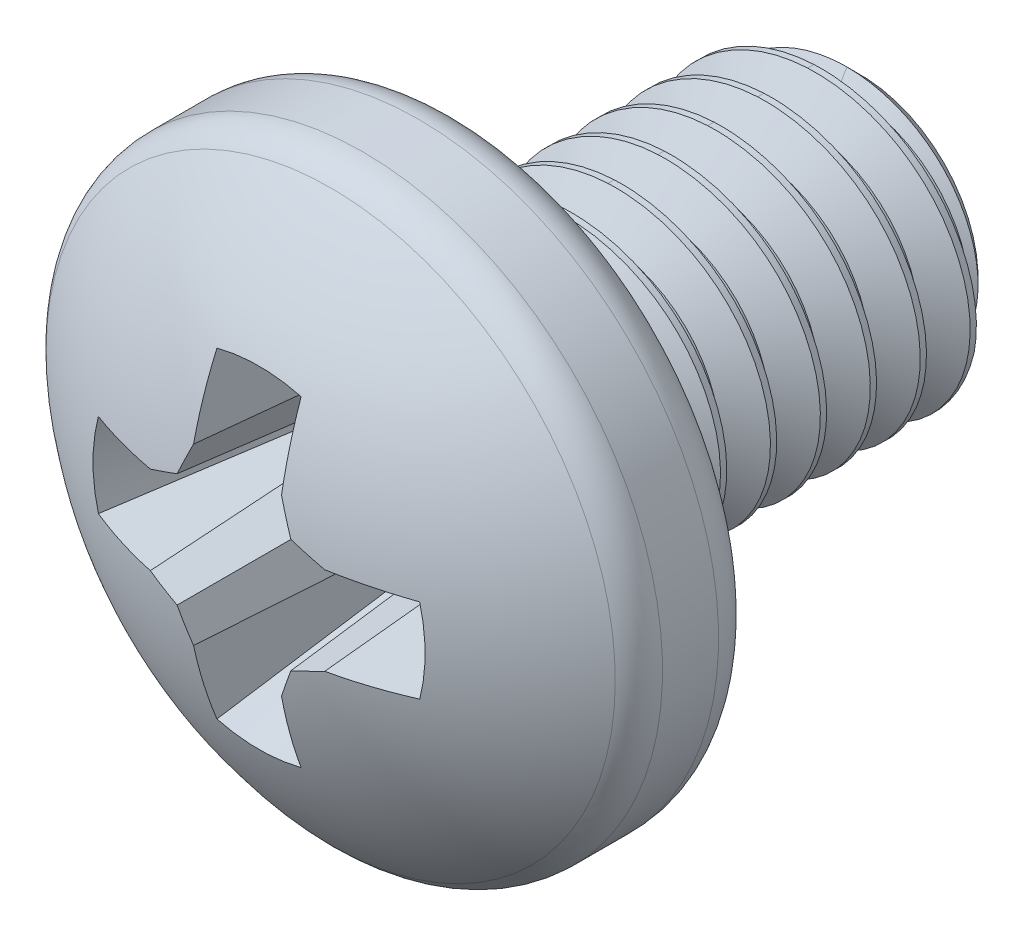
ISO-10303-21;
HEADER;
FILE_DESCRIPTION(('STEP AP214'),'2;1');
FILE_NAME('part.step','',(''),(''),'','','');
FILE_SCHEMA(('AUTOMOTIVE_DESIGN { 1 0 10303 214 1 1 1 1 }'));
ENDSEC;
DATA;
#1=APPLICATION_CONTEXT('core data for automotive mechanical design processes');
#2=APPLICATION_PROTOCOL_DEFINITION('international standard','automotive_design',2000,#1);
#3=PRODUCT_CONTEXT('',#1,'mechanical');
#4=PRODUCT('Part','Part','',(#3));
#5=PRODUCT_RELATED_PRODUCT_CATEGORY('part','',(#4));
#6=PRODUCT_DEFINITION_FORMATION('','',#4);
#7=PRODUCT_DEFINITION_CONTEXT('part definition',#1,'design');
#8=PRODUCT_DEFINITION('design','',#6,#7);
#9=PRODUCT_DEFINITION_SHAPE('','',#8);
#10=(LENGTH_UNIT() NAMED_UNIT(*) SI_UNIT(.MILLI.,.METRE.));
#11=(NAMED_UNIT(*) PLANE_ANGLE_UNIT() SI_UNIT($,.RADIAN.));
#12=(NAMED_UNIT(*) SI_UNIT($,.STERADIAN.) SOLID_ANGLE_UNIT());
#13=UNCERTAINTY_MEASURE_WITH_UNIT(LENGTH_MEASURE(1.E-05),#10,'distance_accuracy_value','');
#14=(GEOMETRIC_REPRESENTATION_CONTEXT(3) GLOBAL_UNCERTAINTY_ASSIGNED_CONTEXT((#13)) GLOBAL_UNIT_ASSIGNED_CONTEXT((#10,
#11,#12)) REPRESENTATION_CONTEXT('',''));
#15=CARTESIAN_POINT('',(0.,0.,0.));
#16=DIRECTION('',(0.,0.,1.));
#17=DIRECTION('',(1.,0.,0.));
#18=AXIS2_PLACEMENT_3D('',#15,#16,#17);
#19=CARTESIAN_POINT('',(0.,0.,0.));
#20=DIRECTION('',(0.,0.,1.));
#21=DIRECTION('',(1.,0.,0.));
#22=AXIS2_PLACEMENT_3D('',#19,#20,#21);
#23=CYLINDRICAL_SURFACE('',#22,3.);
#24=CARTESIAN_POINT('',(0.,3.,-0.0625));
#25=CARTESIAN_POINT('',(-1.73205080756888,3.,0.0208333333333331));
#26=CARTESIAN_POINT('',(-2.59807621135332,1.5,0.104166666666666));
#27=CARTESIAN_POINT('',(-3.46410161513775,0.,0.187499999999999));
#28=CARTESIAN_POINT('',(-2.59807621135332,-1.5,0.270833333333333));
#29=CARTESIAN_POINT('',(-1.73205080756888,-3.,0.354166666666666));
#30=CARTESIAN_POINT('',(0.,-3.,0.437499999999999));
#31=CARTESIAN_POINT('',(1.73205080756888,-3.,0.520833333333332));
#32=CARTESIAN_POINT('',(2.59807621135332,-1.5,0.604166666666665));
#33=CARTESIAN_POINT('',(3.46410161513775,0.,0.687499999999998));
#34=CARTESIAN_POINT('',(2.59807621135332,1.5,0.770833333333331));
#35=CARTESIAN_POINT('',(1.73205080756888,3.,0.854166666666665));
#36=CARTESIAN_POINT('',(0.,3.,0.937499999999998));
#37=CARTESIAN_POINT('',(-1.73205080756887,3.,1.02083333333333));
#38=CARTESIAN_POINT('',(-2.59807621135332,1.5,1.10416666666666));
#39=CARTESIAN_POINT('',(-3.46410161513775,0.,1.1875));
#40=CARTESIAN_POINT('',(-2.59807621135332,-1.5,1.27083333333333));
#41=CARTESIAN_POINT('',(-1.73205080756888,-3.,1.35416666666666));
#42=CARTESIAN_POINT('',(0.,-3.,1.4375));
#43=CARTESIAN_POINT('',(1.73205080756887,-3.,1.52083333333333));
#44=CARTESIAN_POINT('',(2.59807621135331,-1.5,1.60416666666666));
#45=CARTESIAN_POINT('',(3.46410161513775,0.,1.6875));
#46=CARTESIAN_POINT('',(2.59807621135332,1.5,1.77083333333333));
#47=CARTESIAN_POINT('',(1.73205080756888,3.,1.85416666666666));
#48=CARTESIAN_POINT('',(0.,3.,1.9375));
#49=CARTESIAN_POINT('',(-1.73205080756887,3.,2.02083333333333));
#50=CARTESIAN_POINT('',(-2.59807621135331,1.5,2.10416666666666));
#51=CARTESIAN_POINT('',(-3.46410161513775,0.,2.1875));
#52=CARTESIAN_POINT('',(-2.59807621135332,-1.5,2.27083333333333));
#53=CARTESIAN_POINT('',(-1.73205080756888,-3.,2.35416666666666));
#54=CARTESIAN_POINT('',(0.,-3.,2.43749999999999));
#55=CARTESIAN_POINT('',(1.73205080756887,-3.,2.52083333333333));
#56=CARTESIAN_POINT('',(2.59807621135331,-1.50000000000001,2.60416666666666));
#57=CARTESIAN_POINT('',(3.46410161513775,0.,2.68749999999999));
#58=CARTESIAN_POINT('',(2.59807621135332,1.49999999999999,2.77083333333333));
#59=CARTESIAN_POINT('',(1.73205080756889,2.99999999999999,2.85416666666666));
#60=CARTESIAN_POINT('',(0.,3.,2.93749999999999));
#61=CARTESIAN_POINT('',(-1.73205080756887,3.,3.02083333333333));
#62=CARTESIAN_POINT('',(-2.59807621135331,1.50000000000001,3.10416666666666));
#63=CARTESIAN_POINT('',(-3.46410161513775,0.,3.18749999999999));
#64=CARTESIAN_POINT('',(-2.59807621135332,-1.49999999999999,3.27083333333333));
#65=CARTESIAN_POINT('',(-1.73205080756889,-2.99999999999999,3.35416666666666));
#66=CARTESIAN_POINT('',(0.,-3.,3.43749999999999));
#67=CARTESIAN_POINT('',(1.73205080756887,-3.,3.52083333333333));
#68=CARTESIAN_POINT('',(2.59807621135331,-1.50000000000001,3.60416666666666));
#69=CARTESIAN_POINT('',(3.46410161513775,0.,3.68749999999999));
#70=CARTESIAN_POINT('',(2.59807621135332,1.49999999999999,3.77083333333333));
#71=CARTESIAN_POINT('',(1.73205080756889,2.99999999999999,3.85416666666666));
#72=CARTESIAN_POINT('',(0.,3.,3.93749999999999));
#73=CARTESIAN_POINT('',(-1.73205080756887,3.,4.02083333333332));
#74=CARTESIAN_POINT('',(-2.59807621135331,1.50000000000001,4.10416666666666));
#75=CARTESIAN_POINT('',(-3.46410161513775,0.,4.18749999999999));
#76=CARTESIAN_POINT('',(-2.59807621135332,-1.49999999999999,4.27083333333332));
#77=CARTESIAN_POINT('',(-1.73205080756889,-2.99999999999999,4.35416666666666));
#78=CARTESIAN_POINT('',(0.,-3.,4.43749999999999));
#79=CARTESIAN_POINT('',(1.73205080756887,-3.,4.52083333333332));
#80=CARTESIAN_POINT('',(2.59807621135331,-1.50000000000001,4.60416666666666));
#81=CARTESIAN_POINT('',(3.46410161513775,0.,4.68749999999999));
#82=CARTESIAN_POINT('',(2.59807621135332,1.49999999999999,4.77083333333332));
#83=CARTESIAN_POINT('',(1.73205080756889,2.99999999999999,4.85416666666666));
#84=CARTESIAN_POINT('',(0.,3.,4.93749999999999));
#85=CARTESIAN_POINT('',(-1.73205080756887,3.,5.02083333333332));
#86=CARTESIAN_POINT('',(-2.59807621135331,1.50000000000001,5.10416666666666));
#87=CARTESIAN_POINT('',(-3.46410161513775,0.,5.18749999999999));
#88=CARTESIAN_POINT('',(-2.59807621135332,-1.49999999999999,5.27083333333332));
#89=CARTESIAN_POINT('',(-1.73205080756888,-3.,5.35416666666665));
#90=CARTESIAN_POINT('',(0.,-3.,5.43749999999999));
#91=CARTESIAN_POINT('',(1.73205080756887,-3.,5.52083333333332));
#92=CARTESIAN_POINT('',(2.59807621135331,-1.50000000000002,5.60416666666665));
#93=CARTESIAN_POINT('',(3.46410161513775,0.,5.68749999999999));
#94=CARTESIAN_POINT('',(2.59807621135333,1.49999999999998,5.77083333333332));
#95=CARTESIAN_POINT('',(1.73205080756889,2.99999999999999,5.85416666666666));
#96=CARTESIAN_POINT('',(0.,3.,5.93749999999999));
#97=CARTESIAN_POINT('',(-1.73205080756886,3.00000000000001,6.02083333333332));
#98=CARTESIAN_POINT('',(-2.59807621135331,1.50000000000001,6.10416666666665));
#99=CARTESIAN_POINT('',(-3.46410161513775,0.,6.18749999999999));
#100=CARTESIAN_POINT('',(-2.59807621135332,-1.49999999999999,6.27083333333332));
#101=CARTESIAN_POINT('',(-1.73205080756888,-3.,6.35416666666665));
#102=CARTESIAN_POINT('',(0.,-3.,6.43749999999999));
#103=CARTESIAN_POINT('',(1.73205080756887,-3.,6.52083333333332));
#104=CARTESIAN_POINT('',(2.59807621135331,-1.50000000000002,6.60416666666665));
#105=CARTESIAN_POINT('',(3.46410161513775,0.,6.68749999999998));
#106=CARTESIAN_POINT('',(2.59807621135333,1.49999999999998,6.77083333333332));
#107=CARTESIAN_POINT('',(1.73205080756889,2.99999999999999,6.85416666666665));
#108=CARTESIAN_POINT('',(0.,3.,6.93749999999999));
#109=CARTESIAN_POINT('',(-1.73205080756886,3.00000000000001,7.02083333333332));
#110=CARTESIAN_POINT('',(-2.59807621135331,1.50000000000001,7.10416666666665));
#111=CARTESIAN_POINT('',(-3.46410161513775,0.,7.18749999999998));
#112=CARTESIAN_POINT('',(-2.59807621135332,-1.49999999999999,7.27083333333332));
#113=CARTESIAN_POINT('',(-1.7320508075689,-2.99999999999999,7.35416666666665));
#114=CARTESIAN_POINT('',(0.,-3.,7.43749999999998));
#115=CARTESIAN_POINT('',(1.73205080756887,-3.,7.52083333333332));
#116=CARTESIAN_POINT('',(2.59807621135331,-1.50000000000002,7.60416666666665));
#117=CARTESIAN_POINT('',(3.46410161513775,0.,7.68749999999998));
#118=CARTESIAN_POINT('',(2.59807621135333,1.49999999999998,7.77083333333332));
#119=CARTESIAN_POINT('',(1.73205080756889,2.99999999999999,7.85416666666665));
#120=CARTESIAN_POINT('',(0.,3.,7.93749999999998));
#121=CARTESIAN_POINT('',(-1.73205080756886,3.00000000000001,8.02083333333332));
#122=CARTESIAN_POINT('',(-2.59807621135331,1.50000000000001,8.10416666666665));
#123=CARTESIAN_POINT('',(-3.46410161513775,0.,8.18749999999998));
#124=CARTESIAN_POINT('',(-2.59807621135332,-1.49999999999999,8.27083333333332));
#125=CARTESIAN_POINT('',(-1.7320508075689,-2.99999999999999,8.35416666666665));
#126=CARTESIAN_POINT('',(0.,-3.,8.43749999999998));
#127=CARTESIAN_POINT('',(1.73205080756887,-3.00000000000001,8.52083333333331));
#128=CARTESIAN_POINT('',(2.59807621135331,-1.50000000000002,8.60416666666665));
#129=CARTESIAN_POINT('',(3.46410161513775,0.,8.68749999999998));
#130=CARTESIAN_POINT('',(2.59807621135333,1.49999999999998,8.77083333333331));
#131=CARTESIAN_POINT('',(1.73205080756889,2.99999999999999,8.85416666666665));
#132=CARTESIAN_POINT('',(0.,3.,8.93749999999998));
#133=CARTESIAN_POINT('',(-1.73205080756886,3.00000000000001,9.02083333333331));
#134=CARTESIAN_POINT('',(-2.59807621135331,1.50000000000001,9.10416666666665));
#135=CARTESIAN_POINT('',(-3.46410161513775,0.,9.18749999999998));
#136=CARTESIAN_POINT('',(-2.59807621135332,-1.49999999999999,9.27083333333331));
#137=CARTESIAN_POINT('',(-1.7320508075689,-2.99999999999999,9.35416666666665));
#138=CARTESIAN_POINT('',(0.,-3.,9.43749999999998));
#139=CARTESIAN_POINT('',(1.73205080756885,-3.00000000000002,9.52083333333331));
#140=CARTESIAN_POINT('',(2.59807621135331,-1.50000000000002,9.60416666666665));
#141=CARTESIAN_POINT('',(3.46410161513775,0.,9.68749999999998));
#142=CARTESIAN_POINT('',(2.59807621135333,1.49999999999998,9.77083333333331));
#143=CARTESIAN_POINT('',(1.73205080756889,2.99999999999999,9.85416666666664));
#144=CARTESIAN_POINT('',(0.,3.,9.93749999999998));
#145=(BOUNDED_CURVE() B_SPLINE_CURVE(2,(#24,#25,#26,#27,#28,#29,#30,#31,#32,#33,#34,#35,#36,#37,
#38,#39,#40,#41,#42,#43,#44,#45,#46,#47,#48,#49,#50,#51,#52,#53,#54,#55,#56,#57,#58,#59,#60,#61,
#62,#63,#64,#65,#66,#67,#68,#69,#70,#71,#72,#73,#74,#75,#76,#77,#78,#79,#80,#81,#82,#83,#84,#85,
#86,#87,#88,#89,#90,#91,#92,#93,#94,#95,#96,#97,#98,#99,#100,#101,#102,#103,#104,#105,#106,#107,
#108,#109,#110,#111,#112,#113,#114,#115,#116,#117,#118,#119,#120,#121,#122,#123,#124,#125,#126,
#127,#128,#129,#130,#131,#132,#133,#134,#135,#136,#137,#138,#139,#140,#141,#142,#143,#144),
.UNSPECIFIED.,.F.,.F.) B_SPLINE_CURVE_WITH_KNOTS((3,2,2,2,2,2,2,2,2,2,2,2,2,2,2,2,2,2,2,2,2,2,2,
2,2,2,2,2,2,2,2,2,2,2,2,2,2,2,2,2,2,2,2,2,2,2,2,2,2,2,2,2,2,2,2,2,2,2,2,2,3),(0.,
0.0166666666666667,0.0333333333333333,0.05,0.0666666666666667,0.0833333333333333,0.1,
0.116666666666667,0.133333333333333,0.15,0.166666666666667,0.183333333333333,0.2,
0.216666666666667,0.233333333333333,0.25,0.266666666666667,0.283333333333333,0.3,
0.316666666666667,0.333333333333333,0.35,0.366666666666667,0.383333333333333,0.4,
0.416666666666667,0.433333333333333,0.45,0.466666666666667,0.483333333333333,0.5,
0.516666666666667,0.533333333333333,0.55,0.566666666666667,0.583333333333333,0.6,
0.616666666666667,0.633333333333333,0.65,0.666666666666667,0.683333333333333,0.7,
0.716666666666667,0.733333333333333,0.75,0.766666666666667,0.783333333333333,0.8,
0.816666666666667,0.833333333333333,0.85,0.866666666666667,0.883333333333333,0.9,
0.916666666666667,0.933333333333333,0.95,0.966666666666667,0.983333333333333,1.),
.UNSPECIFIED.) CURVE() GEOMETRIC_REPRESENTATION_ITEM() RATIONAL_B_SPLINE_CURVE((1.,
0.866025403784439,1.,0.866025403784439,1.,0.866025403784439,1.,0.866025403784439,1.,
0.866025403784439,1.,0.866025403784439,1.,0.866025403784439,1.,0.866025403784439,1.,
0.866025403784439,1.,0.866025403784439,1.,0.866025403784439,1.,0.866025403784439,1.,
0.866025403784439,1.,0.866025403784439,1.,0.866025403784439,1.,0.866025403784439,1.,
0.866025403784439,1.,0.866025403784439,1.,0.866025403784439,1.,0.866025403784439,1.,
0.866025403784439,1.,0.866025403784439,1.,0.866025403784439,1.,0.866025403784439,1.,
0.866025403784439,1.,0.866025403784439,1.,0.866025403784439,1.,0.866025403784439,1.,
0.866025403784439,1.,0.866025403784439,1.,0.866025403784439,1.,0.866025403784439,1.,
0.866025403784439,1.,0.866025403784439,1.,0.866025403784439,1.,0.866025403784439,1.,
0.866025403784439,1.,0.866025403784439,1.,0.866025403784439,1.,0.866025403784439,1.,
0.866025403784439,1.,0.866025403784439,1.,0.866025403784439,1.,0.866025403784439,1.,
0.866025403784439,1.,0.866025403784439,1.,0.866025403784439,1.,0.866025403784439,1.,
0.866025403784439,1.,0.866025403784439,1.,0.866025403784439,1.,0.866025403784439,1.,
0.866025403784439,1.,0.866025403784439,1.,0.866025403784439,1.,0.866025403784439,1.,
0.866025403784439,1.,0.866025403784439,1.,0.866025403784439,1.,0.866025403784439,1.)) REPRESENTATION_ITEM(''));
#146=CARTESIAN_POINT('',(0.,3.,6.93749999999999));
#147=VERTEX_POINT('',#146);
#148=CARTESIAN_POINT('',(0.,-3.,7.43749999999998));
#149=VERTEX_POINT('',#148);
#150=EDGE_CURVE('E708',#147,#149,#145,.T.);
#151=ORIENTED_EDGE('',*,*,#150,.T.);
#152=DIRECTION('',(0.,0.,1.));
#153=VECTOR('',#152,1.);
#154=CARTESIAN_POINT('',(0.,-3.,0.));
#155=LINE('',#154,#153);
#156=CARTESIAN_POINT('',(0.,-3.,7.56249999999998));
#157=VERTEX_POINT('',#156);
#158=EDGE_CURVE('E11',#149,#157,#155,.T.);
#159=ORIENTED_EDGE('',*,*,#158,.T.);
#160=CARTESIAN_POINT('',(0.,3.,0.0625));
#161=CARTESIAN_POINT('',(-1.73205080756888,3.,0.145833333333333));
#162=CARTESIAN_POINT('',(-2.59807621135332,1.5,0.229166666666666));
#163=CARTESIAN_POINT('',(-3.46410161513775,0.,0.312499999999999));
#164=CARTESIAN_POINT('',(-2.59807621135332,-1.5,0.395833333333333));
#165=CARTESIAN_POINT('',(-1.73205080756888,-3.,0.479166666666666));
#166=CARTESIAN_POINT('',(0.,-3.,0.562499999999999));
#167=CARTESIAN_POINT('',(1.73205080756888,-3.,0.645833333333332));
#168=CARTESIAN_POINT('',(2.59807621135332,-1.5,0.729166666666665));
#169=CARTESIAN_POINT('',(3.46410161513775,0.,0.812499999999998));
#170=CARTESIAN_POINT('',(2.59807621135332,1.5,0.895833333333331));
#171=CARTESIAN_POINT('',(1.73205080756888,3.,0.979166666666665));
#172=CARTESIAN_POINT('',(0.,3.,1.0625));
#173=CARTESIAN_POINT('',(-1.73205080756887,3.,1.14583333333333));
#174=CARTESIAN_POINT('',(-2.59807621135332,1.5,1.22916666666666));
#175=CARTESIAN_POINT('',(-3.46410161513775,0.,1.3125));
#176=CARTESIAN_POINT('',(-2.59807621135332,-1.5,1.39583333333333));
#177=CARTESIAN_POINT('',(-1.73205080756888,-3.,1.47916666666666));
#178=CARTESIAN_POINT('',(0.,-3.,1.5625));
#179=CARTESIAN_POINT('',(1.73205080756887,-3.,1.64583333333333));
#180=CARTESIAN_POINT('',(2.59807621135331,-1.5,1.72916666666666));
#181=CARTESIAN_POINT('',(3.46410161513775,0.,1.8125));
#182=CARTESIAN_POINT('',(2.59807621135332,1.5,1.89583333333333));
#183=CARTESIAN_POINT('',(1.73205080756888,3.,1.97916666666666));
#184=CARTESIAN_POINT('',(0.,3.,2.0625));
#185=CARTESIAN_POINT('',(-1.73205080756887,3.,2.14583333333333));
#186=CARTESIAN_POINT('',(-2.59807621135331,1.5,2.22916666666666));
#187=CARTESIAN_POINT('',(-3.46410161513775,0.,2.3125));
#188=CARTESIAN_POINT('',(-2.59807621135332,-1.5,2.39583333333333));
#189=CARTESIAN_POINT('',(-1.73205080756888,-3.,2.47916666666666));
#190=CARTESIAN_POINT('',(0.,-3.,2.56249999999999));
#191=CARTESIAN_POINT('',(1.73205080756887,-3.,2.64583333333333));
#192=CARTESIAN_POINT('',(2.59807621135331,-1.50000000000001,2.72916666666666));
#193=CARTESIAN_POINT('',(3.46410161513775,0.,2.81249999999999));
#194=CARTESIAN_POINT('',(2.59807621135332,1.49999999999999,2.89583333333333));
#195=CARTESIAN_POINT('',(1.73205080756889,2.99999999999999,2.97916666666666));
#196=CARTESIAN_POINT('',(0.,3.,3.06249999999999));
#197=CARTESIAN_POINT('',(-1.73205080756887,3.,3.14583333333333));
#198=CARTESIAN_POINT('',(-2.59807621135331,1.50000000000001,3.22916666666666));
#199=CARTESIAN_POINT('',(-3.46410161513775,0.,3.31249999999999));
#200=CARTESIAN_POINT('',(-2.59807621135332,-1.49999999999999,3.39583333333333));
#201=CARTESIAN_POINT('',(-1.73205080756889,-2.99999999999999,3.47916666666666));
#202=CARTESIAN_POINT('',(0.,-3.,3.56249999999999));
#203=CARTESIAN_POINT('',(1.73205080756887,-3.,3.64583333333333));
#204=CARTESIAN_POINT('',(2.59807621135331,-1.50000000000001,3.72916666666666));
#205=CARTESIAN_POINT('',(3.46410161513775,0.,3.81249999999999));
#206=CARTESIAN_POINT('',(2.59807621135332,1.49999999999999,3.89583333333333));
#207=CARTESIAN_POINT('',(1.73205080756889,2.99999999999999,3.97916666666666));
#208=CARTESIAN_POINT('',(0.,3.,4.06249999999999));
#209=CARTESIAN_POINT('',(-1.73205080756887,3.,4.14583333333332));
#210=CARTESIAN_POINT('',(-2.59807621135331,1.50000000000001,4.22916666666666));
#211=CARTESIAN_POINT('',(-3.46410161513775,0.,4.31249999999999));
#212=CARTESIAN_POINT('',(-2.59807621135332,-1.49999999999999,4.39583333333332));
#213=CARTESIAN_POINT('',(-1.73205080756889,-2.99999999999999,4.47916666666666));
#214=CARTESIAN_POINT('',(0.,-3.,4.56249999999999));
#215=CARTESIAN_POINT('',(1.73205080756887,-3.,4.64583333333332));
#216=CARTESIAN_POINT('',(2.59807621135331,-1.50000000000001,4.72916666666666));
#217=CARTESIAN_POINT('',(3.46410161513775,0.,4.81249999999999));
#218=CARTESIAN_POINT('',(2.59807621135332,1.49999999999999,4.89583333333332));
#219=CARTESIAN_POINT('',(1.73205080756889,2.99999999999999,4.97916666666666));
#220=CARTESIAN_POINT('',(0.,3.,5.06249999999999));
#221=CARTESIAN_POINT('',(-1.73205080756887,3.,5.14583333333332));
#222=CARTESIAN_POINT('',(-2.59807621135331,1.50000000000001,5.22916666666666));
#223=CARTESIAN_POINT('',(-3.46410161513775,0.,5.31249999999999));
#224=CARTESIAN_POINT('',(-2.59807621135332,-1.49999999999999,5.39583333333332));
#225=CARTESIAN_POINT('',(-1.73205080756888,-3.,5.47916666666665));
#226=CARTESIAN_POINT('',(0.,-3.,5.56249999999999));
#227=CARTESIAN_POINT('',(1.73205080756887,-3.,5.64583333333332));
#228=CARTESIAN_POINT('',(2.59807621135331,-1.50000000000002,5.72916666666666));
#229=CARTESIAN_POINT('',(3.46410161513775,0.,5.81249999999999));
#230=CARTESIAN_POINT('',(2.59807621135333,1.49999999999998,5.89583333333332));
#231=CARTESIAN_POINT('',(1.73205080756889,2.99999999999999,5.97916666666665));
#232=CARTESIAN_POINT('',(0.,3.,6.06249999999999));
#233=CARTESIAN_POINT('',(-1.73205080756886,3.00000000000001,6.14583333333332));
#234=CARTESIAN_POINT('',(-2.59807621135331,1.50000000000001,6.22916666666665));
#235=CARTESIAN_POINT('',(-3.46410161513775,0.,6.31249999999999));
#236=CARTESIAN_POINT('',(-2.59807621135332,-1.49999999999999,6.39583333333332));
#237=CARTESIAN_POINT('',(-1.73205080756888,-3.,6.47916666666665));
#238=CARTESIAN_POINT('',(0.,-3.,6.56249999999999));
#239=CARTESIAN_POINT('',(1.73205080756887,-3.,6.64583333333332));
#240=CARTESIAN_POINT('',(2.59807621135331,-1.50000000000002,6.72916666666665));
#241=CARTESIAN_POINT('',(3.46410161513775,0.,6.81249999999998));
#242=CARTESIAN_POINT('',(2.59807621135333,1.49999999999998,6.89583333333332));
#243=CARTESIAN_POINT('',(1.73205080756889,2.99999999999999,6.97916666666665));
#244=CARTESIAN_POINT('',(0.,3.,7.06249999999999));
#245=CARTESIAN_POINT('',(-1.73205080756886,3.00000000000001,7.14583333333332));
#246=CARTESIAN_POINT('',(-2.59807621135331,1.50000000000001,7.22916666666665));
#247=CARTESIAN_POINT('',(-3.46410161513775,0.,7.31249999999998));
#248=CARTESIAN_POINT('',(-2.59807621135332,-1.49999999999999,7.39583333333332));
#249=CARTESIAN_POINT('',(-1.7320508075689,-2.99999999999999,7.47916666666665));
#250=CARTESIAN_POINT('',(0.,-3.,7.56249999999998));
#251=CARTESIAN_POINT('',(1.73205080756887,-3.,7.64583333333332));
#252=CARTESIAN_POINT('',(2.59807621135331,-1.50000000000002,7.72916666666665));
#253=CARTESIAN_POINT('',(3.46410161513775,0.,7.81249999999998));
#254=CARTESIAN_POINT('',(2.59807621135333,1.49999999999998,7.89583333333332));
#255=CARTESIAN_POINT('',(1.73205080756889,2.99999999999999,7.97916666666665));
#256=CARTESIAN_POINT('',(0.,3.,8.06249999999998));
#257=CARTESIAN_POINT('',(-1.73205080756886,3.00000000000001,8.14583333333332));
#258=CARTESIAN_POINT('',(-2.59807621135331,1.50000000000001,8.22916666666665));
#259=CARTESIAN_POINT('',(-3.46410161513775,0.,8.31249999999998));
#260=CARTESIAN_POINT('',(-2.59807621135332,-1.49999999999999,8.39583333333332));
#261=CARTESIAN_POINT('',(-1.7320508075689,-2.99999999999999,8.47916666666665));
#262=CARTESIAN_POINT('',(0.,-3.,8.56249999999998));
#263=CARTESIAN_POINT('',(1.73205080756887,-3.00000000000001,8.64583333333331));
#264=CARTESIAN_POINT('',(2.59807621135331,-1.50000000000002,8.72916666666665));
#265=CARTESIAN_POINT('',(3.46410161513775,0.,8.81249999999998));
#266=CARTESIAN_POINT('',(2.59807621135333,1.49999999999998,8.89583333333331));
#267=CARTESIAN_POINT('',(1.73205080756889,2.99999999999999,8.97916666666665));
#268=CARTESIAN_POINT('',(0.,3.,9.06249999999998));
#269=CARTESIAN_POINT('',(-1.73205080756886,3.00000000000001,9.14583333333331));
#270=CARTESIAN_POINT('',(-2.59807621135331,1.50000000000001,9.22916666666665));
#271=CARTESIAN_POINT('',(-3.46410161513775,0.,9.31249999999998));
#272=CARTESIAN_POINT('',(-2.59807621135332,-1.49999999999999,9.39583333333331));
#273=CARTESIAN_POINT('',(-1.7320508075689,-2.99999999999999,9.47916666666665));
#274=CARTESIAN_POINT('',(0.,-3.,9.56249999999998));
#275=CARTESIAN_POINT('',(1.73205080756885,-3.00000000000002,9.64583333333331));
#276=CARTESIAN_POINT('',(2.59807621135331,-1.50000000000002,9.72916666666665));
#277=CARTESIAN_POINT('',(3.46410161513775,0.,9.81249999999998));
#278=CARTESIAN_POINT('',(2.59807621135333,1.49999999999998,9.89583333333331));
#279=CARTESIAN_POINT('',(1.73205080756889,2.99999999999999,9.97916666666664));
#280=CARTESIAN_POINT('',(0.,3.,10.0625));
#281=(BOUNDED_CURVE() B_SPLINE_CURVE(2,(#160,#161,#162,#163,#164,#165,#166,#167,#168,#169,#170,
#171,#172,#173,#174,#175,#176,#177,#178,#179,#180,#181,#182,#183,#184,#185,#186,#187,#188,#189,
#190,#191,#192,#193,#194,#195,#196,#197,#198,#199,#200,#201,#202,#203,#204,#205,#206,#207,#208,
#209,#210,#211,#212,#213,#214,#215,#216,#217,#218,#219,#220,#221,#222,#223,#224,#225,#226,#227,
#228,#229,#230,#231,#232,#233,#234,#235,#236,#237,#238,#239,#240,#241,#242,#243,#244,#245,#246,
#247,#248,#249,#250,#251,#252,#253,#254,#255,#256,#257,#258,#259,#260,#261,#262,#263,#264,#265,
#266,#267,#268,#269,#270,#271,#272,#273,#274,#275,#276,#277,#278,#279,#280),.UNSPECIFIED.,.F.,
.F.) B_SPLINE_CURVE_WITH_KNOTS((3,2,2,2,2,2,2,2,2,2,2,2,2,2,2,2,2,2,2,2,2,2,2,2,2,2,2,2,2,2,2,2,
2,2,2,2,2,2,2,2,2,2,2,2,2,2,2,2,2,2,2,2,2,2,2,2,2,2,2,2,3),(0.,0.0166666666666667,
0.0333333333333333,0.05,0.0666666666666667,0.0833333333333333,0.1,0.116666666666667,
0.133333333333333,0.15,0.166666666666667,0.183333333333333,0.2,0.216666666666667,
0.233333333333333,0.25,0.266666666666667,0.283333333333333,0.3,0.316666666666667,
0.333333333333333,0.35,0.366666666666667,0.383333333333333,0.4,0.416666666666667,
0.433333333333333,0.45,0.466666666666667,0.483333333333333,0.5,0.516666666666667,
0.533333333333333,0.55,0.566666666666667,0.583333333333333,0.6,0.616666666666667,
0.633333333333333,0.65,0.666666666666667,0.683333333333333,0.7,0.716666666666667,
0.733333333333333,0.75,0.766666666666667,0.783333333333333,0.8,0.816666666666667,
0.833333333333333,0.85,0.866666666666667,0.883333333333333,0.9,0.916666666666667,
0.933333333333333,0.95,0.966666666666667,0.983333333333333,1.),
.UNSPECIFIED.) CURVE() GEOMETRIC_REPRESENTATION_ITEM() RATIONAL_B_SPLINE_CURVE((1.,
0.866025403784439,1.,0.866025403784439,1.,0.866025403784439,1.,0.866025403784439,1.,
0.866025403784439,1.,0.866025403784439,1.,0.866025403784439,1.,0.866025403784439,1.,
0.866025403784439,1.,0.866025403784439,1.,0.866025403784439,1.,0.866025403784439,1.,
0.866025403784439,1.,0.866025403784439,1.,0.866025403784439,1.,0.866025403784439,1.,
0.866025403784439,1.,0.866025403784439,1.,0.866025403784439,1.,0.866025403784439,1.,
0.866025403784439,1.,0.866025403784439,1.,0.866025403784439,1.,0.866025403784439,1.,
0.866025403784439,1.,0.866025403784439,1.,0.866025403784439,1.,0.866025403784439,1.,
0.866025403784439,1.,0.866025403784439,1.,0.866025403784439,1.,0.866025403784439,1.,
0.866025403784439,1.,0.866025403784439,1.,0.866025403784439,1.,0.866025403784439,1.,
0.866025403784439,1.,0.866025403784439,1.,0.866025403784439,1.,0.866025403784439,1.,
0.866025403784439,1.,0.866025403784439,1.,0.866025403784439,1.,0.866025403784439,1.,
0.866025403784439,1.,0.866025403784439,1.,0.866025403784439,1.,0.866025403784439,1.,
0.866025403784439,1.,0.866025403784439,1.,0.866025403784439,1.,0.866025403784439,1.,
0.866025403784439,1.,0.866025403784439,1.,0.866025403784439,1.,0.866025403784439,1.,
0.866025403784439,1.,0.866025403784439,1.,0.866025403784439,1.,0.866025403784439,1.)) REPRESENTATION_ITEM(''));
#282=CARTESIAN_POINT('',(0.,3.,7.06249999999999));
#283=VERTEX_POINT('',#282);
#284=EDGE_CURVE('E760',#283,#157,#281,.T.);
#285=ORIENTED_EDGE('',*,*,#284,.F.);
#286=DIRECTION('',(0.,0.,-1.));
#287=VECTOR('',#286,1.);
#288=CARTESIAN_POINT('',(0.,3.,0.));
#289=LINE('',#288,#287);
#290=EDGE_CURVE('E630',#283,#147,#289,.T.);
#291=ORIENTED_EDGE('',*,*,#290,.T.);
#292=EDGE_LOOP('',(#151,#159,#285,#291));
#293=FACE_BOUND('',#292,.T.);
#294=ADVANCED_FACE('F37',(#293),#23,.T.);
#295=CARTESIAN_POINT('',(0.,3.,5.93749999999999));
#296=VERTEX_POINT('',#295);
#297=CARTESIAN_POINT('',(0.,-3.,6.43749999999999));
#298=VERTEX_POINT('',#297);
#299=EDGE_CURVE('E706',#296,#298,#145,.T.);
#300=ORIENTED_EDGE('',*,*,#299,.T.);
#301=CARTESIAN_POINT('',(0.,-3.,6.56249999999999));
#302=VERTEX_POINT('',#301);
#303=EDGE_CURVE('E47',#298,#302,#155,.T.);
#304=ORIENTED_EDGE('',*,*,#303,.T.);
#305=CARTESIAN_POINT('',(0.,3.,6.06249999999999));
#306=VERTEX_POINT('',#305);
#307=EDGE_CURVE('E762',#306,#302,#281,.T.);
#308=ORIENTED_EDGE('',*,*,#307,.F.);
#309=EDGE_CURVE('E639',#306,#296,#289,.T.);
#310=ORIENTED_EDGE('',*,*,#309,.T.);
#311=EDGE_LOOP('',(#300,#304,#308,#310));
#312=FACE_BOUND('',#311,.T.);
#313=ADVANCED_FACE('F792',(#312),#23,.T.);
#314=CARTESIAN_POINT('',(0.,3.,4.93749999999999));
#315=VERTEX_POINT('',#314);
#316=CARTESIAN_POINT('',(0.,-3.,5.43749999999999));
#317=VERTEX_POINT('',#316);
#318=EDGE_CURVE('E704',#315,#317,#145,.T.);
#319=ORIENTED_EDGE('',*,*,#318,.T.);
#320=CARTESIAN_POINT('',(0.,-3.,5.56249999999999));
#321=VERTEX_POINT('',#320);
#322=EDGE_CURVE('E1147',#317,#321,#155,.T.);
#323=ORIENTED_EDGE('',*,*,#322,.T.);
#324=CARTESIAN_POINT('',(0.,3.,5.06249999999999));
#325=VERTEX_POINT('',#324);
#326=EDGE_CURVE('E766',#325,#321,#281,.T.);
#327=ORIENTED_EDGE('',*,*,#326,.F.);
#328=EDGE_CURVE('E647',#325,#315,#289,.T.);
#329=ORIENTED_EDGE('',*,*,#328,.T.);
#330=EDGE_LOOP('',(#319,#323,#327,#329));
#331=FACE_BOUND('',#330,.T.);
#332=ADVANCED_FACE('F796',(#331),#23,.T.);
#333=CARTESIAN_POINT('',(0.,3.,3.93749999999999));
#334=VERTEX_POINT('',#333);
#335=CARTESIAN_POINT('',(0.,-3.,4.43749999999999));
#336=VERTEX_POINT('',#335);
#337=EDGE_CURVE('E701',#334,#336,#145,.T.);
#338=ORIENTED_EDGE('',*,*,#337,.T.);
#339=CARTESIAN_POINT('',(0.,-3.,4.56249999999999));
#340=VERTEX_POINT('',#339);
#341=EDGE_CURVE('E1150',#336,#340,#155,.T.);
#342=ORIENTED_EDGE('',*,*,#341,.T.);
#343=CARTESIAN_POINT('',(0.,3.,4.06249999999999));
#344=VERTEX_POINT('',#343);
#345=EDGE_CURVE('E770',#344,#340,#281,.T.);
#346=ORIENTED_EDGE('',*,*,#345,.F.);
#347=EDGE_CURVE('E658',#344,#334,#289,.T.);
#348=ORIENTED_EDGE('',*,*,#347,.T.);
#349=EDGE_LOOP('',(#338,#342,#346,#348));
#350=FACE_BOUND('',#349,.T.);
#351=ADVANCED_FACE('F895',(#350),#23,.T.);
#352=CARTESIAN_POINT('',(0.,3.,2.93749999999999));
#353=VERTEX_POINT('',#352);
#354=CARTESIAN_POINT('',(0.,-3.,3.43749999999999));
#355=VERTEX_POINT('',#354);
#356=EDGE_CURVE('E688',#353,#355,#145,.T.);
#357=ORIENTED_EDGE('',*,*,#356,.T.);
#358=CARTESIAN_POINT('',(0.,-3.,3.56249999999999));
#359=VERTEX_POINT('',#358);
#360=EDGE_CURVE('E781',#355,#359,#155,.T.);
#361=ORIENTED_EDGE('',*,*,#360,.T.);
#362=CARTESIAN_POINT('',(0.,3.,3.06249999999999));
#363=VERTEX_POINT('',#362);
#364=EDGE_CURVE('E690',#363,#359,#281,.T.);
#365=ORIENTED_EDGE('',*,*,#364,.F.);
#366=EDGE_CURVE('E625',#363,#353,#289,.T.);
#367=ORIENTED_EDGE('',*,*,#366,.T.);
#368=EDGE_LOOP('',(#357,#361,#365,#367));
#369=FACE_BOUND('',#368,.T.);
#370=ADVANCED_FACE('F687',(#369),#23,.T.);
#371=CARTESIAN_POINT('',(0.,3.,1.9375));
#372=VERTEX_POINT('',#371);
#373=CARTESIAN_POINT('',(0.,-3.,2.43749999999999));
#374=VERTEX_POINT('',#373);
#375=EDGE_CURVE('E700',#372,#374,#145,.T.);
#376=ORIENTED_EDGE('',*,*,#375,.T.);
#377=CARTESIAN_POINT('',(0.,-3.,2.56249999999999));
#378=VERTEX_POINT('',#377);
#379=EDGE_CURVE('E636',#374,#378,#155,.T.);
#380=ORIENTED_EDGE('',*,*,#379,.T.);
#381=CARTESIAN_POINT('',(0.,3.,2.0625));
#382=VERTEX_POINT('',#381);
#383=EDGE_CURVE('E759',#382,#378,#281,.T.);
#384=ORIENTED_EDGE('',*,*,#383,.F.);
#385=EDGE_CURVE('E614',#382,#372,#289,.T.);
#386=ORIENTED_EDGE('',*,*,#385,.T.);
#387=EDGE_LOOP('',(#376,#380,#384,#386));
#388=FACE_BOUND('',#387,.T.);
#389=ADVANCED_FACE('F780',(#388),#23,.T.);
#390=CARTESIAN_POINT('',(0.,3.,0.937499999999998));
#391=VERTEX_POINT('',#390);
#392=CARTESIAN_POINT('',(0.,-3.,1.4375));
#393=VERTEX_POINT('',#392);
#394=EDGE_CURVE('E330',#391,#393,#145,.T.);
#395=ORIENTED_EDGE('',*,*,#394,.T.);
#396=CARTESIAN_POINT('',(0.,-3.,1.5625));
#397=VERTEX_POINT('',#396);
#398=EDGE_CURVE('E41',#393,#397,#155,.T.);
#399=ORIENTED_EDGE('',*,*,#398,.T.);
#400=CARTESIAN_POINT('',(0.,3.,1.0625));
#401=VERTEX_POINT('',#400);
#402=EDGE_CURVE('E746',#401,#397,#281,.T.);
#403=ORIENTED_EDGE('',*,*,#402,.F.);
#404=EDGE_CURVE('E612',#401,#391,#289,.T.);
#405=ORIENTED_EDGE('',*,*,#404,.T.);
#406=EDGE_LOOP('',(#395,#399,#403,#405));
#407=FACE_BOUND('',#406,.T.);
#408=ADVANCED_FACE('F713',(#407),#23,.T.);
#409=CARTESIAN_POINT('',(0.,0.,8.));
#410=DIRECTION('',(0.,0.,1.));
#411=DIRECTION('',(1.,0.,0.));
#412=AXIS2_PLACEMENT_3D('',#409,#410,#411);
#413=CIRCLE('',#412,3.);
#414=CARTESIAN_POINT('',(0.,3.,8.));
#415=VERTEX_POINT('',#414);
#416=CARTESIAN_POINT('',(-1.16347558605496,2.76519882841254,8.));
#417=VERTEX_POINT('',#416);
#418=EDGE_CURVE('E317',#415,#417,#413,.T.);
#419=ORIENTED_EDGE('',*,*,#418,.F.);
#420=CARTESIAN_POINT('',(0.,3.,7.93749999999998));
#421=VERTEX_POINT('',#420);
#422=EDGE_CURVE('E615',#415,#421,#289,.T.);
#423=ORIENTED_EDGE('',*,*,#422,.T.);
#424=EDGE_CURVE('E709',#421,#417,#145,.T.);
#425=ORIENTED_EDGE('',*,*,#424,.T.);
#426=EDGE_LOOP('',(#419,#423,#425));
#427=FACE_BOUND('',#426,.T.);
#428=ADVANCED_FACE('F866',(#427),#23,.T.);
#429=ORIENTED_EDGE('',*,*,#158,.F.);
#430=EDGE_CURVE('E332',#149,#421,#145,.T.);
#431=ORIENTED_EDGE('',*,*,#430,.T.);
#432=ORIENTED_EDGE('',*,*,#422,.F.);
#433=CARTESIAN_POINT('',(1.16347558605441,2.76519882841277,8.));
#434=VERTEX_POINT('',#433);
#435=EDGE_CURVE('E374',#434,#415,#413,.T.);
#436=ORIENTED_EDGE('',*,*,#435,.F.);
#437=EDGE_CURVE('E313',#157,#434,#281,.T.);
#438=ORIENTED_EDGE('',*,*,#437,.F.);
#439=EDGE_LOOP('',(#429,#431,#432,#436,#438));
#440=FACE_BOUND('',#439,.T.);
#441=ADVANCED_FACE('F857',(#440),#23,.T.);
#442=ORIENTED_EDGE('',*,*,#303,.F.);
#443=EDGE_CURVE('E707',#298,#147,#145,.T.);
#444=ORIENTED_EDGE('',*,*,#443,.T.);
#445=ORIENTED_EDGE('',*,*,#290,.F.);
#446=EDGE_CURVE('E761',#302,#283,#281,.T.);
#447=ORIENTED_EDGE('',*,*,#446,.F.);
#448=EDGE_LOOP('',(#442,#444,#445,#447));
#449=FACE_BOUND('',#448,.T.);
#450=ADVANCED_FACE('F848',(#449),#23,.T.);
#451=ORIENTED_EDGE('',*,*,#322,.F.);
#452=EDGE_CURVE('E705',#317,#296,#145,.T.);
#453=ORIENTED_EDGE('',*,*,#452,.T.);
#454=ORIENTED_EDGE('',*,*,#309,.F.);
#455=EDGE_CURVE('E763',#321,#306,#281,.T.);
#456=ORIENTED_EDGE('',*,*,#455,.F.);
#457=EDGE_LOOP('',(#451,#453,#454,#456));
#458=FACE_BOUND('',#457,.T.);
#459=ADVANCED_FACE('F839',(#458),#23,.T.);
#460=ORIENTED_EDGE('',*,*,#341,.F.);
#461=EDGE_CURVE('E703',#336,#315,#145,.T.);
#462=ORIENTED_EDGE('',*,*,#461,.T.);
#463=ORIENTED_EDGE('',*,*,#328,.F.);
#464=EDGE_CURVE('E767',#340,#325,#281,.T.);
#465=ORIENTED_EDGE('',*,*,#464,.F.);
#466=EDGE_LOOP('',(#460,#462,#463,#465));
#467=FACE_BOUND('',#466,.T.);
#468=ADVANCED_FACE('F789',(#467),#23,.T.);
#469=ORIENTED_EDGE('',*,*,#360,.F.);
#470=EDGE_CURVE('E699',#355,#334,#145,.T.);
#471=ORIENTED_EDGE('',*,*,#470,.T.);
#472=ORIENTED_EDGE('',*,*,#347,.F.);
#473=EDGE_CURVE('E771',#359,#344,#281,.T.);
#474=ORIENTED_EDGE('',*,*,#473,.F.);
#475=EDGE_LOOP('',(#469,#471,#472,#474));
#476=FACE_BOUND('',#475,.T.);
#477=ADVANCED_FACE('F784',(#476),#23,.T.);
#478=ORIENTED_EDGE('',*,*,#379,.F.);
#479=EDGE_CURVE('E697',#374,#353,#145,.T.);
#480=ORIENTED_EDGE('',*,*,#479,.T.);
#481=ORIENTED_EDGE('',*,*,#366,.F.);
#482=EDGE_CURVE('E774',#378,#363,#281,.T.);
#483=ORIENTED_EDGE('',*,*,#482,.F.);
#484=EDGE_LOOP('',(#478,#480,#481,#483));
#485=FACE_BOUND('',#484,.T.);
#486=ADVANCED_FACE('F782',(#485),#23,.T.);
#487=ORIENTED_EDGE('',*,*,#398,.F.);
#488=EDGE_CURVE('E702',#393,#372,#145,.T.);
#489=ORIENTED_EDGE('',*,*,#488,.T.);
#490=ORIENTED_EDGE('',*,*,#385,.F.);
#491=EDGE_CURVE('E758',#397,#382,#281,.T.);
#492=ORIENTED_EDGE('',*,*,#491,.F.);
#493=EDGE_LOOP('',(#487,#489,#490,#492));
#494=FACE_BOUND('',#493,.T.);
#495=ADVANCED_FACE('F778',(#494),#23,.T.);
#496=CARTESIAN_POINT('',(0.,0.,8.));
#497=DIRECTION('',(0.,0.,-1.));
#498=DIRECTION('',(-1.,0.,0.));
#499=AXIS2_PLACEMENT_3D('',#496,#497,#498);
#500=PLANE('',#499);
#501=ORIENTED_EDGE('',*,*,#435,.T.);
#502=ORIENTED_EDGE('',*,*,#418,.T.);
#503=CARTESIAN_POINT('',(-1.16347558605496,2.76519882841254,8.));
#504=CARTESIAN_POINT('',(-1.22584479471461,2.73165222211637,8.));
#505=CARTESIAN_POINT('',(-1.28697950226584,2.69587868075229,8.));
#506=CARTESIAN_POINT('',(-1.40653484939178,2.62002124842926,8.));
#507=CARTESIAN_POINT('',(-1.46495480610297,2.57993628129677,8.));
#508=CARTESIAN_POINT('',(-1.63579344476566,2.45340864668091,8.));
#509=CARTESIAN_POINT('',(-1.74371942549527,2.36073171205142,8.));
#510=CARTESIAN_POINT('',(-1.90322572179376,2.20243828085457,8.));
#511=CARTESIAN_POINT('',(-1.95960782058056,2.14154415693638,8.));
#512=CARTESIAN_POINT('',(-2.06706964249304,2.01519945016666,8.));
#513=CARTESIAN_POINT('',(-2.11814856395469,1.94974818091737,8.));
#514=CARTESIAN_POINT('',(-2.21461407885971,1.8147777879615,8.));
#515=CARTESIAN_POINT('',(-2.26000013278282,1.74525827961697,8.));
#516=CARTESIAN_POINT('',(-2.34476454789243,1.60263754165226,8.));
#517=CARTESIAN_POINT('',(-2.38414296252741,1.52953634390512,8.));
#518=CARTESIAN_POINT('',(-2.43859488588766,1.41741326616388,8.));
#519=CARTESIAN_POINT('',(-2.45601824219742,1.37951807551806,8.));
#520=CARTESIAN_POINT('',(-2.48904933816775,1.30294537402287,8.));
#521=CARTESIAN_POINT('',(-2.50465717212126,1.2642679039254,8.));
#522=CARTESIAN_POINT('',(-2.54873964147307,1.14721627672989,8.));
#523=CARTESIAN_POINT('',(-2.57448639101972,1.06779592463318,8.));
#524=CARTESIAN_POINT('',(-2.61840170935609,0.906972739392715,8.));
#525=CARTESIAN_POINT('',(-2.63657725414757,0.825571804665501,8.));
#526=CARTESIAN_POINT('',(-2.66523252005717,0.661439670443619,8.));
#527=CARTESIAN_POINT('',(-2.67571186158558,0.578708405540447,8.));
#528=CARTESIAN_POINT('',(-2.69417742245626,0.345389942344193,8.));
#529=CARTESIAN_POINT('',(-2.69330014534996,0.194012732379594,8.));
#530=CARTESIAN_POINT('',(-2.66589354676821,-0.106492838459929,8.));
#531=CARTESIAN_POINT('',(-2.63935084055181,-0.255619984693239,8.));
#532=CARTESIAN_POINT('',(-2.58111822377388,-0.473588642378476,8.));
#533=CARTESIAN_POINT('',(-2.5587542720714,-0.545036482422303,8.));
#534=CARTESIAN_POINT('',(-2.50808065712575,-0.68581376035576,8.));
#535=CARTESIAN_POINT('',(-2.47977089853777,-0.755143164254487,8.));
#536=CARTESIAN_POINT('',(-2.41743020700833,-0.891142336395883,8.));
#537=CARTESIAN_POINT('',(-2.38340135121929,-0.957813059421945,8.));
#538=CARTESIAN_POINT('',(-2.30983510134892,-1.08805684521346,8.));
#539=CARTESIAN_POINT('',(-2.27029742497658,-1.15162974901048,8.));
#540=CARTESIAN_POINT('',(-2.20701677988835,-1.244522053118,8.));
#541=CARTESIAN_POINT('',(-2.18519052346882,-1.27516172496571,8.));
#542=CARTESIAN_POINT('',(-2.14010929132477,-1.33537017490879,8.));
#543=CARTESIAN_POINT('',(-2.11685440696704,-1.36493902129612,8.));
#544=CARTESIAN_POINT('',(-2.0450369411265,-1.4519349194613,8.));
#545=CARTESIAN_POINT('',(-1.9944049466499,-1.5076758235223,8.));
#546=CARTESIAN_POINT('',(-1.88813722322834,-1.61406409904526,8.));
#547=CARTESIAN_POINT('',(-1.83250516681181,-1.66471515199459,8.));
#548=CARTESIAN_POINT('',(-1.71668516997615,-1.76052500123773,8.));
#549=CARTESIAN_POINT('',(-1.6564971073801,-1.80568365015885,8.));
#550=CARTESIAN_POINT('',(-1.54217581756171,-1.88325887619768,8.));
#551=CARTESIAN_POINT('',(-1.48863658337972,-1.91655518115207,8.));
#552=CARTESIAN_POINT('',(-1.37908806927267,-1.9787748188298,8.));
#553=CARTESIAN_POINT('',(-1.32307938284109,-2.0076991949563,8.));
#554=CARTESIAN_POINT('',(-1.20883046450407,-2.06104329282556,8.));
#555=CARTESIAN_POINT('',(-1.15058628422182,-2.08545455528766,8.));
#556=CARTESIAN_POINT('',(-1.03231846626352,-2.12956261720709,8.));
#557=CARTESIAN_POINT('',(-0.972294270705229,-2.14925792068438,8.));
#558=CARTESIAN_POINT('',(-0.911575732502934,-2.16651572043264,8.));
#559=B_SPLINE_CURVE_WITH_KNOTS('',3,(#503,#504,#505,#506,#507,#508,#509,#510,#511,#512,#513,
#514,#515,#516,#517,#518,#519,#520,#521,#522,#523,#524,#525,#526,#527,#528,#529,#530,#531,#532,
#533,#534,#535,#536,#537,#538,#539,#540,#541,#542,#543,#544,#545,#546,#547,#548,#549,#550,#551,
#552,#553,#554,#555,#556,#557,#558),.UNSPECIFIED.,.F.,.F.,(4,2,2,2,2,2,2,2,2,2,2,2,2,2,2,2,2,2,
2,2,2,2,2,2,2,2,2,4),(0.,0.212345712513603,0.424744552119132,0.849783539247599,1.09850664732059,
1.34726729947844,1.59605150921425,1.84483350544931,1.96992278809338,2.09500557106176,
2.34508146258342,2.59492642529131,2.84478370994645,3.29662171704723,3.7486954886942,
3.97307297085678,4.19745405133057,4.4217538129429,4.64606507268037,4.75888867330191,
4.87170506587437,5.09724944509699,5.32262949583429,5.54801559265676,5.73696803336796,
5.92587530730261,6.11513315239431,6.30445095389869),.UNSPECIFIED.);
#560=CARTESIAN_POINT('',(-0.911575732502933,-2.16651572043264,8.));
#561=VERTEX_POINT('',#560);
#562=EDGE_CURVE('E318',#417,#561,#559,.T.);
#563=ORIENTED_EDGE('',*,*,#562,.T.);
#564=CARTESIAN_POINT('',(0.,0.,8.));
#565=DIRECTION('',(0.,0.,1.));
#566=DIRECTION('',(1.,0.,0.));
#567=AXIS2_PLACEMENT_3D('',#564,#565,#566);
#568=CIRCLE('',#567,2.35048094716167);
#569=CARTESIAN_POINT('',(0.911575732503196,-2.16651572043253,8.));
#570=VERTEX_POINT('',#569);
#571=EDGE_CURVE('E300',#561,#570,#568,.T.);
#572=ORIENTED_EDGE('',*,*,#571,.T.);
#573=CARTESIAN_POINT('',(0.911575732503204,-2.16651572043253,8.));
#574=CARTESIAN_POINT('',(0.975745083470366,-2.14827840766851,8.));
#575=CARTESIAN_POINT('',(1.03913868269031,-2.12731697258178,8.));
#576=CARTESIAN_POINT('',(1.16392524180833,-2.08013027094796,8.));
#577=CARTESIAN_POINT('',(1.22531849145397,-2.05390577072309,8.));
#578=CARTESIAN_POINT('',(1.34551746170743,-1.99644683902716,8.));
#579=CARTESIAN_POINT('',(1.40432950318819,-1.96522562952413,8.));
#580=CARTESIAN_POINT('',(1.51912443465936,-1.89794999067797,8.));
#581=CARTESIAN_POINT('',(1.5751071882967,-1.86189532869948,8.));
#582=CARTESIAN_POINT('',(1.68393777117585,-1.78514770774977,8.));
#583=CARTESIAN_POINT('',(1.73678023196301,-1.74444713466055,8.));
#584=CARTESIAN_POINT('',(1.83885330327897,-1.6587563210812,8.));
#585=CARTESIAN_POINT('',(1.88808422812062,-1.61376645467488,8.));
#586=CARTESIAN_POINT('',(1.98260694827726,-1.51979621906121,8.));
#587=CARTESIAN_POINT('',(2.02789805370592,-1.47081515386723,8.));
#588=CARTESIAN_POINT('',(2.09263637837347,-1.39464542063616,8.));
#589=CARTESIAN_POINT('',(2.11368552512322,-1.36880196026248,8.));
#590=CARTESIAN_POINT('',(2.15466613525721,-1.3162406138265,8.));
#591=CARTESIAN_POINT('',(2.17459757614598,-1.28952271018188,8.));
#592=CARTESIAN_POINT('',(2.21338723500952,-1.23532907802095,8.));
#593=CARTESIAN_POINT('',(2.23224566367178,-1.20785349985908,8.));
#594=CARTESIAN_POINT('',(2.26893322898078,-1.15222538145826,8.));
#595=CARTESIAN_POINT('',(2.28676236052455,-1.12407283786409,8.));
#596=CARTESIAN_POINT('',(2.33864256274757,-1.03863999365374,8.));
#597=CARTESIAN_POINT('',(2.37109247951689,-0.980376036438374,8.));
#598=CARTESIAN_POINT('',(2.43155071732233,-0.86154122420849,8.));
#599=CARTESIAN_POINT('',(2.45955605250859,-0.800968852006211,8.));
#600=CARTESIAN_POINT('',(2.51093664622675,-0.677908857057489,8.));
#601=CARTESIAN_POINT('',(2.5343119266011,-0.615421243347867,8.));
#602=CARTESIAN_POINT('',(2.60242843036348,-0.410041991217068,8.));
#603=CARTESIAN_POINT('',(2.63757824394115,-0.263822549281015,8.));
#604=CARTESIAN_POINT('',(2.68276869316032,0.0323105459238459,8.));
#605=CARTESIAN_POINT('',(2.69281362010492,0.182223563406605,8.));
#606=CARTESIAN_POINT('',(2.68756884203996,0.481540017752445,8.));
#607=CARTESIAN_POINT('',(2.67230695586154,0.630943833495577,8.));
#608=CARTESIAN_POINT('',(2.6308478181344,0.85138095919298,8.));
#609=CARTESIAN_POINT('',(2.61392424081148,0.924274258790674,8.));
#610=CARTESIAN_POINT('',(2.57404376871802,1.06839005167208,8.));
#611=CARTESIAN_POINT('',(2.55108728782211,1.13961265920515,8.));
#612=CARTESIAN_POINT('',(2.47328876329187,1.34987186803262,8.));
#613=CARTESIAN_POINT('',(2.40948111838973,1.48569450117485,8.));
#614=CARTESIAN_POINT('',(2.29925354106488,1.68100658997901,8.));
#615=CARTESIAN_POINT('',(2.26004708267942,1.74476405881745,8.));
#616=CARTESIAN_POINT('',(2.17689110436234,1.8691148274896,8.));
#617=CARTESIAN_POINT('',(2.13294217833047,1.92970852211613,8.));
#618=CARTESIAN_POINT('',(1.98679666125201,2.11585865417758,8.));
#619=CARTESIAN_POINT('',(1.87629102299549,2.23502855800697,8.));
#620=CARTESIAN_POINT('',(1.63741755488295,2.45341007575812,8.));
#621=CARTESIAN_POINT('',(1.50908559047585,2.55266080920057,7.99999999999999));
#622=CARTESIAN_POINT('',(1.33950758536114,2.66286992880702,8.));
#623=CARTESIAN_POINT('',(1.30487374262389,2.68436836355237,8.));
#624=CARTESIAN_POINT('',(1.23478761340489,2.72588744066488,8.));
#625=CARTESIAN_POINT('',(1.19933636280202,2.74590983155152,8.));
#626=CARTESIAN_POINT('',(1.16347558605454,2.76519882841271,7.99999999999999));
#627=B_SPLINE_CURVE_WITH_KNOTS('',3,(#573,#574,#575,#576,#577,#578,#579,#580,#581,#582,#583,
#584,#585,#586,#587,#588,#589,#590,#591,#592,#593,#594,#595,#596,#597,#598,#599,#600,#601,#602,
#603,#604,#605,#606,#607,#608,#609,#610,#611,#612,#613,#614,#615,#616,#617,#618,#619,#620,#621,
#622,#623,#624,#625,#626),.UNSPECIFIED.,.F.,.F.,(4,2,2,2,2,2,2,2,2,2,2,2,2,2,2,2,2,2,2,2,2,2,2,
2,2,2,4),(0.,0.20007038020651,0.400111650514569,0.599632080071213,0.799162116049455,
0.999023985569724,1.19886844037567,1.39874781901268,1.49871589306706,1.59868597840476,
1.69863636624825,1.79858724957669,1.99845795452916,2.1984623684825,2.39846583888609,
2.84725489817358,3.29596723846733,3.74418665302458,3.96845859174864,4.19271514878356,
4.64064191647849,4.86503605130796,5.089402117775,5.57464995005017,6.05893526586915,
6.18120511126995,6.30332770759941),.UNSPECIFIED.);
#628=EDGE_CURVE('E310',#570,#434,#627,.T.);
#629=ORIENTED_EDGE('',*,*,#628,.T.);
#630=EDGE_LOOP('',(#501,#502,#563,#572,#629));
#631=FACE_BOUND('',#630,.T.);
#632=CARTESIAN_POINT('',(0.,0.,7.99999999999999));
#633=DIRECTION('',(0.,0.,1.));
#634=DIRECTION('',(0.,-1.,0.));
#635=AXIS2_PLACEMENT_3D('',#632,#633,#634);
#636=CIRCLE('',#635,5.154);
#637=CARTESIAN_POINT('',(0.,-5.154,7.99999999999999));
#638=VERTEX_POINT('',#637);
#639=EDGE_CURVE('E411',#638,#638,#636,.T.);
#640=ORIENTED_EDGE('',*,*,#639,.F.);
#641=EDGE_LOOP('',(#640));
#642=FACE_BOUND('',#641,.T.);
#643=ADVANCED_FACE('F320',(#631,#642),#500,.T.);
#644=CARTESIAN_POINT('',(0.,3.,0.0625));
#645=CARTESIAN_POINT('',(-1.73205080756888,3.,0.145833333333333));
#646=CARTESIAN_POINT('',(-2.59807621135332,1.5,0.229166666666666));
#647=CARTESIAN_POINT('',(-3.46410161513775,0.,0.312499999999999));
#648=CARTESIAN_POINT('',(-2.59807621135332,-1.5,0.395833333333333));
#649=CARTESIAN_POINT('',(-1.73205080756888,-3.,0.479166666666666));
#650=CARTESIAN_POINT('',(0.,-3.,0.562499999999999));
#651=CARTESIAN_POINT('',(1.73205080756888,-3.,0.645833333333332));
#652=CARTESIAN_POINT('',(2.59807621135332,-1.5,0.729166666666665));
#653=CARTESIAN_POINT('',(3.46410161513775,0.,0.812499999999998));
#654=CARTESIAN_POINT('',(2.59807621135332,1.5,0.895833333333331));
#655=CARTESIAN_POINT('',(1.73205080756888,3.,0.979166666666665));
#656=CARTESIAN_POINT('',(0.,3.,1.0625));
#657=CARTESIAN_POINT('',(-1.73205080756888,3.,1.14583333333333));
#658=CARTESIAN_POINT('',(-2.59807621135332,1.5,1.22916666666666));
#659=CARTESIAN_POINT('',(-3.46410161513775,0.,1.3125));
#660=CARTESIAN_POINT('',(-2.59807621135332,-1.5,1.39583333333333));
#661=CARTESIAN_POINT('',(-1.73205080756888,-3.,1.47916666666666));
#662=CARTESIAN_POINT('',(0.,-3.,1.5625));
#663=CARTESIAN_POINT('',(1.73205080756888,-3.,1.64583333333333));
#664=CARTESIAN_POINT('',(2.59807621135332,-1.5,1.72916666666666));
#665=CARTESIAN_POINT('',(3.46410161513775,0.,1.8125));
#666=CARTESIAN_POINT('',(2.59807621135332,1.5,1.89583333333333));
#667=CARTESIAN_POINT('',(1.73205080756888,3.,1.97916666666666));
#668=CARTESIAN_POINT('',(0.,3.,2.0625));
#669=CARTESIAN_POINT('',(-1.73205080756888,3.,2.14583333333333));
#670=CARTESIAN_POINT('',(-2.59807621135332,1.5,2.22916666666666));
#671=CARTESIAN_POINT('',(-3.46410161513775,0.,2.3125));
#672=CARTESIAN_POINT('',(-2.59807621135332,-1.5,2.39583333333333));
#673=CARTESIAN_POINT('',(-1.73205080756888,-3.,2.47916666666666));
#674=CARTESIAN_POINT('',(0.,-3.,2.56249999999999));
#675=CARTESIAN_POINT('',(1.73205080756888,-3.,2.64583333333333));
#676=CARTESIAN_POINT('',(2.59807621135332,-1.5,2.72916666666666));
#677=CARTESIAN_POINT('',(3.46410161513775,0.,2.81249999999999));
#678=CARTESIAN_POINT('',(2.59807621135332,1.5,2.89583333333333));
#679=CARTESIAN_POINT('',(1.73205080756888,3.,2.97916666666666));
#680=CARTESIAN_POINT('',(0.,3.,3.06249999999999));
#681=CARTESIAN_POINT('',(-1.73205080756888,3.,3.14583333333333));
#682=CARTESIAN_POINT('',(-2.59807621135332,1.5,3.22916666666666));
#683=CARTESIAN_POINT('',(-3.46410161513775,0.,3.31249999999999));
#684=CARTESIAN_POINT('',(-2.59807621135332,-1.5,3.39583333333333));
#685=CARTESIAN_POINT('',(-1.73205080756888,-3.,3.47916666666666));
#686=CARTESIAN_POINT('',(0.,-3.,3.56249999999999));
#687=CARTESIAN_POINT('',(1.73205080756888,-3.,3.64583333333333));
#688=CARTESIAN_POINT('',(2.59807621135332,-1.5,3.72916666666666));
#689=CARTESIAN_POINT('',(3.46410161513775,0.,3.81249999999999));
#690=CARTESIAN_POINT('',(2.59807621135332,1.5,3.89583333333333));
#691=CARTESIAN_POINT('',(1.73205080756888,3.,3.97916666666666));
#692=CARTESIAN_POINT('',(0.,3.,4.06249999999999));
#693=CARTESIAN_POINT('',(-1.73205080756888,3.,4.14583333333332));
#694=CARTESIAN_POINT('',(-2.59807621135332,1.5,4.22916666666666));
#695=CARTESIAN_POINT('',(-3.46410161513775,0.,4.31249999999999));
#696=CARTESIAN_POINT('',(-2.59807621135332,-1.5,4.39583333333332));
#697=CARTESIAN_POINT('',(-1.73205080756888,-3.,4.47916666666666));
#698=CARTESIAN_POINT('',(0.,-3.,4.56249999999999));
#699=CARTESIAN_POINT('',(1.73205080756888,-3.,4.64583333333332));
#700=CARTESIAN_POINT('',(2.59807621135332,-1.5,4.72916666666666));
#701=CARTESIAN_POINT('',(3.46410161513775,0.,4.81249999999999));
#702=CARTESIAN_POINT('',(2.59807621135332,1.5,4.89583333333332));
#703=CARTESIAN_POINT('',(1.73205080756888,3.,4.97916666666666));
#704=CARTESIAN_POINT('',(0.,3.,5.06249999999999));
#705=CARTESIAN_POINT('',(-1.73205080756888,3.,5.14583333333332));
#706=CARTESIAN_POINT('',(-2.59807621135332,1.5,5.22916666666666));
#707=CARTESIAN_POINT('',(-3.46410161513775,0.,5.31249999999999));
#708=CARTESIAN_POINT('',(-2.59807621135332,-1.5,5.39583333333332));
#709=CARTESIAN_POINT('',(-1.73205080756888,-3.,5.47916666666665));
#710=CARTESIAN_POINT('',(0.,-3.,5.56249999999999));
#711=CARTESIAN_POINT('',(1.73205080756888,-3.,5.64583333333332));
#712=CARTESIAN_POINT('',(2.59807621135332,-1.5,5.72916666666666));
#713=CARTESIAN_POINT('',(3.46410161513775,0.,5.81249999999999));
#714=CARTESIAN_POINT('',(2.59807621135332,1.5,5.89583333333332));
#715=CARTESIAN_POINT('',(1.73205080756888,3.,5.97916666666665));
#716=CARTESIAN_POINT('',(0.,3.,6.06249999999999));
#717=CARTESIAN_POINT('',(-1.73205080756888,3.,6.14583333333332));
#718=CARTESIAN_POINT('',(-2.59807621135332,1.5,6.22916666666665));
#719=CARTESIAN_POINT('',(-3.46410161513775,0.,6.31249999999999));
#720=CARTESIAN_POINT('',(-2.59807621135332,-1.5,6.39583333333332));
#721=CARTESIAN_POINT('',(-1.73205080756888,-3.,6.47916666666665));
#722=CARTESIAN_POINT('',(0.,-3.,6.56249999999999));
#723=CARTESIAN_POINT('',(1.73205080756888,-3.,6.64583333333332));
#724=CARTESIAN_POINT('',(2.59807621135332,-1.5,6.72916666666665));
#725=CARTESIAN_POINT('',(3.46410161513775,0.,6.81249999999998));
#726=CARTESIAN_POINT('',(2.59807621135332,1.5,6.89583333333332));
#727=CARTESIAN_POINT('',(1.73205080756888,3.,6.97916666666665));
#728=CARTESIAN_POINT('',(0.,3.,7.06249999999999));
#729=CARTESIAN_POINT('',(-1.73205080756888,3.,7.14583333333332));
#730=CARTESIAN_POINT('',(-2.59807621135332,1.5,7.22916666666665));
#731=CARTESIAN_POINT('',(-3.46410161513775,0.,7.31249999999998));
#732=CARTESIAN_POINT('',(-2.59807621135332,-1.5,7.39583333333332));
#733=CARTESIAN_POINT('',(-1.73205080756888,-3.,7.47916666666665));
#734=CARTESIAN_POINT('',(0.,-3.,7.56249999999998));
#735=CARTESIAN_POINT('',(1.73205080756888,-3.,7.64583333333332));
#736=CARTESIAN_POINT('',(2.59807621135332,-1.5,7.72916666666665));
#737=CARTESIAN_POINT('',(3.46410161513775,0.,7.81249999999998));
#738=CARTESIAN_POINT('',(2.59807621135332,1.5,7.89583333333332));
#739=CARTESIAN_POINT('',(1.73205080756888,3.,7.97916666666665));
#740=CARTESIAN_POINT('',(0.,3.,8.06249999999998));
#741=CARTESIAN_POINT('',(-1.73205080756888,3.,8.14583333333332));
#742=CARTESIAN_POINT('',(-2.59807621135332,1.5,8.22916666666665));
#743=CARTESIAN_POINT('',(-3.46410161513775,0.,8.31249999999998));
#744=CARTESIAN_POINT('',(-2.59807621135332,-1.5,8.39583333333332));
#745=CARTESIAN_POINT('',(-1.73205080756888,-3.,8.47916666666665));
#746=CARTESIAN_POINT('',(0.,-3.,8.56249999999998));
#747=CARTESIAN_POINT('',(1.73205080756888,-3.,8.64583333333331));
#748=CARTESIAN_POINT('',(2.59807621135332,-1.5,8.72916666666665));
#749=CARTESIAN_POINT('',(3.46410161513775,0.,8.81249999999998));
#750=CARTESIAN_POINT('',(2.59807621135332,1.5,8.89583333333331));
#751=CARTESIAN_POINT('',(1.73205080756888,3.,8.97916666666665));
#752=CARTESIAN_POINT('',(0.,3.,9.06249999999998));
#753=CARTESIAN_POINT('',(-1.73205080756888,3.,9.14583333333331));
#754=CARTESIAN_POINT('',(-2.59807621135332,1.5,9.22916666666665));
#755=CARTESIAN_POINT('',(-3.46410161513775,0.,9.31249999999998));
#756=CARTESIAN_POINT('',(-2.59807621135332,-1.5,9.39583333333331));
#757=CARTESIAN_POINT('',(-1.73205080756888,-3.,9.47916666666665));
#758=CARTESIAN_POINT('',(0.,-3.,9.56249999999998));
#759=CARTESIAN_POINT('',(1.73205080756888,-3.,9.64583333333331));
#760=CARTESIAN_POINT('',(2.59807621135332,-1.5,9.72916666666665));
#761=CARTESIAN_POINT('',(3.46410161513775,0.,9.81249999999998));
#762=CARTESIAN_POINT('',(2.59807621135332,1.5,9.89583333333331));
#763=CARTESIAN_POINT('',(1.73205080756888,3.,9.97916666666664));
#764=CARTESIAN_POINT('',(0.,3.,10.0625));
#765=CARTESIAN_POINT('',(0.,2.35048094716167,0.437500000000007));
#766=CARTESIAN_POINT('',(-1.35705080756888,2.35048094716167,0.52083333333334));
#767=CARTESIAN_POINT('',(-2.03557621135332,1.17524047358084,0.604166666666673));
#768=CARTESIAN_POINT('',(-2.71410161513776,0.,0.687500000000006));
#769=CARTESIAN_POINT('',(-2.03557621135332,-1.17524047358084,0.770833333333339));
#770=CARTESIAN_POINT('',(-1.35705080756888,-2.35048094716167,0.854166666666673));
#771=CARTESIAN_POINT('',(0.,-2.35048094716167,0.937500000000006));
#772=CARTESIAN_POINT('',(1.35705080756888,-2.35048094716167,1.02083333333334));
#773=CARTESIAN_POINT('',(2.03557621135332,-1.17524047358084,1.10416666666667));
#774=CARTESIAN_POINT('',(2.71410161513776,0.,1.18750000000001));
#775=CARTESIAN_POINT('',(2.03557621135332,1.17524047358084,1.27083333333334));
#776=CARTESIAN_POINT('',(1.35705080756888,2.35048094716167,1.35416666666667));
#777=CARTESIAN_POINT('',(0.,2.35048094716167,1.4375));
#778=CARTESIAN_POINT('',(-1.35705080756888,2.35048094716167,1.52083333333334));
#779=CARTESIAN_POINT('',(-2.03557621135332,1.17524047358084,1.60416666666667));
#780=CARTESIAN_POINT('',(-2.71410161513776,0.,1.6875));
#781=CARTESIAN_POINT('',(-2.03557621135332,-1.17524047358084,1.77083333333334));
#782=CARTESIAN_POINT('',(-1.35705080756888,-2.35048094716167,1.85416666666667));
#783=CARTESIAN_POINT('',(0.,-2.35048094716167,1.9375));
#784=CARTESIAN_POINT('',(1.35705080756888,-2.35048094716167,2.02083333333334));
#785=CARTESIAN_POINT('',(2.03557621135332,-1.17524047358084,2.10416666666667));
#786=CARTESIAN_POINT('',(2.71410161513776,0.,2.1875));
#787=CARTESIAN_POINT('',(2.03557621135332,1.17524047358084,2.27083333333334));
#788=CARTESIAN_POINT('',(1.35705080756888,2.35048094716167,2.35416666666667));
#789=CARTESIAN_POINT('',(0.,2.35048094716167,2.4375));
#790=CARTESIAN_POINT('',(-1.35705080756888,2.35048094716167,2.52083333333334));
#791=CARTESIAN_POINT('',(-2.03557621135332,1.17524047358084,2.60416666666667));
#792=CARTESIAN_POINT('',(-2.71410161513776,0.,2.6875));
#793=CARTESIAN_POINT('',(-2.03557621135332,-1.17524047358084,2.77083333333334));
#794=CARTESIAN_POINT('',(-1.35705080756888,-2.35048094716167,2.85416666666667));
#795=CARTESIAN_POINT('',(0.,-2.35048094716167,2.9375));
#796=CARTESIAN_POINT('',(1.35705080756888,-2.35048094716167,3.02083333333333));
#797=CARTESIAN_POINT('',(2.03557621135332,-1.17524047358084,3.10416666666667));
#798=CARTESIAN_POINT('',(2.71410161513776,0.,3.1875));
#799=CARTESIAN_POINT('',(2.03557621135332,1.17524047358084,3.27083333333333));
#800=CARTESIAN_POINT('',(1.35705080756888,2.35048094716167,3.35416666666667));
#801=CARTESIAN_POINT('',(0.,2.35048094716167,3.4375));
#802=CARTESIAN_POINT('',(-1.35705080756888,2.35048094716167,3.52083333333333));
#803=CARTESIAN_POINT('',(-2.03557621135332,1.17524047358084,3.60416666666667));
#804=CARTESIAN_POINT('',(-2.71410161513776,0.,3.6875));
#805=CARTESIAN_POINT('',(-2.03557621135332,-1.17524047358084,3.77083333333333));
#806=CARTESIAN_POINT('',(-1.35705080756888,-2.35048094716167,3.85416666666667));
#807=CARTESIAN_POINT('',(0.,-2.35048094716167,3.9375));
#808=CARTESIAN_POINT('',(1.35705080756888,-2.35048094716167,4.02083333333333));
#809=CARTESIAN_POINT('',(2.03557621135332,-1.17524047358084,4.10416666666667));
#810=CARTESIAN_POINT('',(2.71410161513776,0.,4.1875));
#811=CARTESIAN_POINT('',(2.03557621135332,1.17524047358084,4.27083333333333));
#812=CARTESIAN_POINT('',(1.35705080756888,2.35048094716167,4.35416666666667));
#813=CARTESIAN_POINT('',(0.,2.35048094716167,4.4375));
#814=CARTESIAN_POINT('',(-1.35705080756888,2.35048094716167,4.52083333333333));
#815=CARTESIAN_POINT('',(-2.03557621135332,1.17524047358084,4.60416666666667));
#816=CARTESIAN_POINT('',(-2.71410161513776,0.,4.6875));
#817=CARTESIAN_POINT('',(-2.03557621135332,-1.17524047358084,4.77083333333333));
#818=CARTESIAN_POINT('',(-1.35705080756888,-2.35048094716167,4.85416666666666));
#819=CARTESIAN_POINT('',(0.,-2.35048094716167,4.9375));
#820=CARTESIAN_POINT('',(1.35705080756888,-2.35048094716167,5.02083333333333));
#821=CARTESIAN_POINT('',(2.03557621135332,-1.17524047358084,5.10416666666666));
#822=CARTESIAN_POINT('',(2.71410161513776,0.,5.1875));
#823=CARTESIAN_POINT('',(2.03557621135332,1.17524047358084,5.27083333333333));
#824=CARTESIAN_POINT('',(1.35705080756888,2.35048094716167,5.35416666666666));
#825=CARTESIAN_POINT('',(0.,2.35048094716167,5.4375));
#826=CARTESIAN_POINT('',(-1.35705080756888,2.35048094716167,5.52083333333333));
#827=CARTESIAN_POINT('',(-2.03557621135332,1.17524047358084,5.60416666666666));
#828=CARTESIAN_POINT('',(-2.71410161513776,0.,5.6875));
#829=CARTESIAN_POINT('',(-2.03557621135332,-1.17524047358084,5.77083333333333));
#830=CARTESIAN_POINT('',(-1.35705080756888,-2.35048094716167,5.85416666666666));
#831=CARTESIAN_POINT('',(0.,-2.35048094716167,5.9375));
#832=CARTESIAN_POINT('',(1.35705080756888,-2.35048094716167,6.02083333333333));
#833=CARTESIAN_POINT('',(2.03557621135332,-1.17524047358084,6.10416666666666));
#834=CARTESIAN_POINT('',(2.71410161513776,0.,6.18749999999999));
#835=CARTESIAN_POINT('',(2.03557621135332,1.17524047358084,6.27083333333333));
#836=CARTESIAN_POINT('',(1.35705080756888,2.35048094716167,6.35416666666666));
#837=CARTESIAN_POINT('',(0.,2.35048094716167,6.43749999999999));
#838=CARTESIAN_POINT('',(-1.35705080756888,2.35048094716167,6.52083333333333));
#839=CARTESIAN_POINT('',(-2.03557621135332,1.17524047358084,6.60416666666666));
#840=CARTESIAN_POINT('',(-2.71410161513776,0.,6.68749999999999));
#841=CARTESIAN_POINT('',(-2.03557621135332,-1.17524047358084,6.77083333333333));
#842=CARTESIAN_POINT('',(-1.35705080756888,-2.35048094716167,6.85416666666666));
#843=CARTESIAN_POINT('',(0.,-2.35048094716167,6.93749999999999));
#844=CARTESIAN_POINT('',(1.35705080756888,-2.35048094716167,7.02083333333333));
#845=CARTESIAN_POINT('',(2.03557621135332,-1.17524047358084,7.10416666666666));
#846=CARTESIAN_POINT('',(2.71410161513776,0.,7.18749999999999));
#847=CARTESIAN_POINT('',(2.03557621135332,1.17524047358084,7.27083333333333));
#848=CARTESIAN_POINT('',(1.35705080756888,2.35048094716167,7.35416666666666));
#849=CARTESIAN_POINT('',(0.,2.35048094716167,7.43749999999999));
#850=CARTESIAN_POINT('',(-1.35705080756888,2.35048094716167,7.52083333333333));
#851=CARTESIAN_POINT('',(-2.03557621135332,1.17524047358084,7.60416666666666));
#852=CARTESIAN_POINT('',(-2.71410161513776,0.,7.68749999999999));
#853=CARTESIAN_POINT('',(-2.03557621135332,-1.17524047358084,7.77083333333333));
#854=CARTESIAN_POINT('',(-1.35705080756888,-2.35048094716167,7.85416666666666));
#855=CARTESIAN_POINT('',(0.,-2.35048094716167,7.93749999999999));
#856=CARTESIAN_POINT('',(1.35705080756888,-2.35048094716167,8.02083333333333));
#857=CARTESIAN_POINT('',(2.03557621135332,-1.17524047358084,8.10416666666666));
#858=CARTESIAN_POINT('',(2.71410161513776,0.,8.18749999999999));
#859=CARTESIAN_POINT('',(2.03557621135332,1.17524047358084,8.27083333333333));
#860=CARTESIAN_POINT('',(1.35705080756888,2.35048094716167,8.35416666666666));
#861=CARTESIAN_POINT('',(0.,2.35048094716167,8.43749999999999));
#862=CARTESIAN_POINT('',(-1.35705080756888,2.35048094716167,8.52083333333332));
#863=CARTESIAN_POINT('',(-2.03557621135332,1.17524047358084,8.60416666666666));
#864=CARTESIAN_POINT('',(-2.71410161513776,0.,8.68749999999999));
#865=CARTESIAN_POINT('',(-2.03557621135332,-1.17524047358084,8.77083333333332));
#866=CARTESIAN_POINT('',(-1.35705080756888,-2.35048094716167,8.85416666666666));
#867=CARTESIAN_POINT('',(0.,-2.35048094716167,8.93749999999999));
#868=CARTESIAN_POINT('',(1.35705080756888,-2.35048094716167,9.02083333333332));
#869=CARTESIAN_POINT('',(2.03557621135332,-1.17524047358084,9.10416666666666));
#870=CARTESIAN_POINT('',(2.71410161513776,0.,9.18749999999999));
#871=CARTESIAN_POINT('',(2.03557621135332,1.17524047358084,9.27083333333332));
#872=CARTESIAN_POINT('',(1.35705080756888,2.35048094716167,9.35416666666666));
#873=CARTESIAN_POINT('',(0.,2.35048094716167,9.43749999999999));
#874=CARTESIAN_POINT('',(-1.35705080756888,2.35048094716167,9.52083333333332));
#875=CARTESIAN_POINT('',(-2.03557621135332,1.17524047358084,9.60416666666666));
#876=CARTESIAN_POINT('',(-2.71410161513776,0.,9.68749999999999));
#877=CARTESIAN_POINT('',(-2.03557621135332,-1.17524047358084,9.77083333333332));
#878=CARTESIAN_POINT('',(-1.35705080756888,-2.35048094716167,9.85416666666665));
#879=CARTESIAN_POINT('',(0.,-2.35048094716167,9.93749999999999));
#880=CARTESIAN_POINT('',(1.35705080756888,-2.35048094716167,10.0208333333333));
#881=CARTESIAN_POINT('',(2.03557621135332,-1.17524047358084,10.1041666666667));
#882=CARTESIAN_POINT('',(2.71410161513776,0.,10.1875));
#883=CARTESIAN_POINT('',(2.03557621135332,1.17524047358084,10.2708333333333));
#884=CARTESIAN_POINT('',(1.35705080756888,2.35048094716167,10.3541666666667));
#885=CARTESIAN_POINT('',(0.,2.35048094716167,10.4375));
#886=(BOUNDED_SURFACE() B_SPLINE_SURFACE(1,2,((#644,#645,#646,#647,#648,#649,#650,#651,#652,
#653,#654,#655,#656,#657,#658,#659,#660,#661,#662,#663,#664,#665,#666,#667,#668,#669,#670,#671,
#672,#673,#674,#675,#676,#677,#678,#679,#680,#681,#682,#683,#684,#685,#686,#687,#688,#689,#690,
#691,#692,#693,#694,#695,#696,#697,#698,#699,#700,#701,#702,#703,#704,#705,#706,#707,#708,#709,
#710,#711,#712,#713,#714,#715,#716,#717,#718,#719,#720,#721,#722,#723,#724,#725,#726,#727,#728,
#729,#730,#731,#732,#733,#734,#735,#736,#737,#738,#739,#740,#741,#742,#743,#744,#745,#746,#747,
#748,#749,#750,#751,#752,#753,#754,#755,#756,#757,#758,#759,#760,#761,#762,#763,#764),(#765,
#766,#767,#768,#769,#770,#771,#772,#773,#774,#775,#776,#777,#778,#779,#780,#781,#782,#783,#784,
#785,#786,#787,#788,#789,#790,#791,#792,#793,#794,#795,#796,#797,#798,#799,#800,#801,#802,#803,
#804,#805,#806,#807,#808,#809,#810,#811,#812,#813,#814,#815,#816,#817,#818,#819,#820,#821,#822,
#823,#824,#825,#826,#827,#828,#829,#830,#831,#832,#833,#834,#835,#836,#837,#838,#839,#840,#841,
#842,#843,#844,#845,#846,#847,#848,#849,#850,#851,#852,#853,#854,#855,#856,#857,#858,#859,#860,
#861,#862,#863,#864,#865,#866,#867,#868,#869,#870,#871,#872,#873,#874,#875,#876,#877,#878,#879,
#880,#881,#882,#883,#884,#885)),.UNSPECIFIED.,.F.,.F.,.F.) B_SPLINE_SURFACE_WITH_KNOTS((2,2),(3,
2,2,2,2,2,2,2,2,2,2,2,2,2,2,2,2,2,2,2,2,2,2,2,2,2,2,2,2,2,2,2,2,2,2,2,2,2,2,2,2,2,2,2,2,2,2,2,2,
2,2,2,2,2,2,2,2,2,2,2,3),(0.,1.),(0.,0.0166666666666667,0.0333333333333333,0.05,
0.0666666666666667,0.0833333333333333,0.1,0.116666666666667,0.133333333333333,0.15,
0.166666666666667,0.183333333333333,0.2,0.216666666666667,0.233333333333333,0.25,
0.266666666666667,0.283333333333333,0.3,0.316666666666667,0.333333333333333,0.35,
0.366666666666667,0.383333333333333,0.4,0.416666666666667,0.433333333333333,0.45,
0.466666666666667,0.483333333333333,0.5,0.516666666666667,0.533333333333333,0.55,
0.566666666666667,0.583333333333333,0.6,0.616666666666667,0.633333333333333,0.65,
0.666666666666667,0.683333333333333,0.7,0.716666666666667,0.733333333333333,0.75,
0.766666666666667,0.783333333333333,0.8,0.816666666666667,0.833333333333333,0.85,
0.866666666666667,0.883333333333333,0.9,0.916666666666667,0.933333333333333,0.95,
0.966666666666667,0.983333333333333,1.),
.UNSPECIFIED.) GEOMETRIC_REPRESENTATION_ITEM() RATIONAL_B_SPLINE_SURFACE(((1.,0.866025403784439,
1.,0.866025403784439,1.,0.866025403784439,1.,0.866025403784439,1.,0.866025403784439,1.,
0.866025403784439,1.,0.866025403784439,1.,0.866025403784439,1.,0.866025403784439,1.,
0.866025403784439,1.,0.866025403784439,1.,0.866025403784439,1.,0.866025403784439,1.,
0.866025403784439,1.,0.866025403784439,1.,0.866025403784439,1.,0.866025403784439,1.,
0.866025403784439,1.,0.866025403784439,1.,0.866025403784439,1.,0.866025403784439,1.,
0.866025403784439,1.,0.866025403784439,1.,0.866025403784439,1.,0.866025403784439,1.,
0.866025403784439,1.,0.866025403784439,1.,0.866025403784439,1.,0.866025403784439,1.,
0.866025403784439,1.,0.866025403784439,1.,0.866025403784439,1.,0.866025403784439,1.,
0.866025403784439,1.,0.866025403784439,1.,0.866025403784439,1.,0.866025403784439,1.,
0.866025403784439,1.,0.866025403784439,1.,0.866025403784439,1.,0.866025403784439,1.,
0.866025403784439,1.,0.866025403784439,1.,0.866025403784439,1.,0.866025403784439,1.,
0.866025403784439,1.,0.866025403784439,1.,0.866025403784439,1.,0.866025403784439,1.,
0.866025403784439,1.,0.866025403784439,1.,0.866025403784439,1.,0.866025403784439,1.,
0.866025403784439,1.,0.866025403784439,1.,0.866025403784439,1.,0.866025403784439,1.,
0.866025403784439,1.,0.866025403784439,1.,0.866025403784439,1.),(1.,0.866025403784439,1.,
0.866025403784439,1.,0.866025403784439,1.,0.866025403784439,1.,0.866025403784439,1.,
0.866025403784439,1.,0.866025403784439,1.,0.866025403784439,1.,0.866025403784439,1.,
0.866025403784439,1.,0.866025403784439,1.,0.866025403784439,1.,0.866025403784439,1.,
0.866025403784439,1.,0.866025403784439,1.,0.866025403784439,1.,0.866025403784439,1.,
0.866025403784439,1.,0.866025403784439,1.,0.866025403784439,1.,0.866025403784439,1.,
0.866025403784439,1.,0.866025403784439,1.,0.866025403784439,1.,0.866025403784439,1.,
0.866025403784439,1.,0.866025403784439,1.,0.866025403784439,1.,0.866025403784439,1.,
0.866025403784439,1.,0.866025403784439,1.,0.866025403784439,1.,0.866025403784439,1.,
0.866025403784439,1.,0.866025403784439,1.,0.866025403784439,1.,0.866025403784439,1.,
0.866025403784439,1.,0.866025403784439,1.,0.866025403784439,1.,0.866025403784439,1.,
0.866025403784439,1.,0.866025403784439,1.,0.866025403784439,1.,0.866025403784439,1.,
0.866025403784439,1.,0.866025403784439,1.,0.866025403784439,1.,0.866025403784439,1.,
0.866025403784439,1.,0.866025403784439,1.,0.866025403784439,1.,0.866025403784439,1.,
0.866025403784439,1.,0.866025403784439,1.,0.866025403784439,1.,0.866025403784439,1.,
0.866025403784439,1.,0.866025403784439,1.,0.866025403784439,1.))) REPRESENTATION_ITEM('') SURFACE());
#887=CARTESIAN_POINT('',(0.,2.35048094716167,0.437500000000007));
#888=CARTESIAN_POINT('',(-1.35705080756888,2.35048094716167,0.52083333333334));
#889=CARTESIAN_POINT('',(-2.03557621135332,1.17524047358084,0.604166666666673));
#890=CARTESIAN_POINT('',(-2.71410161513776,0.,0.687500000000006));
#891=CARTESIAN_POINT('',(-2.03557621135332,-1.17524047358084,0.770833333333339));
#892=CARTESIAN_POINT('',(-1.35705080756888,-2.35048094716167,0.854166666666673));
#893=CARTESIAN_POINT('',(0.,-2.35048094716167,0.937500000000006));
#894=CARTESIAN_POINT('',(1.35705080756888,-2.35048094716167,1.02083333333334));
#895=CARTESIAN_POINT('',(2.03557621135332,-1.17524047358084,1.10416666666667));
#896=CARTESIAN_POINT('',(2.71410161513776,0.,1.18750000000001));
#897=CARTESIAN_POINT('',(2.03557621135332,1.17524047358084,1.27083333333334));
#898=CARTESIAN_POINT('',(1.35705080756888,2.35048094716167,1.35416666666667));
#899=CARTESIAN_POINT('',(0.,2.35048094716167,1.4375));
#900=CARTESIAN_POINT('',(-1.35705080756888,2.35048094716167,1.52083333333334));
#901=CARTESIAN_POINT('',(-2.03557621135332,1.17524047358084,1.60416666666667));
#902=CARTESIAN_POINT('',(-2.71410161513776,0.,1.6875));
#903=CARTESIAN_POINT('',(-2.03557621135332,-1.17524047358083,1.77083333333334));
#904=CARTESIAN_POINT('',(-1.35705080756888,-2.35048094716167,1.85416666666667));
#905=CARTESIAN_POINT('',(0.,-2.35048094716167,1.9375));
#906=CARTESIAN_POINT('',(1.35705080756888,-2.35048094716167,2.02083333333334));
#907=CARTESIAN_POINT('',(2.03557621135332,-1.17524047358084,2.10416666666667));
#908=CARTESIAN_POINT('',(2.71410161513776,0.,2.1875));
#909=CARTESIAN_POINT('',(2.03557621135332,1.17524047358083,2.27083333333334));
#910=CARTESIAN_POINT('',(1.35705080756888,2.35048094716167,2.35416666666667));
#911=CARTESIAN_POINT('',(0.,2.35048094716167,2.4375));
#912=CARTESIAN_POINT('',(-1.35705080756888,2.35048094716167,2.52083333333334));
#913=CARTESIAN_POINT('',(-2.03557621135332,1.17524047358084,2.60416666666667));
#914=CARTESIAN_POINT('',(-2.71410161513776,0.,2.6875));
#915=CARTESIAN_POINT('',(-2.03557621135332,-1.17524047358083,2.77083333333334));
#916=CARTESIAN_POINT('',(-1.35705080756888,-2.35048094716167,2.85416666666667));
#917=CARTESIAN_POINT('',(0.,-2.35048094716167,2.9375));
#918=CARTESIAN_POINT('',(1.35705080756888,-2.35048094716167,3.02083333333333));
#919=CARTESIAN_POINT('',(2.03557621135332,-1.17524047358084,3.10416666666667));
#920=CARTESIAN_POINT('',(2.71410161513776,0.,3.1875));
#921=CARTESIAN_POINT('',(2.03557621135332,1.17524047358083,3.27083333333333));
#922=CARTESIAN_POINT('',(1.35705080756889,2.35048094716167,3.35416666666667));
#923=CARTESIAN_POINT('',(0.,2.35048094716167,3.4375));
#924=CARTESIAN_POINT('',(-1.35705080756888,2.35048094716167,3.52083333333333));
#925=CARTESIAN_POINT('',(-2.03557621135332,1.17524047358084,3.60416666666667));
#926=CARTESIAN_POINT('',(-2.71410161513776,0.,3.6875));
#927=CARTESIAN_POINT('',(-2.03557621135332,-1.17524047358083,3.77083333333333));
#928=CARTESIAN_POINT('',(-1.35705080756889,-2.35048094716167,3.85416666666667));
#929=CARTESIAN_POINT('',(0.,-2.35048094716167,3.9375));
#930=CARTESIAN_POINT('',(1.35705080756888,-2.35048094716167,4.02083333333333));
#931=CARTESIAN_POINT('',(2.03557621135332,-1.17524047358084,4.10416666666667));
#932=CARTESIAN_POINT('',(2.71410161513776,0.,4.1875));
#933=CARTESIAN_POINT('',(2.03557621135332,1.17524047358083,4.27083333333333));
#934=CARTESIAN_POINT('',(1.35705080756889,2.35048094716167,4.35416666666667));
#935=CARTESIAN_POINT('',(0.,2.35048094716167,4.4375));
#936=CARTESIAN_POINT('',(-1.35705080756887,2.35048094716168,4.52083333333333));
#937=CARTESIAN_POINT('',(-2.03557621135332,1.17524047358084,4.60416666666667));
#938=CARTESIAN_POINT('',(-2.71410161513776,0.,4.6875));
#939=CARTESIAN_POINT('',(-2.03557621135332,-1.17524047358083,4.77083333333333));
#940=CARTESIAN_POINT('',(-1.35705080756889,-2.35048094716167,4.85416666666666));
#941=CARTESIAN_POINT('',(0.,-2.35048094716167,4.9375));
#942=CARTESIAN_POINT('',(1.35705080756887,-2.35048094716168,5.02083333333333));
#943=CARTESIAN_POINT('',(2.03557621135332,-1.17524047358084,5.10416666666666));
#944=CARTESIAN_POINT('',(2.71410161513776,0.,5.1875));
#945=CARTESIAN_POINT('',(2.03557621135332,1.17524047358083,5.27083333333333));
#946=CARTESIAN_POINT('',(1.35705080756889,2.35048094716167,5.35416666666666));
#947=CARTESIAN_POINT('',(0.,2.35048094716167,5.4375));
#948=CARTESIAN_POINT('',(-1.35705080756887,2.35048094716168,5.52083333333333));
#949=CARTESIAN_POINT('',(-2.03557621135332,1.17524047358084,5.60416666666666));
#950=CARTESIAN_POINT('',(-2.71410161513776,0.,5.6875));
#951=CARTESIAN_POINT('',(-2.03557621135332,-1.17524047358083,5.77083333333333));
#952=CARTESIAN_POINT('',(-1.35705080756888,-2.35048094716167,5.85416666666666));
#953=CARTESIAN_POINT('',(0.,-2.35048094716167,5.9375));
#954=CARTESIAN_POINT('',(1.35705080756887,-2.35048094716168,6.02083333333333));
#955=CARTESIAN_POINT('',(2.03557621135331,-1.17524047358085,6.10416666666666));
#956=CARTESIAN_POINT('',(2.71410161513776,0.,6.18749999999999));
#957=CARTESIAN_POINT('',(2.03557621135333,1.17524047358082,6.27083333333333));
#958=CARTESIAN_POINT('',(1.35705080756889,2.35048094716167,6.35416666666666));
#959=CARTESIAN_POINT('',(0.,2.35048094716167,6.43749999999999));
#960=CARTESIAN_POINT('',(-1.35705080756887,2.35048094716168,6.52083333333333));
#961=CARTESIAN_POINT('',(-2.03557621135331,1.17524047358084,6.60416666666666));
#962=CARTESIAN_POINT('',(-2.71410161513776,0.,6.68749999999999));
#963=CARTESIAN_POINT('',(-2.03557621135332,-1.17524047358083,6.77083333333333));
#964=CARTESIAN_POINT('',(-1.35705080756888,-2.35048094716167,6.85416666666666));
#965=CARTESIAN_POINT('',(0.,-2.35048094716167,6.93749999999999));
#966=CARTESIAN_POINT('',(1.35705080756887,-2.35048094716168,7.02083333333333));
#967=CARTESIAN_POINT('',(2.03557621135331,-1.17524047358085,7.10416666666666));
#968=CARTESIAN_POINT('',(2.71410161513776,0.,7.18749999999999));
#969=CARTESIAN_POINT('',(2.03557621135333,1.17524047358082,7.27083333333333));
#970=CARTESIAN_POINT('',(1.35705080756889,2.35048094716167,7.35416666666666));
#971=CARTESIAN_POINT('',(0.,2.35048094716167,7.43749999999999));
#972=CARTESIAN_POINT('',(-1.35705080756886,2.35048094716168,7.52083333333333));
#973=CARTESIAN_POINT('',(-2.03557621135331,1.17524047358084,7.60416666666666));
#974=CARTESIAN_POINT('',(-2.71410161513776,0.,7.68749999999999));
#975=CARTESIAN_POINT('',(-2.03557621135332,-1.17524047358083,7.77083333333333));
#976=CARTESIAN_POINT('',(-1.3570508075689,-2.35048094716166,7.85416666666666));
#977=CARTESIAN_POINT('',(0.,-2.35048094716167,7.93749999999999));
#978=CARTESIAN_POINT('',(1.35705080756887,-2.35048094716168,8.02083333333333));
#979=CARTESIAN_POINT('',(2.03557621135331,-1.17524047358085,8.10416666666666));
#980=CARTESIAN_POINT('',(2.71410161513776,0.,8.18749999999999));
#981=CARTESIAN_POINT('',(2.03557621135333,1.17524047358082,8.27083333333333));
#982=CARTESIAN_POINT('',(1.35705080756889,2.35048094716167,8.35416666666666));
#983=CARTESIAN_POINT('',(0.,2.35048094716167,8.43749999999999));
#984=CARTESIAN_POINT('',(-1.35705080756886,2.35048094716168,8.52083333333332));
#985=CARTESIAN_POINT('',(-2.03557621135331,1.17524047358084,8.60416666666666));
#986=CARTESIAN_POINT('',(-2.71410161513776,0.,8.68749999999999));
#987=CARTESIAN_POINT('',(-2.03557621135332,-1.17524047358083,8.77083333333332));
#988=CARTESIAN_POINT('',(-1.3570508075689,-2.35048094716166,8.85416666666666));
#989=CARTESIAN_POINT('',(0.,-2.35048094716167,8.93749999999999));
#990=CARTESIAN_POINT('',(1.35705080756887,-2.35048094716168,9.02083333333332));
#991=CARTESIAN_POINT('',(2.03557621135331,-1.17524047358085,9.10416666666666));
#992=CARTESIAN_POINT('',(2.71410161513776,0.,9.18749999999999));
#993=CARTESIAN_POINT('',(2.03557621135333,1.17524047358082,9.27083333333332));
#994=CARTESIAN_POINT('',(1.35705080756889,2.35048094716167,9.35416666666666));
#995=CARTESIAN_POINT('',(0.,2.35048094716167,9.43749999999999));
#996=CARTESIAN_POINT('',(-1.35705080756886,2.35048094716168,9.52083333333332));
#997=CARTESIAN_POINT('',(-2.03557621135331,1.17524047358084,9.60416666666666));
#998=CARTESIAN_POINT('',(-2.71410161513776,0.,9.68749999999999));
#999=CARTESIAN_POINT('',(-2.03557621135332,-1.17524047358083,9.77083333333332));
#1000=CARTESIAN_POINT('',(-1.3570508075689,-2.35048094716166,9.85416666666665));
#1001=CARTESIAN_POINT('',(0.,-2.35048094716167,9.93749999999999));
#1002=CARTESIAN_POINT('',(1.35705080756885,-2.35048094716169,10.0208333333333));
#1003=CARTESIAN_POINT('',(2.03557621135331,-1.17524047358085,10.1041666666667));
#1004=CARTESIAN_POINT('',(2.71410161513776,0.,10.1875));
#1005=CARTESIAN_POINT('',(2.03557621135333,1.17524047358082,10.2708333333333));
#1006=CARTESIAN_POINT('',(1.35705080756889,2.35048094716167,10.3541666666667));
#1007=CARTESIAN_POINT('',(0.,2.35048094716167,10.4375));
#1008=(BOUNDED_CURVE() B_SPLINE_CURVE(2,(#887,#888,#889,#890,#891,#892,#893,#894,#895,#896,#897,
#898,#899,#900,#901,#902,#903,#904,#905,#906,#907,#908,#909,#910,#911,#912,#913,#914,#915,#916,
#917,#918,#919,#920,#921,#922,#923,#924,#925,#926,#927,#928,#929,#930,#931,#932,#933,#934,#935,
#936,#937,#938,#939,#940,#941,#942,#943,#944,#945,#946,#947,#948,#949,#950,#951,#952,#953,#954,
#955,#956,#957,#958,#959,#960,#961,#962,#963,#964,#965,#966,#967,#968,#969,#970,#971,#972,#973,
#974,#975,#976,#977,#978,#979,#980,#981,#982,#983,#984,#985,#986,#987,#988,#989,#990,#991,#992,
#993,#994,#995,#996,#997,#998,#999,#1000,#1001,#1002,#1003,#1004,#1005,#1006,#1007),
.UNSPECIFIED.,.F.,.F.) B_SPLINE_CURVE_WITH_KNOTS((3,2,2,2,2,2,2,2,2,2,2,2,2,2,2,2,2,2,2,2,2,2,2,
2,2,2,2,2,2,2,2,2,2,2,2,2,2,2,2,2,2,2,2,2,2,2,2,2,2,2,2,2,2,2,2,2,2,2,2,2,3),(0.,
0.0166666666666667,0.0333333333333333,0.05,0.0666666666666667,0.0833333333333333,0.1,
0.116666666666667,0.133333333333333,0.15,0.166666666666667,0.183333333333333,0.2,
0.216666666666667,0.233333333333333,0.25,0.266666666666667,0.283333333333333,0.3,
0.316666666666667,0.333333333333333,0.35,0.366666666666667,0.383333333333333,0.4,
0.416666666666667,0.433333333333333,0.45,0.466666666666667,0.483333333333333,0.5,
0.516666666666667,0.533333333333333,0.55,0.566666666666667,0.583333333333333,0.6,
0.616666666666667,0.633333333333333,0.65,0.666666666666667,0.683333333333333,0.7,
0.716666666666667,0.733333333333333,0.75,0.766666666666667,0.783333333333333,0.8,
0.816666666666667,0.833333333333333,0.85,0.866666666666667,0.883333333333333,0.9,
0.916666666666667,0.933333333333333,0.95,0.966666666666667,0.983333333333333,1.),
.UNSPECIFIED.) CURVE() GEOMETRIC_REPRESENTATION_ITEM() RATIONAL_B_SPLINE_CURVE((1.,
0.866025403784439,1.,0.866025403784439,1.,0.866025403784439,1.,0.866025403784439,1.,
0.866025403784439,1.,0.866025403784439,1.,0.866025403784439,1.,0.866025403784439,1.,
0.866025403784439,1.,0.866025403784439,1.,0.866025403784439,1.,0.866025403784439,1.,
0.866025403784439,1.,0.866025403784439,1.,0.866025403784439,1.,0.866025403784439,1.,
0.866025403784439,1.,0.866025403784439,1.,0.866025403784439,1.,0.866025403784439,1.,
0.866025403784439,1.,0.866025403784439,1.,0.866025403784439,1.,0.866025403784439,1.,
0.866025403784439,1.,0.866025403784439,1.,0.866025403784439,1.,0.866025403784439,1.,
0.866025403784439,1.,0.866025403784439,1.,0.866025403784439,1.,0.866025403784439,1.,
0.866025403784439,1.,0.866025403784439,1.,0.866025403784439,1.,0.866025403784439,1.,
0.866025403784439,1.,0.866025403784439,1.,0.866025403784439,1.,0.866025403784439,1.,
0.866025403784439,1.,0.866025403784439,1.,0.866025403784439,1.,0.866025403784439,1.,
0.866025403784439,1.,0.866025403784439,1.,0.866025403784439,1.,0.866025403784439,1.,
0.866025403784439,1.,0.866025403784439,1.,0.866025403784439,1.,0.866025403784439,1.,
0.866025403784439,1.,0.866025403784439,1.,0.866025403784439,1.,0.866025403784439,1.,
0.866025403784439,1.,0.866025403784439,1.,0.866025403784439,1.,0.866025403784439,1.)) REPRESENTATION_ITEM(''));
#1009=CARTESIAN_POINT('',(0.,2.35048094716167,0.437500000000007));
#1010=VERTEX_POINT('',#1009);
#1011=EDGE_CURVE('E294',#1010,#570,#1008,.T.);
#1012=DIRECTION('',(0.,-0.866025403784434,0.500000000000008));
#1013=VECTOR('',#1012,1.);
#1014=CARTESIAN_POINT('',(0.,3.,0.0625));
#1015=LINE('',#1014,#1013);
#1016=CARTESIAN_POINT('',(0.,2.62784483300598,0.277363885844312));
#1017=VERTEX_POINT('',#1016);
#1018=EDGE_CURVE('E724',#1017,#1010,#1015,.T.);
#1019=CARTESIAN_POINT('',(1.55708785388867,-2.5642693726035,0.649519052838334));
#1020=CARTESIAN_POINT('',(1.49535782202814,-2.59883826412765,0.647029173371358));
#1021=CARTESIAN_POINT('',(1.43243112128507,-2.63120742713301,0.644535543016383));
#1022=CARTESIAN_POINT('',(1.30445332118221,-2.69141107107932,0.639550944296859));
#1023=CARTESIAN_POINT('',(1.23940246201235,-2.71924606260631,0.637059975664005));
#1024=CARTESIAN_POINT('',(1.04133072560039,-2.79580237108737,0.629601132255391));
#1025=CARTESIAN_POINT('',(0.905499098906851,-2.83751435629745,0.624651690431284));
#1026=CARTESIAN_POINT('',(0.685355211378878,-2.88837931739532,0.616896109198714));
#1027=CARTESIAN_POINT('',(0.602438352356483,-2.90387727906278,0.614033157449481));
#1028=CARTESIAN_POINT('',(0.435582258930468,-2.92783211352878,0.608375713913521));
#1029=CARTESIAN_POINT('',(0.351642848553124,-2.93628775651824,0.605581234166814));
#1030=CARTESIAN_POINT('',(0.0992518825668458,-2.95101658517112,0.597408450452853));
#1031=CARTESIAN_POINT('',(-0.069970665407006,-2.94669713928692,0.592233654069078));
#1032=CARTESIAN_POINT('',(-0.403798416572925,-2.90872799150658,0.581364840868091));
#1033=CARTESIAN_POINT('',(-0.568427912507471,-2.87528728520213,0.575674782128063));
#1034=CARTESIAN_POINT('',(-0.889443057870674,-2.78047680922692,0.564001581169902));
#1035=CARTESIAN_POINT('',(-1.04582895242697,-2.71910787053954,0.558018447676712));
#1036=CARTESIAN_POINT('',(-1.34135879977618,-2.57239894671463,0.546076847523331));
#1037=CARTESIAN_POINT('',(-1.48086540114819,-2.48778632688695,0.540122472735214));
#1038=CARTESIAN_POINT('',(-1.74375761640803,-2.29624535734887,0.52824425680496));
#1039=CARTESIAN_POINT('',(-1.86714142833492,-2.18931451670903,0.522320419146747));
#1040=CARTESIAN_POINT('',(-2.03733524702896,-2.01465148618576,0.513593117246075));
#1041=CARTESIAN_POINT('',(-2.09160839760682,-1.95402055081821,0.510709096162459));
#1042=CARTESIAN_POINT('',(-2.19487377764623,-1.82838221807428,0.505015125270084));
#1043=CARTESIAN_POINT('',(-2.2438656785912,-1.76337454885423,0.502205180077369));
#1044=CARTESIAN_POINT('',(-2.3361813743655,-1.62946202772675,0.496672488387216));
#1045=CARTESIAN_POINT('',(-2.37950614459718,-1.5605578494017,0.493949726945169));
#1046=CARTESIAN_POINT('',(-2.44003344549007,-1.45467324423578,0.489974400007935));
#1047=CARTESIAN_POINT('',(-2.45946642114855,-1.41895587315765,0.488667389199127));
#1048=CARTESIAN_POINT('',(-2.49675612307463,-1.34670665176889,0.486023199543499));
#1049=CARTESIAN_POINT('',(-2.51461257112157,-1.31017465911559,0.48468601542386));
#1050=CARTESIAN_POINT('',(-2.59946813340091,-1.12644118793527,0.477950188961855));
#1051=CARTESIAN_POINT('',(-2.6545476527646,-0.973475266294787,0.472308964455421));
#1052=CARTESIAN_POINT('',(-2.73728060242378,-0.660459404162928,0.460693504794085));
#1053=CARTESIAN_POINT('',(-2.76493748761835,-0.500410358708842,0.454719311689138));
#1054=CARTESIAN_POINT('',(-2.79166259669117,-0.183082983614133,0.44279548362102));
#1055=CARTESIAN_POINT('',(-2.79161187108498,-0.0258783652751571,0.436851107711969));
#1056=CARTESIAN_POINT('',(-2.76506554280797,0.286384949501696,0.424967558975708));
#1057=CARTESIAN_POINT('',(-2.73856656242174,0.441443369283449,0.419028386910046));
#1058=CARTESIAN_POINT('',(-2.6796336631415,0.668887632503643,0.410259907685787));
#1059=CARTESIAN_POINT('',(-2.65677765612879,0.743877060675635,0.407359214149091));
#1060=CARTESIAN_POINT('',(-2.6048223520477,0.89169198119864,0.401626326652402));
#1061=CARTESIAN_POINT('',(-2.57572270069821,0.964517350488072,0.398794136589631));
#1062=CARTESIAN_POINT('',(-2.51148328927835,1.10743786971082,0.393208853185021));
#1063=CARTESIAN_POINT('',(-2.4763442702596,1.17753335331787,0.390455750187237));
#1064=CARTESIAN_POINT('',(-2.40031397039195,1.31453666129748,0.385096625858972));
#1065=CARTESIAN_POINT('',(-2.35942309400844,1.38144470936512,0.382490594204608));
#1066=CARTESIAN_POINT('',(-2.27202384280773,1.51128191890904,0.377148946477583));
#1067=CARTESIAN_POINT('',(-2.22552787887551,1.57421941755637,0.374413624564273));
#1068=CARTESIAN_POINT('',(-2.12723631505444,1.69577535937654,0.368834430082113));
#1069=CARTESIAN_POINT('',(-2.07544055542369,1.75439367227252,0.365990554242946));
#1070=CARTESIAN_POINT('',(-1.91268683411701,1.92305578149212,0.357323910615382));
#1071=CARTESIAN_POINT('',(-1.79425550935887,2.02606523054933,0.351359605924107));
#1072=CARTESIAN_POINT('',(-1.54584379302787,2.20655088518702,0.339456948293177));
#1073=CARTESIAN_POINT('',(-1.41642199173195,2.28480310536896,0.333525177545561));
#1074=CARTESIAN_POINT('',(-1.14624893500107,2.41847966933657,0.321645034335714));
#1075=CARTESIAN_POINT('',(-1.0054964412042,2.47390151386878,0.315696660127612));
#1076=CARTESIAN_POINT('',(-0.721829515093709,2.55874699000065,0.304166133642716));
#1077=CARTESIAN_POINT('',(-0.579175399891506,2.58903485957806,0.298578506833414));
#1078=CARTESIAN_POINT('',(-0.363030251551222,2.61684865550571,0.290426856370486));
#1079=CARTESIAN_POINT('',(-0.290580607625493,2.62318220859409,0.287746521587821));
#1080=CARTESIAN_POINT('',(-0.145397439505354,2.62994567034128,0.282480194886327));
#1081=CARTESIAN_POINT('',(-0.0726638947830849,2.63037514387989,0.279894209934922));
#1082=CARTESIAN_POINT('',(0.,2.62784483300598,0.277363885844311));
#1083=B_SPLINE_CURVE_WITH_KNOTS('',3,(#1019,#1020,#1021,#1022,#1023,#1024,#1025,#1026,#1027,
#1028,#1029,#1030,#1031,#1032,#1033,#1034,#1035,#1036,#1037,#1038,#1039,#1040,#1041,#1042,#1043,
#1044,#1045,#1046,#1047,#1048,#1049,#1050,#1051,#1052,#1053,#1054,#1055,#1056,#1057,#1058,#1059,
#1060,#1061,#1062,#1063,#1064,#1065,#1066,#1067,#1068,#1069,#1070,#1071,#1072,#1073,#1074,#1075,
#1076,#1077,#1078,#1079,#1080,#1081,#1082),.UNSPECIFIED.,.F.,.F.,(4,2,2,2,2,2,2,2,2,2,2,2,2,2,2,
2,2,2,2,2,2,2,2,2,2,2,2,2,2,2,2,4),(0.,0.2122769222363,0.424529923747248,0.849405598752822,
1.10234498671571,1.35532853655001,1.86069255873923,2.36245933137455,2.86421117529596,
3.35176646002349,3.83937618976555,4.0834125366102,4.32746405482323,4.57147351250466,
4.6934855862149,4.81551914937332,5.30076982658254,5.78595936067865,6.25572169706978,
6.72554403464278,6.96066245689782,7.1957942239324,7.43089716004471,7.66598357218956,
7.90055869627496,8.1351408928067,8.60373916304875,9.05571756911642,9.50774544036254,
9.94349765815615,10.1616147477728,10.3797479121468),.UNSPECIFIED.);
#1084=CARTESIAN_POINT('',(1.55708785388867,-2.5642693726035,0.649519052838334));
#1085=VERTEX_POINT('',#1084);
#1086=EDGE_CURVE('E366',#1085,#1017,#1083,.T.);
#1087=EDGE_CURVE('E307',#1085,#401,#281,.T.);
#1088=ORIENTED_EDGE('',*,*,#628,.F.);
#1089=ORIENTED_EDGE('',*,*,#1011,.F.);
#1090=ORIENTED_EDGE('',*,*,#1018,.F.);
#1091=ORIENTED_EDGE('',*,*,#1086,.F.);
#1092=ORIENTED_EDGE('',*,*,#1087,.T.);
#1093=ORIENTED_EDGE('',*,*,#402,.T.);
#1094=ORIENTED_EDGE('',*,*,#491,.T.);
#1095=ORIENTED_EDGE('',*,*,#383,.T.);
#1096=ORIENTED_EDGE('',*,*,#482,.T.);
#1097=ORIENTED_EDGE('',*,*,#364,.T.);
#1098=ORIENTED_EDGE('',*,*,#473,.T.);
#1099=ORIENTED_EDGE('',*,*,#345,.T.);
#1100=ORIENTED_EDGE('',*,*,#464,.T.);
#1101=ORIENTED_EDGE('',*,*,#326,.T.);
#1102=ORIENTED_EDGE('',*,*,#455,.T.);
#1103=ORIENTED_EDGE('',*,*,#307,.T.);
#1104=ORIENTED_EDGE('',*,*,#446,.T.);
#1105=ORIENTED_EDGE('',*,*,#284,.T.);
#1106=ORIENTED_EDGE('',*,*,#437,.T.);
#1107=EDGE_LOOP('',(#1088,#1089,#1090,#1091,#1092,#1093,#1094,#1095,#1096,#1097,#1098,#1099,
#1100,#1101,#1102,#1103,#1104,#1105,#1106));
#1108=FACE_BOUND('',#1107,.T.);
#1109=ADVANCED_FACE('F311',(#1108),#886,.F.);
#1110=CARTESIAN_POINT('',(0.,2.35048094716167,-0.437499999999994));
#1111=CARTESIAN_POINT('',(-1.35705080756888,2.35048094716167,-0.35416666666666));
#1112=CARTESIAN_POINT('',(-2.03557621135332,1.17524047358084,-0.270833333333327));
#1113=CARTESIAN_POINT('',(-2.71410161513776,0.,-0.187499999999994));
#1114=CARTESIAN_POINT('',(-2.03557621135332,-1.17524047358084,-0.104166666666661));
#1115=CARTESIAN_POINT('',(-1.35705080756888,-2.35048094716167,-0.0208333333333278));
#1116=CARTESIAN_POINT('',(0.,-2.35048094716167,0.0625000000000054));
#1117=CARTESIAN_POINT('',(1.35705080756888,-2.35048094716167,0.145833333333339));
#1118=CARTESIAN_POINT('',(2.03557621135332,-1.17524047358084,0.229166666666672));
#1119=CARTESIAN_POINT('',(2.71410161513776,0.,0.312500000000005));
#1120=CARTESIAN_POINT('',(2.03557621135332,1.17524047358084,0.395833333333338));
#1121=CARTESIAN_POINT('',(1.35705080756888,2.35048094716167,0.479166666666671));
#1122=CARTESIAN_POINT('',(0.,2.35048094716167,0.562500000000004));
#1123=CARTESIAN_POINT('',(-1.35705080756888,2.35048094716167,0.645833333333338));
#1124=CARTESIAN_POINT('',(-2.03557621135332,1.17524047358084,0.729166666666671));
#1125=CARTESIAN_POINT('',(-2.71410161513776,0.,0.812500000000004));
#1126=CARTESIAN_POINT('',(-2.03557621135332,-1.17524047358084,0.895833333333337));
#1127=CARTESIAN_POINT('',(-1.35705080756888,-2.35048094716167,0.97916666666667));
#1128=CARTESIAN_POINT('',(0.,-2.35048094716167,1.0625));
#1129=CARTESIAN_POINT('',(1.35705080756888,-2.35048094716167,1.14583333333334));
#1130=CARTESIAN_POINT('',(2.03557621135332,-1.17524047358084,1.22916666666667));
#1131=CARTESIAN_POINT('',(2.71410161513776,0.,1.3125));
#1132=CARTESIAN_POINT('',(2.03557621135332,1.17524047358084,1.39583333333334));
#1133=CARTESIAN_POINT('',(1.35705080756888,2.35048094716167,1.47916666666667));
#1134=CARTESIAN_POINT('',(0.,2.35048094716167,1.5625));
#1135=CARTESIAN_POINT('',(-1.35705080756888,2.35048094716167,1.64583333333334));
#1136=CARTESIAN_POINT('',(-2.03557621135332,1.17524047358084,1.72916666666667));
#1137=CARTESIAN_POINT('',(-2.71410161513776,0.,1.8125));
#1138=CARTESIAN_POINT('',(-2.03557621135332,-1.17524047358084,1.89583333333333));
#1139=CARTESIAN_POINT('',(-1.35705080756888,-2.35048094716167,1.97916666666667));
#1140=CARTESIAN_POINT('',(0.,-2.35048094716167,2.0625));
#1141=CARTESIAN_POINT('',(1.35705080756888,-2.35048094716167,2.14583333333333));
#1142=CARTESIAN_POINT('',(2.03557621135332,-1.17524047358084,2.22916666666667));
#1143=CARTESIAN_POINT('',(2.71410161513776,0.,2.3125));
#1144=CARTESIAN_POINT('',(2.03557621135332,1.17524047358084,2.39583333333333));
#1145=CARTESIAN_POINT('',(1.35705080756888,2.35048094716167,2.47916666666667));
#1146=CARTESIAN_POINT('',(0.,2.35048094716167,2.5625));
#1147=CARTESIAN_POINT('',(-1.35705080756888,2.35048094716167,2.64583333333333));
#1148=CARTESIAN_POINT('',(-2.03557621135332,1.17524047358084,2.72916666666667));
#1149=CARTESIAN_POINT('',(-2.71410161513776,0.,2.8125));
#1150=CARTESIAN_POINT('',(-2.03557621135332,-1.17524047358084,2.89583333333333));
#1151=CARTESIAN_POINT('',(-1.35705080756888,-2.35048094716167,2.97916666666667));
#1152=CARTESIAN_POINT('',(0.,-2.35048094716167,3.0625));
#1153=CARTESIAN_POINT('',(1.35705080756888,-2.35048094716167,3.14583333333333));
#1154=CARTESIAN_POINT('',(2.03557621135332,-1.17524047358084,3.22916666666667));
#1155=CARTESIAN_POINT('',(2.71410161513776,0.,3.3125));
#1156=CARTESIAN_POINT('',(2.03557621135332,1.17524047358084,3.39583333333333));
#1157=CARTESIAN_POINT('',(1.35705080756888,2.35048094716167,3.47916666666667));
#1158=CARTESIAN_POINT('',(0.,2.35048094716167,3.5625));
#1159=CARTESIAN_POINT('',(-1.35705080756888,2.35048094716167,3.64583333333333));
#1160=CARTESIAN_POINT('',(-2.03557621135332,1.17524047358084,3.72916666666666));
#1161=CARTESIAN_POINT('',(-2.71410161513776,0.,3.8125));
#1162=CARTESIAN_POINT('',(-2.03557621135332,-1.17524047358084,3.89583333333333));
#1163=CARTESIAN_POINT('',(-1.35705080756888,-2.35048094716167,3.97916666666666));
#1164=CARTESIAN_POINT('',(0.,-2.35048094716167,4.0625));
#1165=CARTESIAN_POINT('',(1.35705080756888,-2.35048094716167,4.14583333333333));
#1166=CARTESIAN_POINT('',(2.03557621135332,-1.17524047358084,4.22916666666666));
#1167=CARTESIAN_POINT('',(2.71410161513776,0.,4.3125));
#1168=CARTESIAN_POINT('',(2.03557621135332,1.17524047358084,4.39583333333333));
#1169=CARTESIAN_POINT('',(1.35705080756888,2.35048094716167,4.47916666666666));
#1170=CARTESIAN_POINT('',(0.,2.35048094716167,4.5625));
#1171=CARTESIAN_POINT('',(-1.35705080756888,2.35048094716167,4.64583333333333));
#1172=CARTESIAN_POINT('',(-2.03557621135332,1.17524047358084,4.72916666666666));
#1173=CARTESIAN_POINT('',(-2.71410161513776,0.,4.8125));
#1174=CARTESIAN_POINT('',(-2.03557621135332,-1.17524047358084,4.89583333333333));
#1175=CARTESIAN_POINT('',(-1.35705080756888,-2.35048094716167,4.97916666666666));
#1176=CARTESIAN_POINT('',(0.,-2.35048094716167,5.06249999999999));
#1177=CARTESIAN_POINT('',(1.35705080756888,-2.35048094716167,5.14583333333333));
#1178=CARTESIAN_POINT('',(2.03557621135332,-1.17524047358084,5.22916666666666));
#1179=CARTESIAN_POINT('',(2.71410161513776,0.,5.31249999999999));
#1180=CARTESIAN_POINT('',(2.03557621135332,1.17524047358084,5.39583333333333));
#1181=CARTESIAN_POINT('',(1.35705080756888,2.35048094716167,5.47916666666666));
#1182=CARTESIAN_POINT('',(0.,2.35048094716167,5.56249999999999));
#1183=CARTESIAN_POINT('',(-1.35705080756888,2.35048094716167,5.64583333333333));
#1184=CARTESIAN_POINT('',(-2.03557621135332,1.17524047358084,5.72916666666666));
#1185=CARTESIAN_POINT('',(-2.71410161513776,0.,5.81249999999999));
#1186=CARTESIAN_POINT('',(-2.03557621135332,-1.17524047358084,5.89583333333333));
#1187=CARTESIAN_POINT('',(-1.35705080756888,-2.35048094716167,5.97916666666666));
#1188=CARTESIAN_POINT('',(0.,-2.35048094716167,6.06249999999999));
#1189=CARTESIAN_POINT('',(1.35705080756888,-2.35048094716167,6.14583333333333));
#1190=CARTESIAN_POINT('',(2.03557621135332,-1.17524047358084,6.22916666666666));
#1191=CARTESIAN_POINT('',(2.71410161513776,0.,6.31249999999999));
#1192=CARTESIAN_POINT('',(2.03557621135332,1.17524047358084,6.39583333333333));
#1193=CARTESIAN_POINT('',(1.35705080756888,2.35048094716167,6.47916666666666));
#1194=CARTESIAN_POINT('',(0.,2.35048094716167,6.56249999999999));
#1195=CARTESIAN_POINT('',(-1.35705080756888,2.35048094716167,6.64583333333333));
#1196=CARTESIAN_POINT('',(-2.03557621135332,1.17524047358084,6.72916666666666));
#1197=CARTESIAN_POINT('',(-2.71410161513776,0.,6.81249999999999));
#1198=CARTESIAN_POINT('',(-2.03557621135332,-1.17524047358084,6.89583333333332));
#1199=CARTESIAN_POINT('',(-1.35705080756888,-2.35048094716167,6.97916666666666));
#1200=CARTESIAN_POINT('',(0.,-2.35048094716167,7.06249999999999));
#1201=CARTESIAN_POINT('',(1.35705080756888,-2.35048094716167,7.14583333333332));
#1202=CARTESIAN_POINT('',(2.03557621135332,-1.17524047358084,7.22916666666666));
#1203=CARTESIAN_POINT('',(2.71410161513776,0.,7.31249999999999));
#1204=CARTESIAN_POINT('',(2.03557621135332,1.17524047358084,7.39583333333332));
#1205=CARTESIAN_POINT('',(1.35705080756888,2.35048094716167,7.47916666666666));
#1206=CARTESIAN_POINT('',(0.,2.35048094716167,7.56249999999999));
#1207=CARTESIAN_POINT('',(-1.35705080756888,2.35048094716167,7.64583333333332));
#1208=CARTESIAN_POINT('',(-2.03557621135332,1.17524047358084,7.72916666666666));
#1209=CARTESIAN_POINT('',(-2.71410161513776,0.,7.81249999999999));
#1210=CARTESIAN_POINT('',(-2.03557621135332,-1.17524047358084,7.89583333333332));
#1211=CARTESIAN_POINT('',(-1.35705080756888,-2.35048094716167,7.97916666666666));
#1212=CARTESIAN_POINT('',(0.,-2.35048094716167,8.06249999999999));
#1213=CARTESIAN_POINT('',(1.35705080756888,-2.35048094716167,8.14583333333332));
#1214=CARTESIAN_POINT('',(2.03557621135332,-1.17524047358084,8.22916666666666));
#1215=CARTESIAN_POINT('',(2.71410161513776,0.,8.31249999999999));
#1216=CARTESIAN_POINT('',(2.03557621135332,1.17524047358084,8.39583333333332));
#1217=CARTESIAN_POINT('',(1.35705080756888,2.35048094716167,8.47916666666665));
#1218=CARTESIAN_POINT('',(0.,2.35048094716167,8.56249999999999));
#1219=CARTESIAN_POINT('',(-1.35705080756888,2.35048094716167,8.64583333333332));
#1220=CARTESIAN_POINT('',(-2.03557621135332,1.17524047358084,8.72916666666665));
#1221=CARTESIAN_POINT('',(-2.71410161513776,0.,8.81249999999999));
#1222=CARTESIAN_POINT('',(-2.03557621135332,-1.17524047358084,8.89583333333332));
#1223=CARTESIAN_POINT('',(-1.35705080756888,-2.35048094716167,8.97916666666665));
#1224=CARTESIAN_POINT('',(0.,-2.35048094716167,9.06249999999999));
#1225=CARTESIAN_POINT('',(1.35705080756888,-2.35048094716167,9.14583333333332));
#1226=CARTESIAN_POINT('',(2.03557621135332,-1.17524047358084,9.22916666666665));
#1227=CARTESIAN_POINT('',(2.71410161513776,0.,9.31249999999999));
#1228=CARTESIAN_POINT('',(2.03557621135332,1.17524047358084,9.39583333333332));
#1229=CARTESIAN_POINT('',(1.35705080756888,2.35048094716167,9.47916666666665));
#1230=CARTESIAN_POINT('',(0.,2.35048094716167,9.56249999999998));
#1231=CARTESIAN_POINT('',(0.,3.,-0.0625));
#1232=CARTESIAN_POINT('',(-1.73205080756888,3.,0.0208333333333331));
#1233=CARTESIAN_POINT('',(-2.59807621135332,1.5,0.104166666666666));
#1234=CARTESIAN_POINT('',(-3.46410161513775,0.,0.187499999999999));
#1235=CARTESIAN_POINT('',(-2.59807621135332,-1.5,0.270833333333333));
#1236=CARTESIAN_POINT('',(-1.73205080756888,-3.,0.354166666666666));
#1237=CARTESIAN_POINT('',(0.,-3.,0.437499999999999));
#1238=CARTESIAN_POINT('',(1.73205080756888,-3.,0.520833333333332));
#1239=CARTESIAN_POINT('',(2.59807621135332,-1.5,0.604166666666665));
#1240=CARTESIAN_POINT('',(3.46410161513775,0.,0.687499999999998));
#1241=CARTESIAN_POINT('',(2.59807621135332,1.5,0.770833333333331));
#1242=CARTESIAN_POINT('',(1.73205080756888,3.,0.854166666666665));
#1243=CARTESIAN_POINT('',(0.,3.,0.937499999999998));
#1244=CARTESIAN_POINT('',(-1.73205080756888,3.,1.02083333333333));
#1245=CARTESIAN_POINT('',(-2.59807621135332,1.5,1.10416666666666));
#1246=CARTESIAN_POINT('',(-3.46410161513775,0.,1.1875));
#1247=CARTESIAN_POINT('',(-2.59807621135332,-1.5,1.27083333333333));
#1248=CARTESIAN_POINT('',(-1.73205080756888,-3.,1.35416666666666));
#1249=CARTESIAN_POINT('',(0.,-3.,1.4375));
#1250=CARTESIAN_POINT('',(1.73205080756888,-3.,1.52083333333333));
#1251=CARTESIAN_POINT('',(2.59807621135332,-1.5,1.60416666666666));
#1252=CARTESIAN_POINT('',(3.46410161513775,0.,1.6875));
#1253=CARTESIAN_POINT('',(2.59807621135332,1.5,1.77083333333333));
#1254=CARTESIAN_POINT('',(1.73205080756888,3.,1.85416666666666));
#1255=CARTESIAN_POINT('',(0.,3.,1.9375));
#1256=CARTESIAN_POINT('',(-1.73205080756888,3.,2.02083333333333));
#1257=CARTESIAN_POINT('',(-2.59807621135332,1.5,2.10416666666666));
#1258=CARTESIAN_POINT('',(-3.46410161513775,0.,2.1875));
#1259=CARTESIAN_POINT('',(-2.59807621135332,-1.5,2.27083333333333));
#1260=CARTESIAN_POINT('',(-1.73205080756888,-3.,2.35416666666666));
#1261=CARTESIAN_POINT('',(0.,-3.,2.43749999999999));
#1262=CARTESIAN_POINT('',(1.73205080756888,-3.,2.52083333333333));
#1263=CARTESIAN_POINT('',(2.59807621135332,-1.5,2.60416666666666));
#1264=CARTESIAN_POINT('',(3.46410161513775,0.,2.68749999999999));
#1265=CARTESIAN_POINT('',(2.59807621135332,1.5,2.77083333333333));
#1266=CARTESIAN_POINT('',(1.73205080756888,3.,2.85416666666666));
#1267=CARTESIAN_POINT('',(0.,3.,2.93749999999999));
#1268=CARTESIAN_POINT('',(-1.73205080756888,3.,3.02083333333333));
#1269=CARTESIAN_POINT('',(-2.59807621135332,1.5,3.10416666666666));
#1270=CARTESIAN_POINT('',(-3.46410161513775,0.,3.18749999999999));
#1271=CARTESIAN_POINT('',(-2.59807621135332,-1.5,3.27083333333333));
#1272=CARTESIAN_POINT('',(-1.73205080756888,-3.,3.35416666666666));
#1273=CARTESIAN_POINT('',(0.,-3.,3.43749999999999));
#1274=CARTESIAN_POINT('',(1.73205080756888,-3.,3.52083333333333));
#1275=CARTESIAN_POINT('',(2.59807621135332,-1.5,3.60416666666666));
#1276=CARTESIAN_POINT('',(3.46410161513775,0.,3.68749999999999));
#1277=CARTESIAN_POINT('',(2.59807621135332,1.5,3.77083333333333));
#1278=CARTESIAN_POINT('',(1.73205080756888,3.,3.85416666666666));
#1279=CARTESIAN_POINT('',(0.,3.,3.93749999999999));
#1280=CARTESIAN_POINT('',(-1.73205080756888,3.,4.02083333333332));
#1281=CARTESIAN_POINT('',(-2.59807621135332,1.5,4.10416666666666));
#1282=CARTESIAN_POINT('',(-3.46410161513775,0.,4.18749999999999));
#1283=CARTESIAN_POINT('',(-2.59807621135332,-1.5,4.27083333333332));
#1284=CARTESIAN_POINT('',(-1.73205080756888,-3.,4.35416666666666));
#1285=CARTESIAN_POINT('',(0.,-3.,4.43749999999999));
#1286=CARTESIAN_POINT('',(1.73205080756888,-3.,4.52083333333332));
#1287=CARTESIAN_POINT('',(2.59807621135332,-1.5,4.60416666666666));
#1288=CARTESIAN_POINT('',(3.46410161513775,0.,4.68749999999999));
#1289=CARTESIAN_POINT('',(2.59807621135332,1.5,4.77083333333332));
#1290=CARTESIAN_POINT('',(1.73205080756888,3.,4.85416666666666));
#1291=CARTESIAN_POINT('',(0.,3.,4.93749999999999));
#1292=CARTESIAN_POINT('',(-1.73205080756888,3.,5.02083333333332));
#1293=CARTESIAN_POINT('',(-2.59807621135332,1.5,5.10416666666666));
#1294=CARTESIAN_POINT('',(-3.46410161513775,0.,5.18749999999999));
#1295=CARTESIAN_POINT('',(-2.59807621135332,-1.5,5.27083333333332));
#1296=CARTESIAN_POINT('',(-1.73205080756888,-3.,5.35416666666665));
#1297=CARTESIAN_POINT('',(0.,-3.,5.43749999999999));
#1298=CARTESIAN_POINT('',(1.73205080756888,-3.,5.52083333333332));
#1299=CARTESIAN_POINT('',(2.59807621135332,-1.5,5.60416666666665));
#1300=CARTESIAN_POINT('',(3.46410161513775,0.,5.68749999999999));
#1301=CARTESIAN_POINT('',(2.59807621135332,1.5,5.77083333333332));
#1302=CARTESIAN_POINT('',(1.73205080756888,3.,5.85416666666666));
#1303=CARTESIAN_POINT('',(0.,3.,5.93749999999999));
#1304=CARTESIAN_POINT('',(-1.73205080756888,3.,6.02083333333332));
#1305=CARTESIAN_POINT('',(-2.59807621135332,1.5,6.10416666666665));
#1306=CARTESIAN_POINT('',(-3.46410161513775,0.,6.18749999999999));
#1307=CARTESIAN_POINT('',(-2.59807621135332,-1.5,6.27083333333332));
#1308=CARTESIAN_POINT('',(-1.73205080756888,-3.,6.35416666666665));
#1309=CARTESIAN_POINT('',(0.,-3.,6.43749999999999));
#1310=CARTESIAN_POINT('',(1.73205080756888,-3.,6.52083333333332));
#1311=CARTESIAN_POINT('',(2.59807621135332,-1.5,6.60416666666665));
#1312=CARTESIAN_POINT('',(3.46410161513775,0.,6.68749999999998));
#1313=CARTESIAN_POINT('',(2.59807621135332,1.5,6.77083333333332));
#1314=CARTESIAN_POINT('',(1.73205080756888,3.,6.85416666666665));
#1315=CARTESIAN_POINT('',(0.,3.,6.93749999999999));
#1316=CARTESIAN_POINT('',(-1.73205080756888,3.,7.02083333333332));
#1317=CARTESIAN_POINT('',(-2.59807621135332,1.5,7.10416666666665));
#1318=CARTESIAN_POINT('',(-3.46410161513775,0.,7.18749999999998));
#1319=CARTESIAN_POINT('',(-2.59807621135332,-1.5,7.27083333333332));
#1320=CARTESIAN_POINT('',(-1.73205080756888,-3.,7.35416666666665));
#1321=CARTESIAN_POINT('',(0.,-3.,7.43749999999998));
#1322=CARTESIAN_POINT('',(1.73205080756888,-3.,7.52083333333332));
#1323=CARTESIAN_POINT('',(2.59807621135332,-1.5,7.60416666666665));
#1324=CARTESIAN_POINT('',(3.46410161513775,0.,7.68749999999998));
#1325=CARTESIAN_POINT('',(2.59807621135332,1.5,7.77083333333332));
#1326=CARTESIAN_POINT('',(1.73205080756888,3.,7.85416666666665));
#1327=CARTESIAN_POINT('',(0.,3.,7.93749999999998));
#1328=CARTESIAN_POINT('',(-1.73205080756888,3.,8.02083333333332));
#1329=CARTESIAN_POINT('',(-2.59807621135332,1.5,8.10416666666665));
#1330=CARTESIAN_POINT('',(-3.46410161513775,0.,8.18749999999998));
#1331=CARTESIAN_POINT('',(-2.59807621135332,-1.5,8.27083333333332));
#1332=CARTESIAN_POINT('',(-1.73205080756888,-3.,8.35416666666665));
#1333=CARTESIAN_POINT('',(0.,-3.,8.43749999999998));
#1334=CARTESIAN_POINT('',(1.73205080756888,-3.,8.52083333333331));
#1335=CARTESIAN_POINT('',(2.59807621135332,-1.5,8.60416666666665));
#1336=CARTESIAN_POINT('',(3.46410161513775,0.,8.68749999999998));
#1337=CARTESIAN_POINT('',(2.59807621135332,1.5,8.77083333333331));
#1338=CARTESIAN_POINT('',(1.73205080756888,3.,8.85416666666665));
#1339=CARTESIAN_POINT('',(0.,3.,8.93749999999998));
#1340=CARTESIAN_POINT('',(-1.73205080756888,3.,9.02083333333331));
#1341=CARTESIAN_POINT('',(-2.59807621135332,1.5,9.10416666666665));
#1342=CARTESIAN_POINT('',(-3.46410161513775,0.,9.18749999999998));
#1343=CARTESIAN_POINT('',(-2.59807621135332,-1.5,9.27083333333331));
#1344=CARTESIAN_POINT('',(-1.73205080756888,-3.,9.35416666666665));
#1345=CARTESIAN_POINT('',(0.,-3.,9.43749999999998));
#1346=CARTESIAN_POINT('',(1.73205080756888,-3.,9.52083333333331));
#1347=CARTESIAN_POINT('',(2.59807621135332,-1.5,9.60416666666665));
#1348=CARTESIAN_POINT('',(3.46410161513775,0.,9.68749999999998));
#1349=CARTESIAN_POINT('',(2.59807621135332,1.5,9.77083333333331));
#1350=CARTESIAN_POINT('',(1.73205080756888,3.,9.85416666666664));
#1351=CARTESIAN_POINT('',(0.,3.,9.93749999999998));
#1352=(BOUNDED_SURFACE() B_SPLINE_SURFACE(1,2,((#1110,#1111,#1112,#1113,#1114,#1115,#1116,#1117,
#1118,#1119,#1120,#1121,#1122,#1123,#1124,#1125,#1126,#1127,#1128,#1129,#1130,#1131,#1132,#1133,
#1134,#1135,#1136,#1137,#1138,#1139,#1140,#1141,#1142,#1143,#1144,#1145,#1146,#1147,#1148,#1149,
#1150,#1151,#1152,#1153,#1154,#1155,#1156,#1157,#1158,#1159,#1160,#1161,#1162,#1163,#1164,#1165,
#1166,#1167,#1168,#1169,#1170,#1171,#1172,#1173,#1174,#1175,#1176,#1177,#1178,#1179,#1180,#1181,
#1182,#1183,#1184,#1185,#1186,#1187,#1188,#1189,#1190,#1191,#1192,#1193,#1194,#1195,#1196,#1197,
#1198,#1199,#1200,#1201,#1202,#1203,#1204,#1205,#1206,#1207,#1208,#1209,#1210,#1211,#1212,#1213,
#1214,#1215,#1216,#1217,#1218,#1219,#1220,#1221,#1222,#1223,#1224,#1225,#1226,#1227,#1228,#1229,
#1230),(#1231,#1232,#1233,#1234,#1235,#1236,#1237,#1238,#1239,#1240,#1241,#1242,#1243,#1244,
#1245,#1246,#1247,#1248,#1249,#1250,#1251,#1252,#1253,#1254,#1255,#1256,#1257,#1258,#1259,#1260,
#1261,#1262,#1263,#1264,#1265,#1266,#1267,#1268,#1269,#1270,#1271,#1272,#1273,#1274,#1275,#1276,
#1277,#1278,#1279,#1280,#1281,#1282,#1283,#1284,#1285,#1286,#1287,#1288,#1289,#1290,#1291,#1292,
#1293,#1294,#1295,#1296,#1297,#1298,#1299,#1300,#1301,#1302,#1303,#1304,#1305,#1306,#1307,#1308,
#1309,#1310,#1311,#1312,#1313,#1314,#1315,#1316,#1317,#1318,#1319,#1320,#1321,#1322,#1323,#1324,
#1325,#1326,#1327,#1328,#1329,#1330,#1331,#1332,#1333,#1334,#1335,#1336,#1337,#1338,#1339,#1340,
#1341,#1342,#1343,#1344,#1345,#1346,#1347,#1348,#1349,#1350,#1351)),.UNSPECIFIED.,.F.,.F.,
.F.) B_SPLINE_SURFACE_WITH_KNOTS((2,2),(3,2,2,2,2,2,2,2,2,2,2,2,2,2,2,2,2,2,2,2,2,2,2,2,2,2,2,2,
2,2,2,2,2,2,2,2,2,2,2,2,2,2,2,2,2,2,2,2,2,2,2,2,2,2,2,2,2,2,2,2,3),(0.,1.),(0.,
0.0166666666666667,0.0333333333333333,0.05,0.0666666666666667,0.0833333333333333,0.1,
0.116666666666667,0.133333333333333,0.15,0.166666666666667,0.183333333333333,0.2,
0.216666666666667,0.233333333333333,0.25,0.266666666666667,0.283333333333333,0.3,
0.316666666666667,0.333333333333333,0.35,0.366666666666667,0.383333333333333,0.4,
0.416666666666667,0.433333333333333,0.45,0.466666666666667,0.483333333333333,0.5,
0.516666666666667,0.533333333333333,0.55,0.566666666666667,0.583333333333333,0.6,
0.616666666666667,0.633333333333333,0.65,0.666666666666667,0.683333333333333,0.7,
0.716666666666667,0.733333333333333,0.75,0.766666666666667,0.783333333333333,0.8,
0.816666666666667,0.833333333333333,0.85,0.866666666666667,0.883333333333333,0.9,
0.916666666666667,0.933333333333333,0.95,0.966666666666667,0.983333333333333,1.),
.UNSPECIFIED.) GEOMETRIC_REPRESENTATION_ITEM() RATIONAL_B_SPLINE_SURFACE(((1.,0.866025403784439,
1.,0.866025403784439,1.,0.866025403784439,1.,0.866025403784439,1.,0.866025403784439,1.,
0.866025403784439,1.,0.866025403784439,1.,0.866025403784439,1.,0.866025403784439,1.,
0.866025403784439,1.,0.866025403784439,1.,0.866025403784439,1.,0.866025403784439,1.,
0.866025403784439,1.,0.866025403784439,1.,0.866025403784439,1.,0.866025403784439,1.,
0.866025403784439,1.,0.866025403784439,1.,0.866025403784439,1.,0.866025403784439,1.,
0.866025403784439,1.,0.866025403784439,1.,0.866025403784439,1.,0.866025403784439,1.,
0.866025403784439,1.,0.866025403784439,1.,0.866025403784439,1.,0.866025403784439,1.,
0.866025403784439,1.,0.866025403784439,1.,0.866025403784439,1.,0.866025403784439,1.,
0.866025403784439,1.,0.866025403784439,1.,0.866025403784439,1.,0.866025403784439,1.,
0.866025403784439,1.,0.866025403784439,1.,0.866025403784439,1.,0.866025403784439,1.,
0.866025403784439,1.,0.866025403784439,1.,0.866025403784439,1.,0.866025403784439,1.,
0.866025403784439,1.,0.866025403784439,1.,0.866025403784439,1.,0.866025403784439,1.,
0.866025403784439,1.,0.866025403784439,1.,0.866025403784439,1.,0.866025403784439,1.,
0.866025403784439,1.,0.866025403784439,1.,0.866025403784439,1.,0.866025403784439,1.,
0.866025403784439,1.,0.866025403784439,1.,0.866025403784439,1.),(1.,0.866025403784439,1.,
0.866025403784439,1.,0.866025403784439,1.,0.866025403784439,1.,0.866025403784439,1.,
0.866025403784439,1.,0.866025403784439,1.,0.866025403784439,1.,0.866025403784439,1.,
0.866025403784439,1.,0.866025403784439,1.,0.866025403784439,1.,0.866025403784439,1.,
0.866025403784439,1.,0.866025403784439,1.,0.866025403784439,1.,0.866025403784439,1.,
0.866025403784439,1.,0.866025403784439,1.,0.866025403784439,1.,0.866025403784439,1.,
0.866025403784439,1.,0.866025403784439,1.,0.866025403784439,1.,0.866025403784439,1.,
0.866025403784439,1.,0.866025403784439,1.,0.866025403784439,1.,0.866025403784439,1.,
0.866025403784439,1.,0.866025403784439,1.,0.866025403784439,1.,0.866025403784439,1.,
0.866025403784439,1.,0.866025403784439,1.,0.866025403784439,1.,0.866025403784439,1.,
0.866025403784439,1.,0.866025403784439,1.,0.866025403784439,1.,0.866025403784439,1.,
0.866025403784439,1.,0.866025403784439,1.,0.866025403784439,1.,0.866025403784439,1.,
0.866025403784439,1.,0.866025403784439,1.,0.866025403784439,1.,0.866025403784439,1.,
0.866025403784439,1.,0.866025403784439,1.,0.866025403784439,1.,0.866025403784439,1.,
0.866025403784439,1.,0.866025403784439,1.,0.866025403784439,1.,0.866025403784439,1.,
0.866025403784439,1.,0.866025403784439,1.,0.866025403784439,1.))) REPRESENTATION_ITEM('') SURFACE());
#1353=CARTESIAN_POINT('',(2.92106368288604,-0.683657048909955,0.649519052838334));
#1354=VERTEX_POINT('',#1353);
#1355=EDGE_CURVE('E325',#1354,#391,#145,.T.);
#1356=CARTESIAN_POINT('',(-0.91157573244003,-2.16651572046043,3.6404318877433E-12));
#1357=CARTESIAN_POINT('',(-0.856669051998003,-2.20119459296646,0.010663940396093));
#1358=CARTESIAN_POINT('',(-0.800252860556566,-2.23352064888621,0.0212052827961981));
#1359=CARTESIAN_POINT('',(-0.684807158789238,-2.29327060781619,0.0419951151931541));
#1360=CARTESIAN_POINT('',(-0.625776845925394,-2.3206929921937,0.0522435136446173));
#1361=CARTESIAN_POINT('',(-0.505897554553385,-2.37027079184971,0.0723337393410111));
#1362=CARTESIAN_POINT('',(-0.445061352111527,-2.39245631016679,0.082177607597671));
#1363=CARTESIAN_POINT('',(-0.321681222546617,-2.43160356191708,0.10147387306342));
#1364=CARTESIAN_POINT('',(-0.259137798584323,-2.44856681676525,0.110926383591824));
#1365=CARTESIAN_POINT('',(-0.164428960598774,-2.47000276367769,0.124781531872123));
#1366=CARTESIAN_POINT('',(-0.132726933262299,-2.47647762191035,0.12934371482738));
#1367=CARTESIAN_POINT('',(-0.0690556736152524,-2.48807520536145,0.138346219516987));
#1368=CARTESIAN_POINT('',(-0.0370864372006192,-2.49319790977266,0.14278653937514));
#1369=CARTESIAN_POINT('',(0.0110120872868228,-2.49989945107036,0.149391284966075));
#1370=CARTESIAN_POINT('',(0.0270712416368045,-2.50196976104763,0.151583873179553));
#1371=CARTESIAN_POINT('',(0.0592198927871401,-2.50582792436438,0.155995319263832));
#1372=CARTESIAN_POINT('',(0.0753093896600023,-2.507615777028,0.158214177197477));
#1373=CARTESIAN_POINT('',(0.123620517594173,-2.51253836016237,0.164892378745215));
#1374=CARTESIAN_POINT('',(0.155885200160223,-2.51523217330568,0.169373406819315));
#1375=CARTESIAN_POINT('',(0.220536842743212,-2.51945216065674,0.178401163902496));
#1376=CARTESIAN_POINT('',(0.252923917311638,-2.52097634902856,0.182947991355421));
#1377=CARTESIAN_POINT('',(0.31772304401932,-2.52284501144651,0.192089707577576));
#1378=CARTESIAN_POINT('',(0.350135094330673,-2.52318956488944,0.196684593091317));
#1379=CARTESIAN_POINT('',(0.447333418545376,-2.52245535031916,0.210529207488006));
#1380=CARTESIAN_POINT('',(0.512098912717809,-2.51960981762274,0.219841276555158));
#1381=CARTESIAN_POINT('',(0.721468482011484,-2.50274023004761,0.25021027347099));
#1382=CARTESIAN_POINT('',(0.865383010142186,-2.479224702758,0.27149770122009));
#1383=CARTESIAN_POINT('',(1.14742902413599,-2.40906527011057,0.314012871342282));
#1384=CARTESIAN_POINT('',(1.28556169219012,-2.36242611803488,0.335240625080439));
#1385=CARTESIAN_POINT('',(1.4885378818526,-2.27489120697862,0.367097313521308));
#1386=CARTESIAN_POINT('',(1.55685457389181,-2.24190504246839,0.377942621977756));
#1387=CARTESIAN_POINT('',(1.6904838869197,-2.1702190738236,0.399420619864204));
#1388=CARTESIAN_POINT('',(1.75579625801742,-2.13151879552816,0.41005329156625));
#1389=CARTESIAN_POINT('',(1.88290520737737,-2.0486992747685,0.431039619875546));
#1390=CARTESIAN_POINT('',(1.94470278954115,-2.00458159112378,0.441393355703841));
#1391=CARTESIAN_POINT('',(2.06435787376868,-1.91123885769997,0.461769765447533));
#1392=CARTESIAN_POINT('',(2.1222157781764,-1.86201433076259,0.471792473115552));
#1393=CARTESIAN_POINT('',(2.2335271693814,-1.75885645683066,0.491449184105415));
#1394=CARTESIAN_POINT('',(2.28698574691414,-1.70492870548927,0.501083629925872));
#1395=CARTESIAN_POINT('',(2.3636224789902,-1.62077357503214,0.515212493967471));
#1396=CARTESIAN_POINT('',(2.38857989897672,-1.59217312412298,0.51986903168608));
#1397=CARTESIAN_POINT('',(2.4372771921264,-1.53393256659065,0.529076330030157));
#1398=CARTESIAN_POINT('',(2.46101708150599,-1.50429247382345,0.533627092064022));
#1399=CARTESIAN_POINT('',(2.49566619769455,-1.45908127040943,0.540351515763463));
#1400=CARTESIAN_POINT('',(2.5070570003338,-1.44388395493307,0.542576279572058));
#1401=CARTESIAN_POINT('',(2.52955380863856,-1.41328258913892,0.547044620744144));
#1402=CARTESIAN_POINT('',(2.5406598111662,-1.3978785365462,0.54928819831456));
#1403=CARTESIAN_POINT('',(2.57354614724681,-1.35136313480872,0.55604623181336));
#1404=CARTESIAN_POINT('',(2.59489464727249,-1.3199487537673,0.560587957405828));
#1405=CARTESIAN_POINT('',(2.63640504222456,-1.25636266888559,0.56973448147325));
#1406=CARTESIAN_POINT('',(2.65656711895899,-1.2241910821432,0.57433927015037));
#1407=CARTESIAN_POINT('',(2.69567966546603,-1.15913176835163,0.583604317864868));
#1408=CARTESIAN_POINT('',(2.71463026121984,-1.12624411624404,0.588264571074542));
#1409=CARTESIAN_POINT('',(2.75115339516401,-1.06005297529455,0.597596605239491));
#1410=CARTESIAN_POINT('',(2.76873551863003,-1.02675472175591,0.602268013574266));
#1411=CARTESIAN_POINT('',(2.80265586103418,-0.959547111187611,0.611649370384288));
#1412=CARTESIAN_POINT('',(2.81899440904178,-0.925637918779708,0.616359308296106));
#1413=CARTESIAN_POINT('',(2.85035965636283,-0.857356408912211,0.625796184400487));
#1414=CARTESIAN_POINT('',(2.8653904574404,-0.822985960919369,0.630523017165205));
#1415=CARTESIAN_POINT('',(2.89418437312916,-0.753709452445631,0.640003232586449));
#1416=CARTESIAN_POINT('',(2.90794710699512,-0.718803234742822,0.64475662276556));
#1417=CARTESIAN_POINT('',(2.92106368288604,-0.683657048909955,0.649519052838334));
#1418=B_SPLINE_CURVE_WITH_KNOTS('',3,(#1356,#1357,#1358,#1359,#1360,#1361,#1362,#1363,#1364,
#1365,#1366,#1367,#1368,#1369,#1370,#1371,#1372,#1373,#1374,#1375,#1376,#1377,#1378,#1379,#1380,
#1381,#1382,#1383,#1384,#1385,#1386,#1387,#1388,#1389,#1390,#1391,#1392,#1393,#1394,#1395,#1396,
#1397,#1398,#1399,#1400,#1401,#1402,#1403,#1404,#1405,#1406,#1407,#1408,#1409,#1410,#1411,#1412,
#1413,#1414,#1415,#1416,#1417),.UNSPECIFIED.,.F.,.F.,(4,2,2,2,2,2,2,2,2,2,2,2,2,2,2,2,2,2,2,2,2,
2,2,2,2,2,2,2,2,2,4),(0.,0.197374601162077,0.394810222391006,0.591081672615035,
0.787295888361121,0.885302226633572,0.983310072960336,1.03232737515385,1.08134479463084,
1.17937836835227,1.27757802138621,1.37577106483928,1.5721055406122,2.01215203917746,
2.45210811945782,2.68178063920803,2.91147222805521,3.14109787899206,3.37070004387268,
3.60003267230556,3.71473559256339,3.82943698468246,3.88680047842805,3.94416460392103,
4.05889366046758,4.17360508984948,4.28830457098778,4.40211052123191,4.51588625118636,
4.62929118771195,4.74273006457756),.UNSPECIFIED.);
#1419=CARTESIAN_POINT('',(-0.91157573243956,-2.16651572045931,0.));
#1420=VERTEX_POINT('',#1419);
#1421=EDGE_CURVE('E723',#1420,#1354,#1418,.T.);
#1422=CARTESIAN_POINT('',(0.,2.35048094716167,-0.437499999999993));
#1423=CARTESIAN_POINT('',(-1.35705080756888,2.35048094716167,-0.35416666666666));
#1424=CARTESIAN_POINT('',(-2.03557621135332,1.17524047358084,-0.270833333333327));
#1425=CARTESIAN_POINT('',(-2.71410161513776,0.,-0.187499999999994));
#1426=CARTESIAN_POINT('',(-2.03557621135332,-1.17524047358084,-0.104166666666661));
#1427=CARTESIAN_POINT('',(-1.35705080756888,-2.35048094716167,-0.0208333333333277));
#1428=CARTESIAN_POINT('',(0.,-2.35048094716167,0.0625000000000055));
#1429=CARTESIAN_POINT('',(1.35705080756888,-2.35048094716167,0.145833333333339));
#1430=CARTESIAN_POINT('',(2.03557621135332,-1.17524047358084,0.229166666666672));
#1431=CARTESIAN_POINT('',(2.71410161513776,0.,0.312500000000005));
#1432=CARTESIAN_POINT('',(2.03557621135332,1.17524047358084,0.395833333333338));
#1433=CARTESIAN_POINT('',(1.35705080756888,2.35048094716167,0.479166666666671));
#1434=CARTESIAN_POINT('',(0.,2.35048094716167,0.562500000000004));
#1435=CARTESIAN_POINT('',(-1.35705080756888,2.35048094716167,0.645833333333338));
#1436=CARTESIAN_POINT('',(-2.03557621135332,1.17524047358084,0.729166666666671));
#1437=CARTESIAN_POINT('',(-2.71410161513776,0.,0.812500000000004));
#1438=CARTESIAN_POINT('',(-2.03557621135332,-1.17524047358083,0.895833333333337));
#1439=CARTESIAN_POINT('',(-1.35705080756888,-2.35048094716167,0.97916666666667));
#1440=CARTESIAN_POINT('',(0.,-2.35048094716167,1.0625));
#1441=CARTESIAN_POINT('',(1.35705080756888,-2.35048094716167,1.14583333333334));
#1442=CARTESIAN_POINT('',(2.03557621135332,-1.17524047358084,1.22916666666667));
#1443=CARTESIAN_POINT('',(2.71410161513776,0.,1.3125));
#1444=CARTESIAN_POINT('',(2.03557621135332,1.17524047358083,1.39583333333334));
#1445=CARTESIAN_POINT('',(1.35705080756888,2.35048094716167,1.47916666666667));
#1446=CARTESIAN_POINT('',(0.,2.35048094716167,1.5625));
#1447=CARTESIAN_POINT('',(-1.35705080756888,2.35048094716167,1.64583333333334));
#1448=CARTESIAN_POINT('',(-2.03557621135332,1.17524047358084,1.72916666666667));
#1449=CARTESIAN_POINT('',(-2.71410161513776,0.,1.8125));
#1450=CARTESIAN_POINT('',(-2.03557621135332,-1.17524047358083,1.89583333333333));
#1451=CARTESIAN_POINT('',(-1.35705080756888,-2.35048094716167,1.97916666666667));
#1452=CARTESIAN_POINT('',(0.,-2.35048094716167,2.0625));
#1453=CARTESIAN_POINT('',(1.35705080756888,-2.35048094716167,2.14583333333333));
#1454=CARTESIAN_POINT('',(2.03557621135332,-1.17524047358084,2.22916666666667));
#1455=CARTESIAN_POINT('',(2.71410161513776,0.,2.3125));
#1456=CARTESIAN_POINT('',(2.03557621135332,1.17524047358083,2.39583333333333));
#1457=CARTESIAN_POINT('',(1.35705080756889,2.35048094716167,2.47916666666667));
#1458=CARTESIAN_POINT('',(0.,2.35048094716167,2.5625));
#1459=CARTESIAN_POINT('',(-1.35705080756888,2.35048094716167,2.64583333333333));
#1460=CARTESIAN_POINT('',(-2.03557621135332,1.17524047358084,2.72916666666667));
#1461=CARTESIAN_POINT('',(-2.71410161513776,0.,2.8125));
#1462=CARTESIAN_POINT('',(-2.03557621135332,-1.17524047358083,2.89583333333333));
#1463=CARTESIAN_POINT('',(-1.35705080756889,-2.35048094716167,2.97916666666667));
#1464=CARTESIAN_POINT('',(0.,-2.35048094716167,3.0625));
#1465=CARTESIAN_POINT('',(1.35705080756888,-2.35048094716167,3.14583333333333));
#1466=CARTESIAN_POINT('',(2.03557621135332,-1.17524047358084,3.22916666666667));
#1467=CARTESIAN_POINT('',(2.71410161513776,0.,3.3125));
#1468=CARTESIAN_POINT('',(2.03557621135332,1.17524047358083,3.39583333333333));
#1469=CARTESIAN_POINT('',(1.35705080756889,2.35048094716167,3.47916666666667));
#1470=CARTESIAN_POINT('',(0.,2.35048094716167,3.5625));
#1471=CARTESIAN_POINT('',(-1.35705080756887,2.35048094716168,3.64583333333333));
#1472=CARTESIAN_POINT('',(-2.03557621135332,1.17524047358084,3.72916666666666));
#1473=CARTESIAN_POINT('',(-2.71410161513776,0.,3.8125));
#1474=CARTESIAN_POINT('',(-2.03557621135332,-1.17524047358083,3.89583333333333));
#1475=CARTESIAN_POINT('',(-1.35705080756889,-2.35048094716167,3.97916666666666));
#1476=CARTESIAN_POINT('',(0.,-2.35048094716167,4.0625));
#1477=CARTESIAN_POINT('',(1.35705080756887,-2.35048094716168,4.14583333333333));
#1478=CARTESIAN_POINT('',(2.03557621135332,-1.17524047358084,4.22916666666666));
#1479=CARTESIAN_POINT('',(2.71410161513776,0.,4.3125));
#1480=CARTESIAN_POINT('',(2.03557621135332,1.17524047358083,4.39583333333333));
#1481=CARTESIAN_POINT('',(1.35705080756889,2.35048094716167,4.47916666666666));
#1482=CARTESIAN_POINT('',(0.,2.35048094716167,4.5625));
#1483=CARTESIAN_POINT('',(-1.35705080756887,2.35048094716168,4.64583333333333));
#1484=CARTESIAN_POINT('',(-2.03557621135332,1.17524047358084,4.72916666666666));
#1485=CARTESIAN_POINT('',(-2.71410161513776,0.,4.8125));
#1486=CARTESIAN_POINT('',(-2.03557621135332,-1.17524047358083,4.89583333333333));
#1487=CARTESIAN_POINT('',(-1.35705080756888,-2.35048094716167,4.97916666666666));
#1488=CARTESIAN_POINT('',(0.,-2.35048094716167,5.06249999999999));
#1489=CARTESIAN_POINT('',(1.35705080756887,-2.35048094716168,5.14583333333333));
#1490=CARTESIAN_POINT('',(2.03557621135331,-1.17524047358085,5.22916666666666));
#1491=CARTESIAN_POINT('',(2.71410161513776,0.,5.31249999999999));
#1492=CARTESIAN_POINT('',(2.03557621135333,1.17524047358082,5.39583333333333));
#1493=CARTESIAN_POINT('',(1.35705080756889,2.35048094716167,5.47916666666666));
#1494=CARTESIAN_POINT('',(0.,2.35048094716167,5.56249999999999));
#1495=CARTESIAN_POINT('',(-1.35705080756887,2.35048094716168,5.64583333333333));
#1496=CARTESIAN_POINT('',(-2.03557621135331,1.17524047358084,5.72916666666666));
#1497=CARTESIAN_POINT('',(-2.71410161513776,0.,5.81249999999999));
#1498=CARTESIAN_POINT('',(-2.03557621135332,-1.17524047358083,5.89583333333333));
#1499=CARTESIAN_POINT('',(-1.35705080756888,-2.35048094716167,5.97916666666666));
#1500=CARTESIAN_POINT('',(0.,-2.35048094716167,6.06249999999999));
#1501=CARTESIAN_POINT('',(1.35705080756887,-2.35048094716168,6.14583333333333));
#1502=CARTESIAN_POINT('',(2.03557621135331,-1.17524047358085,6.22916666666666));
#1503=CARTESIAN_POINT('',(2.71410161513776,0.,6.31249999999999));
#1504=CARTESIAN_POINT('',(2.03557621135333,1.17524047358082,6.39583333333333));
#1505=CARTESIAN_POINT('',(1.35705080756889,2.35048094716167,6.47916666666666));
#1506=CARTESIAN_POINT('',(0.,2.35048094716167,6.56249999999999));
#1507=CARTESIAN_POINT('',(-1.35705080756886,2.35048094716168,6.64583333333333));
#1508=CARTESIAN_POINT('',(-2.03557621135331,1.17524047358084,6.72916666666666));
#1509=CARTESIAN_POINT('',(-2.71410161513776,0.,6.81249999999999));
#1510=CARTESIAN_POINT('',(-2.03557621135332,-1.17524047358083,6.89583333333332));
#1511=CARTESIAN_POINT('',(-1.3570508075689,-2.35048094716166,6.97916666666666));
#1512=CARTESIAN_POINT('',(0.,-2.35048094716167,7.06249999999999));
#1513=CARTESIAN_POINT('',(1.35705080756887,-2.35048094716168,7.14583333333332));
#1514=CARTESIAN_POINT('',(2.03557621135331,-1.17524047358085,7.22916666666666));
#1515=CARTESIAN_POINT('',(2.71410161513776,0.,7.31249999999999));
#1516=CARTESIAN_POINT('',(2.03557621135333,1.17524047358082,7.39583333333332));
#1517=CARTESIAN_POINT('',(1.35705080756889,2.35048094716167,7.47916666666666));
#1518=CARTESIAN_POINT('',(0.,2.35048094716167,7.56249999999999));
#1519=CARTESIAN_POINT('',(-1.35705080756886,2.35048094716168,7.64583333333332));
#1520=CARTESIAN_POINT('',(-2.03557621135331,1.17524047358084,7.72916666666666));
#1521=CARTESIAN_POINT('',(-2.71410161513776,0.,7.81249999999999));
#1522=CARTESIAN_POINT('',(-2.03557621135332,-1.17524047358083,7.89583333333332));
#1523=CARTESIAN_POINT('',(-1.3570508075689,-2.35048094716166,7.97916666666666));
#1524=CARTESIAN_POINT('',(0.,-2.35048094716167,8.06249999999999));
#1525=CARTESIAN_POINT('',(1.35705080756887,-2.35048094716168,8.14583333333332));
#1526=CARTESIAN_POINT('',(2.03557621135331,-1.17524047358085,8.22916666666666));
#1527=CARTESIAN_POINT('',(2.71410161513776,0.,8.31249999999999));
#1528=CARTESIAN_POINT('',(2.03557621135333,1.17524047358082,8.39583333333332));
#1529=CARTESIAN_POINT('',(1.35705080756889,2.35048094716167,8.47916666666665));
#1530=CARTESIAN_POINT('',(0.,2.35048094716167,8.56249999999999));
#1531=CARTESIAN_POINT('',(-1.35705080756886,2.35048094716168,8.64583333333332));
#1532=CARTESIAN_POINT('',(-2.03557621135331,1.17524047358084,8.72916666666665));
#1533=CARTESIAN_POINT('',(-2.71410161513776,0.,8.81249999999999));
#1534=CARTESIAN_POINT('',(-2.03557621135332,-1.17524047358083,8.89583333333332));
#1535=CARTESIAN_POINT('',(-1.3570508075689,-2.35048094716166,8.97916666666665));
#1536=CARTESIAN_POINT('',(0.,-2.35048094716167,9.06249999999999));
#1537=CARTESIAN_POINT('',(1.35705080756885,-2.35048094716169,9.14583333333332));
#1538=CARTESIAN_POINT('',(2.03557621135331,-1.17524047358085,9.22916666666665));
#1539=CARTESIAN_POINT('',(2.71410161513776,0.,9.31249999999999));
#1540=CARTESIAN_POINT('',(2.03557621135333,1.17524047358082,9.39583333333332));
#1541=CARTESIAN_POINT('',(1.35705080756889,2.35048094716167,9.47916666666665));
#1542=CARTESIAN_POINT('',(0.,2.35048094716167,9.56249999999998));
#1543=(BOUNDED_CURVE() B_SPLINE_CURVE(2,(#1422,#1423,#1424,#1425,#1426,#1427,#1428,#1429,#1430,
#1431,#1432,#1433,#1434,#1435,#1436,#1437,#1438,#1439,#1440,#1441,#1442,#1443,#1444,#1445,#1446,
#1447,#1448,#1449,#1450,#1451,#1452,#1453,#1454,#1455,#1456,#1457,#1458,#1459,#1460,#1461,#1462,
#1463,#1464,#1465,#1466,#1467,#1468,#1469,#1470,#1471,#1472,#1473,#1474,#1475,#1476,#1477,#1478,
#1479,#1480,#1481,#1482,#1483,#1484,#1485,#1486,#1487,#1488,#1489,#1490,#1491,#1492,#1493,#1494,
#1495,#1496,#1497,#1498,#1499,#1500,#1501,#1502,#1503,#1504,#1505,#1506,#1507,#1508,#1509,#1510,
#1511,#1512,#1513,#1514,#1515,#1516,#1517,#1518,#1519,#1520,#1521,#1522,#1523,#1524,#1525,#1526,
#1527,#1528,#1529,#1530,#1531,#1532,#1533,#1534,#1535,#1536,#1537,#1538,#1539,#1540,#1541,
#1542),.UNSPECIFIED.,.F.,.F.) B_SPLINE_CURVE_WITH_KNOTS((3,2,2,2,2,2,2,2,2,2,2,2,2,2,2,2,2,2,2,
2,2,2,2,2,2,2,2,2,2,2,2,2,2,2,2,2,2,2,2,2,2,2,2,2,2,2,2,2,2,2,2,2,2,2,2,2,2,2,2,2,3),(0.,
0.0166666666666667,0.0333333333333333,0.05,0.0666666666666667,0.0833333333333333,0.1,
0.116666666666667,0.133333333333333,0.15,0.166666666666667,0.183333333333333,0.2,
0.216666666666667,0.233333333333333,0.25,0.266666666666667,0.283333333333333,0.3,
0.316666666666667,0.333333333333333,0.35,0.366666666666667,0.383333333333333,0.4,
0.416666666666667,0.433333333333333,0.45,0.466666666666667,0.483333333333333,0.5,
0.516666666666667,0.533333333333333,0.55,0.566666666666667,0.583333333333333,0.6,
0.616666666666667,0.633333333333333,0.65,0.666666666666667,0.683333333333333,0.7,
0.716666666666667,0.733333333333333,0.75,0.766666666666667,0.783333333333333,0.8,
0.816666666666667,0.833333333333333,0.85,0.866666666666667,0.883333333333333,0.9,
0.916666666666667,0.933333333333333,0.95,0.966666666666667,0.983333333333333,1.),
.UNSPECIFIED.) CURVE() GEOMETRIC_REPRESENTATION_ITEM() RATIONAL_B_SPLINE_CURVE((1.,
0.866025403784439,1.,0.866025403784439,1.,0.866025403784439,1.,0.866025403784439,1.,
0.866025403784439,1.,0.866025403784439,1.,0.866025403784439,1.,0.866025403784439,1.,
0.866025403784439,1.,0.866025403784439,1.,0.866025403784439,1.,0.866025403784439,1.,
0.866025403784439,1.,0.866025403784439,1.,0.866025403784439,1.,0.866025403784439,1.,
0.866025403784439,1.,0.866025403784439,1.,0.866025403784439,1.,0.866025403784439,1.,
0.866025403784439,1.,0.866025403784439,1.,0.866025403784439,1.,0.866025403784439,1.,
0.866025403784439,1.,0.866025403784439,1.,0.866025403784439,1.,0.866025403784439,1.,
0.866025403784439,1.,0.866025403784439,1.,0.866025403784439,1.,0.866025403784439,1.,
0.866025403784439,1.,0.866025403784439,1.,0.866025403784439,1.,0.866025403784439,1.,
0.866025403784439,1.,0.866025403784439,1.,0.866025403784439,1.,0.866025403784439,1.,
0.866025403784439,1.,0.866025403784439,1.,0.866025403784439,1.,0.866025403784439,1.,
0.866025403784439,1.,0.866025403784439,1.,0.866025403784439,1.,0.866025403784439,1.,
0.866025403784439,1.,0.866025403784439,1.,0.866025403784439,1.,0.866025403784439,1.,
0.866025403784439,1.,0.866025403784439,1.,0.866025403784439,1.,0.866025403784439,1.,
0.866025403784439,1.,0.866025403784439,1.,0.866025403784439,1.,0.866025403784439,1.)) REPRESENTATION_ITEM(''));
#1544=EDGE_CURVE('E306',#1420,#561,#1543,.T.);
#1545=ORIENTED_EDGE('',*,*,#562,.F.);
#1546=ORIENTED_EDGE('',*,*,#424,.F.);
#1547=ORIENTED_EDGE('',*,*,#430,.F.);
#1548=ORIENTED_EDGE('',*,*,#150,.F.);
#1549=ORIENTED_EDGE('',*,*,#443,.F.);
#1550=ORIENTED_EDGE('',*,*,#299,.F.);
#1551=ORIENTED_EDGE('',*,*,#452,.F.);
#1552=ORIENTED_EDGE('',*,*,#318,.F.);
#1553=ORIENTED_EDGE('',*,*,#461,.F.);
#1554=ORIENTED_EDGE('',*,*,#337,.F.);
#1555=ORIENTED_EDGE('',*,*,#470,.F.);
#1556=ORIENTED_EDGE('',*,*,#356,.F.);
#1557=ORIENTED_EDGE('',*,*,#479,.F.);
#1558=ORIENTED_EDGE('',*,*,#375,.F.);
#1559=ORIENTED_EDGE('',*,*,#488,.F.);
#1560=ORIENTED_EDGE('',*,*,#394,.F.);
#1561=ORIENTED_EDGE('',*,*,#1355,.F.);
#1562=ORIENTED_EDGE('',*,*,#1421,.F.);
#1563=ORIENTED_EDGE('',*,*,#1544,.T.);
#1564=EDGE_LOOP('',(#1545,#1546,#1547,#1548,#1549,#1550,#1551,#1552,#1553,#1554,#1555,#1556,
#1557,#1558,#1559,#1560,#1561,#1562,#1563));
#1565=FACE_BOUND('',#1564,.T.);
#1566=ADVANCED_FACE('F380',(#1565),#1352,.F.);
#1567=ORIENTED_EDGE('',*,*,#404,.F.);
#1568=ORIENTED_EDGE('',*,*,#1087,.F.);
#1569=CARTESIAN_POINT('',(0.,0.,0.649519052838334));
#1570=DIRECTION('',(0.,0.,1.));
#1571=DIRECTION('',(1.,0.,0.));
#1572=AXIS2_PLACEMENT_3D('',#1569,#1570,#1571);
#1573=CIRCLE('',#1572,3.);
#1574=EDGE_CURVE('E373',#1354,#1085,#1573,.F.);
#1575=ORIENTED_EDGE('',*,*,#1574,.F.);
#1576=ORIENTED_EDGE('',*,*,#1355,.T.);
#1577=EDGE_LOOP('',(#1567,#1568,#1575,#1576));
#1578=FACE_BOUND('',#1577,.T.);
#1579=ADVANCED_FACE('F719',(#1578),#23,.T.);
#1580=CARTESIAN_POINT('',(0.,3.,0.0625));
#1581=CARTESIAN_POINT('',(1.73205080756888,3.,-0.0208333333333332));
#1582=CARTESIAN_POINT('',(2.59807621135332,1.5,-0.104166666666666));
#1583=CARTESIAN_POINT('',(3.46410161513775,0.,-0.187499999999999));
#1584=CARTESIAN_POINT('',(2.59807621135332,-1.5,-0.270833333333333));
#1585=CARTESIAN_POINT('',(1.73205080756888,-3.,-0.354166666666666));
#1586=CARTESIAN_POINT('',(0.,-3.,-0.437499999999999));
#1587=CARTESIAN_POINT('',(-1.73205080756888,-3.,-0.520833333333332));
#1588=CARTESIAN_POINT('',(-2.59807621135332,-1.5,-0.604166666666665));
#1589=CARTESIAN_POINT('',(-3.46410161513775,0.,-0.687499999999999));
#1590=CARTESIAN_POINT('',(-2.59807621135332,1.5,-0.770833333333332));
#1591=CARTESIAN_POINT('',(-1.73205080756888,3.,-0.854166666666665));
#1592=CARTESIAN_POINT('',(0.,3.,-0.937499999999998));
#1593=CARTESIAN_POINT('',(0.,2.35048094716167,0.437500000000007));
#1594=CARTESIAN_POINT('',(1.35705080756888,2.35048094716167,0.354166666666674));
#1595=CARTESIAN_POINT('',(2.03557621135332,1.17524047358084,0.270833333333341));
#1596=CARTESIAN_POINT('',(2.71410161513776,0.,0.187500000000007));
#1597=CARTESIAN_POINT('',(2.03557621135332,-1.17524047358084,0.104166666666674));
#1598=CARTESIAN_POINT('',(1.35705080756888,-2.35048094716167,0.0208333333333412));
#1599=CARTESIAN_POINT('',(0.,-2.35048094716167,-0.062499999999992));
#1600=CARTESIAN_POINT('',(-1.35705080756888,-2.35048094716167,-0.145833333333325));
#1601=CARTESIAN_POINT('',(-2.03557621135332,-1.17524047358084,-0.229166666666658));
#1602=CARTESIAN_POINT('',(-2.71410161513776,0.,-0.312499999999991));
#1603=CARTESIAN_POINT('',(-2.03557621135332,1.17524047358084,-0.395833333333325));
#1604=CARTESIAN_POINT('',(-1.35705080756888,2.35048094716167,-0.479166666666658));
#1605=CARTESIAN_POINT('',(0.,2.35048094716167,-0.562499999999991));
#1606=(BOUNDED_SURFACE() B_SPLINE_SURFACE(1,2,((#1580,#1581,#1582,#1583,#1584,#1585,#1586,#1587,
#1588,#1589,#1590,#1591,#1592),(#1593,#1594,#1595,#1596,#1597,#1598,#1599,#1600,#1601,#1602,
#1603,#1604,#1605)),.UNSPECIFIED.,.F.,.F.,.F.) B_SPLINE_SURFACE_WITH_KNOTS((2,2),(3,2,2,2,2,2,
3),(0.,1.),(0.,0.166666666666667,0.333333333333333,0.5,0.666666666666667,0.833333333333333,1.),
.UNSPECIFIED.) GEOMETRIC_REPRESENTATION_ITEM() RATIONAL_B_SPLINE_SURFACE(((1.,0.866025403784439,
1.,0.866025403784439,1.,0.866025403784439,1.,0.866025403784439,1.,0.866025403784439,1.,
0.866025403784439,1.),(1.,0.866025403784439,1.,0.866025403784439,1.,0.866025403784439,1.,
0.866025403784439,1.,0.866025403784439,1.,0.866025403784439,1.))) REPRESENTATION_ITEM('') SURFACE());
#1607=CARTESIAN_POINT('',(0.,2.35048094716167,0.437500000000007));
#1608=CARTESIAN_POINT('',(1.35705080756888,2.35048094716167,0.354166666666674));
#1609=CARTESIAN_POINT('',(2.03557621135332,1.17524047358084,0.270833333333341));
#1610=CARTESIAN_POINT('',(2.71410161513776,0.,0.187500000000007));
#1611=CARTESIAN_POINT('',(2.03557621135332,-1.17524047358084,0.104166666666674));
#1612=CARTESIAN_POINT('',(1.35705080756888,-2.35048094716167,0.0208333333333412));
#1613=CARTESIAN_POINT('',(0.,-2.35048094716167,-0.062499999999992));
#1614=CARTESIAN_POINT('',(-1.35705080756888,-2.35048094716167,-0.145833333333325));
#1615=CARTESIAN_POINT('',(-2.03557621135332,-1.17524047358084,-0.229166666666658));
#1616=CARTESIAN_POINT('',(-2.71410161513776,0.,-0.312499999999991));
#1617=CARTESIAN_POINT('',(-2.03557621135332,1.17524047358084,-0.395833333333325));
#1618=CARTESIAN_POINT('',(-1.35705080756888,2.35048094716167,-0.479166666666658));
#1619=CARTESIAN_POINT('',(0.,2.35048094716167,-0.562499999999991));
#1620=(BOUNDED_CURVE() B_SPLINE_CURVE(2,(#1607,#1608,#1609,#1610,#1611,#1612,#1613,#1614,#1615,
#1616,#1617,#1618,#1619),.UNSPECIFIED.,.F.,.F.) B_SPLINE_CURVE_WITH_KNOTS((3,2,2,2,2,2,3),(0.,
0.166666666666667,0.333333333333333,0.5,0.666666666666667,0.833333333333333,1.),
.UNSPECIFIED.) CURVE() GEOMETRIC_REPRESENTATION_ITEM() RATIONAL_B_SPLINE_CURVE((1.,
0.866025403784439,1.,0.866025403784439,1.,0.866025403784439,1.,0.866025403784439,1.,
0.866025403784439,1.,0.866025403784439,1.)) REPRESENTATION_ITEM(''));
#1621=CARTESIAN_POINT('',(0.911575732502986,-2.16651572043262,0.));
#1622=VERTEX_POINT('',#1621);
#1623=EDGE_CURVE('E303',#1010,#1622,#1620,.T.);
#1624=CARTESIAN_POINT('',(0.911575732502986,-2.16651572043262,0.));
#1625=CARTESIAN_POINT('',(0.973971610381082,-2.14348513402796,0.00296354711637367));
#1626=CARTESIAN_POINT('',(1.03538794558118,-2.11780583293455,0.00593711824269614));
#1627=CARTESIAN_POINT('',(1.15583183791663,-2.06136389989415,0.0118830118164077));
#1628=CARTESIAN_POINT('',(1.21485961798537,-2.030601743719,0.0148553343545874));
#1629=CARTESIAN_POINT('',(1.33001780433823,-1.96425608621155,0.0207733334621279));
#1630=CARTESIAN_POINT('',(1.3861526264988,-1.92868025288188,0.0237190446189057));
#1631=CARTESIAN_POINT('',(1.4952280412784,-1.85292428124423,0.0295684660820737));
#1632=CARTESIAN_POINT('',(1.54816857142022,-1.81274405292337,0.0324721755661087));
#1633=CARTESIAN_POINT('',(1.65052036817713,-1.72802912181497,0.0382203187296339));
#1634=CARTESIAN_POINT('',(1.69992871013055,-1.68349088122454,0.0410647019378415));
#1635=CARTESIAN_POINT('',(1.79481360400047,-1.59040920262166,0.0466731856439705));
#1636=CARTESIAN_POINT('',(1.84029033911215,-1.54186595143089,0.049437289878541));
#1637=CARTESIAN_POINT('',(1.92699529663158,-1.44110840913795,0.0548663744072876));
#1638=CARTESIAN_POINT('',(1.96822358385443,-1.38889417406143,0.0575313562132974));
#1639=CARTESIAN_POINT('',(2.02665216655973,-1.30811818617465,0.0614453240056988));
#1640=CARTESIAN_POINT('',(2.04556161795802,-1.28078004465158,0.0627362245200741));
#1641=CARTESIAN_POINT('',(2.08220684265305,-1.22532614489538,0.0652811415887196));
#1642=CARTESIAN_POINT('',(2.09994257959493,-1.19721036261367,0.0665351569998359));
#1643=CARTESIAN_POINT('',(2.15144908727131,-1.11178727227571,0.0703432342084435));
#1644=CARTESIAN_POINT('',(2.18350035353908,-1.05343038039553,0.0729421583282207));
#1645=CARTESIAN_POINT('',(2.24277413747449,-0.934344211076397,0.0782247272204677));
#1646=CARTESIAN_POINT('',(2.26999672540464,-0.873614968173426,0.0809083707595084));
#1647=CARTESIAN_POINT('',(2.34416873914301,-0.68839441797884,0.089065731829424));
#1648=CARTESIAN_POINT('',(2.3836534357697,-0.560818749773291,0.0946481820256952));
#1649=CARTESIAN_POINT('',(2.442788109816,-0.295364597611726,0.106180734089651));
#1650=CARTESIAN_POINT('',(2.46150086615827,-0.157279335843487,0.112136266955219));
#1651=CARTESIAN_POINT('',(2.47546733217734,0.120044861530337,0.124010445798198));
#1652=CARTESIAN_POINT('',(2.47072475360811,0.259283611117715,0.129929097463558));
#1653=CARTESIAN_POINT('',(2.43787798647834,0.535066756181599,0.141570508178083));
#1654=CARTESIAN_POINT('',(2.40977259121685,0.671611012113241,0.147293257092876));
#1655=CARTESIAN_POINT('',(2.35077558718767,0.871309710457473,0.155609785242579));
#1656=CARTESIAN_POINT('',(2.32828870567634,0.937053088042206,0.158338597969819));
#1657=CARTESIAN_POINT('',(2.27784786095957,1.06643261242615,0.163691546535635));
#1658=CARTESIAN_POINT('',(2.24989401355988,1.13006880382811,0.1663156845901));
#1659=CARTESIAN_POINT('',(2.18877081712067,1.25466135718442,0.17144085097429));
#1660=CARTESIAN_POINT('',(2.1556092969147,1.31562156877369,0.17394205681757));
#1661=CARTESIAN_POINT('',(2.08450842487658,1.4346829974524,0.179081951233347));
#1662=CARTESIAN_POINT('',(2.04656880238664,1.49278405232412,0.181720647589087));
#1663=CARTESIAN_POINT('',(1.96610441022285,1.60573895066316,0.187070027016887));
#1664=CARTESIAN_POINT('',(1.92357885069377,1.66059223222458,0.189780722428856));
#1665=CARTESIAN_POINT('',(1.83425820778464,1.76667275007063,0.195266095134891));
#1666=CARTESIAN_POINT('',(1.78746325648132,1.81790009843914,0.19804077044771));
#1667=CARTESIAN_POINT('',(1.63723758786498,1.96953175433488,0.206649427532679));
#1668=CARTESIAN_POINT('',(1.52710549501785,2.06345667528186,0.212558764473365));
#1669=CARTESIAN_POINT('',(1.29269398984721,2.23152681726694,0.224392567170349));
#1670=CARTESIAN_POINT('',(1.16841008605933,2.30566573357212,0.230317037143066));
#1671=CARTESIAN_POINT('',(0.908569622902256,2.43241839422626,0.242045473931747));
#1672=CARTESIAN_POINT('',(0.772961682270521,2.48492680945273,0.247848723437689));
#1673=CARTESIAN_POINT('',(0.494966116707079,2.5663250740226,0.259143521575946));
#1674=CARTESIAN_POINT('',(0.352590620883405,2.59525560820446,0.26463559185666));
#1675=CARTESIAN_POINT('',(0.174264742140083,2.61608762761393,0.271169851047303));
#1676=CARTESIAN_POINT('',(0.139453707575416,2.61943432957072,0.272429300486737));
#1677=CARTESIAN_POINT('',(0.0697741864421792,2.62470322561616,0.274918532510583));
#1678=CARTESIAN_POINT('',(0.0349058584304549,2.62662749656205,0.276148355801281));
#1679=CARTESIAN_POINT('',(0.,2.62784483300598,0.277363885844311));
#1680=B_SPLINE_CURVE_WITH_KNOTS('',3,(#1624,#1625,#1626,#1627,#1628,#1629,#1630,#1631,#1632,
#1633,#1634,#1635,#1636,#1637,#1638,#1639,#1640,#1641,#1642,#1643,#1644,#1645,#1646,#1647,#1648,
#1649,#1650,#1651,#1652,#1653,#1654,#1655,#1656,#1657,#1658,#1659,#1660,#1661,#1662,#1663,#1664,
#1665,#1666,#1667,#1668,#1669,#1670,#1671,#1672,#1673,#1674,#1675,#1676,#1677,#1678,#1679),
.UNSPECIFIED.,.F.,.F.,(4,2,2,2,2,2,2,2,2,2,2,2,2,2,2,2,2,2,2,2,2,2,2,2,2,2,2,4),(0.,
0.199668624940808,0.399318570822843,0.598654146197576,0.797993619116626,0.997496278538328,
1.19698963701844,1.39647995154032,1.49625100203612,1.59602514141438,1.79566984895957,
1.99531165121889,2.39441675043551,2.81087770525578,3.22727275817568,3.64368931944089,
3.8520962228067,4.06049871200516,4.26859085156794,4.47669478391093,4.68483461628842,
4.89296801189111,5.3253389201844,5.75784743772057,6.19243783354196,6.62627672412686,
6.73124294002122,6.83605559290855),.UNSPECIFIED.);
#1681=EDGE_CURVE('E337',#1622,#1017,#1680,.T.);
#1682=ORIENTED_EDGE('',*,*,#1623,.T.);
#1683=ORIENTED_EDGE('',*,*,#1681,.T.);
#1684=ORIENTED_EDGE('',*,*,#1018,.T.);
#1685=EDGE_LOOP('',(#1682,#1683,#1684));
#1686=FACE_BOUND('',#1685,.T.);
#1687=ADVANCED_FACE('F349',(#1686),#1606,.T.);
#1688=CARTESIAN_POINT('',(0.,0.,0.));
#1689=DIRECTION('',(0.,0.,1.));
#1690=DIRECTION('',(1.,0.,0.));
#1691=AXIS2_PLACEMENT_3D('',#1688,#1689,#1690);
#1692=PLANE('',#1691);
#1693=CARTESIAN_POINT('',(0.,0.,0.));
#1694=DIRECTION('',(0.,0.,1.));
#1695=DIRECTION('',(1.,0.,0.));
#1696=AXIS2_PLACEMENT_3D('',#1693,#1694,#1695);
#1697=CIRCLE('',#1696,2.35048094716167);
#1698=EDGE_CURVE('E327',#1622,#1420,#1697,.T.);
#1699=ORIENTED_EDGE('',*,*,#1698,.F.);
#1700=EDGE_CURVE('E324',#1420,#1622,#1697,.T.);
#1701=ORIENTED_EDGE('',*,*,#1700,.F.);
#1702=EDGE_LOOP('',(#1699,#1701));
#1703=FACE_BOUND('',#1702,.T.);
#1704=ADVANCED_FACE('F523',(#1703),#1692,.F.);
#1705=CARTESIAN_POINT('',(0.,0.,0.));
#1706=DIRECTION('',(0.,0.,1.));
#1707=DIRECTION('',(1.,0.,0.));
#1708=AXIS2_PLACEMENT_3D('',#1705,#1706,#1707);
#1709=CYLINDRICAL_SURFACE('',#1708,2.35048094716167);
#1710=ORIENTED_EDGE('',*,*,#1700,.T.);
#1711=ORIENTED_EDGE('',*,*,#1623,.F.);
#1712=ORIENTED_EDGE('',*,*,#1011,.T.);
#1713=ORIENTED_EDGE('',*,*,#571,.F.);
#1714=ORIENTED_EDGE('',*,*,#1544,.F.);
#1715=EDGE_LOOP('',(#1710,#1711,#1712,#1713,#1714));
#1716=FACE_BOUND('',#1715,.T.);
#1717=ADVANCED_FACE('F297',(#1716),#1709,.T.);
#1718=CARTESIAN_POINT('',(0.,0.,3.17500000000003));
#1719=DIRECTION('',(0.,0.,1.));
#1720=DIRECTION('',(1.,0.,0.));
#1721=AXIS2_PLACEMENT_3D('',#1718,#1719,#1720);
#1722=CONICAL_SURFACE('',#1721,5.52548094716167,0.785398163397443);
#1723=ORIENTED_EDGE('',*,*,#1421,.T.);
#1724=ORIENTED_EDGE('',*,*,#1574,.T.);
#1725=ORIENTED_EDGE('',*,*,#1086,.T.);
#1726=ORIENTED_EDGE('',*,*,#1681,.F.);
#1727=ORIENTED_EDGE('',*,*,#1698,.T.);
#1728=EDGE_LOOP('',(#1723,#1724,#1725,#1726,#1727));
#1729=FACE_BOUND('',#1728,.T.);
#1730=ADVANCED_FACE('F354',(#1729),#1722,.T.);
#1731=CARTESIAN_POINT('',(0.,0.,8.84599999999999));
#1732=DIRECTION('',(0.,0.,1.));
#1733=DIRECTION('',(0.,-1.,0.));
#1734=AXIS2_PLACEMENT_3D('',#1731,#1732,#1733);
#1735=TOROIDAL_SURFACE('',#1734,5.154,0.846);
#1736=ORIENTED_EDGE('',*,*,#639,.T.);
#1737=EDGE_LOOP('',(#1736));
#1738=FACE_BOUND('',#1737,.T.);
#1739=CARTESIAN_POINT('',(0.,0.,8.84599999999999));
#1740=DIRECTION('',(0.,0.,1.));
#1741=DIRECTION('',(0.,-1.,0.));
#1742=AXIS2_PLACEMENT_3D('',#1739,#1740,#1741);
#1743=CIRCLE('',#1742,6.);
#1744=CARTESIAN_POINT('',(0.,-6.,8.84599999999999));
#1745=VERTEX_POINT('',#1744);
#1746=EDGE_CURVE('E408',#1745,#1745,#1743,.T.);
#1747=ORIENTED_EDGE('',*,*,#1746,.F.);
#1748=EDGE_LOOP('',(#1747));
#1749=FACE_BOUND('',#1748,.T.);
#1750=ADVANCED_FACE('F358',(#1738,#1749),#1735,.T.);
#1751=CARTESIAN_POINT('',(0.,0.,0.));
#1752=DIRECTION('',(0.,0.,-1.));
#1753=DIRECTION('',(-1.,0.,0.));
#1754=AXIS2_PLACEMENT_3D('',#1751,#1752,#1753);
#1755=CYLINDRICAL_SURFACE('',#1754,5.99999999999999);
#1756=ORIENTED_EDGE('',*,*,#1746,.T.);
#1757=EDGE_LOOP('',(#1756));
#1758=FACE_BOUND('',#1757,.T.);
#1759=CARTESIAN_POINT('',(0.,0.,9.96899875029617));
#1760=DIRECTION('',(0.,0.,1.));
#1761=DIRECTION('',(0.,-1.,0.));
#1762=AXIS2_PLACEMENT_3D('',#1759,#1760,#1761);
#1763=CIRCLE('',#1762,6.);
#1764=CARTESIAN_POINT('',(0.,-6.,9.96899875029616));
#1765=VERTEX_POINT('',#1764);
#1766=EDGE_CURVE('E405',#1765,#1765,#1763,.T.);
#1767=ORIENTED_EDGE('',*,*,#1766,.F.);
#1768=EDGE_LOOP('',(#1767));
#1769=FACE_BOUND('',#1768,.T.);
#1770=ADVANCED_FACE('F1062',(#1758,#1769),#1755,.T.);
#1771=CARTESIAN_POINT('',(0.,0.,3.86542553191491));
#1772=DIRECTION('',(0.,0.,1.));
#1773=DIRECTION('',(0.,1.,0.));
#1774=AXIS2_PLACEMENT_3D('',#1771,#1772,#1773);
#1775=SPHERICAL_SURFACE('',#1774,8.83457446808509);
#1776=CARTESIAN_POINT('',(0.,0.,12.0500706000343));
#1777=DIRECTION('',(0.,0.,-1.));
#1778=DIRECTION('',(-1.,0.,0.));
#1779=AXIS2_PLACEMENT_3D('',#1776,#1777,#1778);
#1780=CIRCLE('',#1779,3.32585194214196);
#1781=CARTESIAN_POINT('',(3.21720508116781,-0.843138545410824,12.0500706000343));
#1782=VERTEX_POINT('',#1781);
#1783=CARTESIAN_POINT('',(3.21720508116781,0.843138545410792,12.0500706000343));
#1784=VERTEX_POINT('',#1783);
#1785=EDGE_CURVE('E346',#1782,#1784,#1780,.F.);
#1786=ORIENTED_EDGE('',*,*,#1785,.F.);
#1787=CARTESIAN_POINT('',(0.,-0.126109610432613,3.85439237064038));
#1788=DIRECTION('',(0.,0.996194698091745,0.0871557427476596));
#1789=DIRECTION('',(0.,-0.0871557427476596,0.996194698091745));
#1790=AXIS2_PLACEMENT_3D('',#1787,#1788,#1789);
#1791=CIRCLE('',#1790,8.83366745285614);
#1792=CARTESIAN_POINT('',(1.74618537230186,-0.880822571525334,12.4808009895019));
#1793=VERTEX_POINT('',#1792);
#1794=EDGE_CURVE('E516',#1793,#1782,#1791,.T.);
#1795=ORIENTED_EDGE('',*,*,#1794,.F.);
#1796=CARTESIAN_POINT('',(0.276576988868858,-0.667715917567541,3.80219480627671));
#1797=DIRECTION('',(-0.381227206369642,0.920363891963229,0.08715574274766));
#1798=DIRECTION('',(-0.923879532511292,-0.382683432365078,0.));
#1799=AXIS2_PLACEMENT_3D('',#1796,#1797,#1798);
#1800=CIRCLE('',#1799,8.80473557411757);
#1801=CARTESIAN_POINT('',(1.13904244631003,-1.13904244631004,12.5519018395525));
#1802=VERTEX_POINT('',#1801);
#1803=EDGE_CURVE('E627',#1802,#1793,#1800,.T.);
#1804=ORIENTED_EDGE('',*,*,#1803,.F.);
#1805=CARTESIAN_POINT('',(0.667715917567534,-0.276576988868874,3.80219480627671));
#1806=DIRECTION('',(-0.920363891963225,0.381227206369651,0.08715574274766));
#1807=DIRECTION('',(-0.382683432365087,-0.923879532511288,0.));
#1808=AXIS2_PLACEMENT_3D('',#1805,#1806,#1807);
#1809=CIRCLE('',#1808,8.80473557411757);
#1810=CARTESIAN_POINT('',(0.880822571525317,-1.74618537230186,12.4808009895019));
#1811=VERTEX_POINT('',#1810);
#1812=EDGE_CURVE('E1219',#1811,#1802,#1809,.T.);
#1813=ORIENTED_EDGE('',*,*,#1812,.F.);
#1814=CARTESIAN_POINT('',(0.126109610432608,0.,3.85439237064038));
#1815=DIRECTION('',(-0.996194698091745,0.,0.0871557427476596));
#1816=DIRECTION('',(0.0871557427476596,0.,0.996194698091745));
#1817=AXIS2_PLACEMENT_3D('',#1814,#1815,#1816);
#1818=CIRCLE('',#1817,8.83366745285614);
#1819=CARTESIAN_POINT('',(0.843138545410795,-3.21720508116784,12.0500706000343));
#1820=VERTEX_POINT('',#1819);
#1821=EDGE_CURVE('E487',#1820,#1811,#1818,.T.);
#1822=ORIENTED_EDGE('',*,*,#1821,.F.);
#1823=CARTESIAN_POINT('',(0.,0.,12.0500706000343));
#1824=DIRECTION('',(0.,0.,-1.));
#1825=DIRECTION('',(0.,1.,0.));
#1826=AXIS2_PLACEMENT_3D('',#1823,#1824,#1825);
#1827=CIRCLE('',#1826,3.32585194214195);
#1828=CARTESIAN_POINT('',(-0.843138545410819,-3.21720508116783,12.0500706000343));
#1829=VERTEX_POINT('',#1828);
#1830=EDGE_CURVE('E1220',#1829,#1820,#1827,.F.);
#1831=ORIENTED_EDGE('',*,*,#1830,.F.);
#1832=CARTESIAN_POINT('',(-0.126109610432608,0.,3.85439237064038));
#1833=DIRECTION('',(0.996194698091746,0.,0.0871557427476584));
#1834=DIRECTION('',(0.0871557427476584,0.,-0.996194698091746));
#1835=AXIS2_PLACEMENT_3D('',#1832,#1833,#1834);
#1836=CIRCLE('',#1835,8.83366745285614);
#1837=CARTESIAN_POINT('',(-0.880822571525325,-1.74618537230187,12.4808009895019));
#1838=VERTEX_POINT('',#1837);
#1839=EDGE_CURVE('E1222',#1838,#1829,#1836,.T.);
#1840=ORIENTED_EDGE('',*,*,#1839,.F.);
#1841=CARTESIAN_POINT('',(-0.667715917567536,-0.276576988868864,3.80219480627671));
#1842=DIRECTION('',(0.92036389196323,0.381227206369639,0.0871557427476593));
#1843=DIRECTION('',(-0.382683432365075,0.923879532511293,0.));
#1844=AXIS2_PLACEMENT_3D('',#1841,#1842,#1843);
#1845=CIRCLE('',#1844,8.80473557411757);
#1846=CARTESIAN_POINT('',(-1.13904244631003,-1.13904244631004,12.5519018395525));
#1847=VERTEX_POINT('',#1846);
#1848=EDGE_CURVE('E1258',#1847,#1838,#1845,.T.);
#1849=ORIENTED_EDGE('',*,*,#1848,.F.);
#1850=CARTESIAN_POINT('',(-0.276576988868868,-0.66771591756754,3.80219480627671));
#1851=DIRECTION('',(0.381227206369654,0.920363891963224,0.0871557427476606));
#1852=DIRECTION('',(-0.923879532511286,0.382683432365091,0.));
#1853=AXIS2_PLACEMENT_3D('',#1850,#1851,#1852);
#1854=CIRCLE('',#1853,8.80473557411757);
#1855=CARTESIAN_POINT('',(-1.74618537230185,-0.880822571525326,12.4808009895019));
#1856=VERTEX_POINT('',#1855);
#1857=EDGE_CURVE('E1233',#1856,#1847,#1854,.T.);
#1858=ORIENTED_EDGE('',*,*,#1857,.F.);
#1859=CARTESIAN_POINT('',(0.,-0.126109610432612,3.85439237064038));
#1860=DIRECTION('',(0.,0.996194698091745,0.0871557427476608));
#1861=DIRECTION('',(0.,-0.0871557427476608,0.996194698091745));
#1862=AXIS2_PLACEMENT_3D('',#1859,#1860,#1861);
#1863=CIRCLE('',#1862,8.83366745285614);
#1864=CARTESIAN_POINT('',(-3.21720508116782,-0.843138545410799,12.0500706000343));
#1865=VERTEX_POINT('',#1864);
#1866=EDGE_CURVE('E562',#1865,#1856,#1863,.T.);
#1867=ORIENTED_EDGE('',*,*,#1866,.F.);
#1868=CARTESIAN_POINT('',(0.,0.,12.0500706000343));
#1869=DIRECTION('',(0.,0.,-1.));
#1870=DIRECTION('',(-1.,0.,0.));
#1871=AXIS2_PLACEMENT_3D('',#1868,#1869,#1870);
#1872=CIRCLE('',#1871,3.32585194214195);
#1873=CARTESIAN_POINT('',(-3.21720508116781,0.843138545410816,12.0500706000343));
#1874=VERTEX_POINT('',#1873);
#1875=EDGE_CURVE('E560',#1874,#1865,#1872,.F.);
#1876=ORIENTED_EDGE('',*,*,#1875,.F.);
#1877=CARTESIAN_POINT('',(0.,0.126109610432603,3.85439237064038));
#1878=DIRECTION('',(0.,-0.996194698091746,0.0871557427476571));
#1879=DIRECTION('',(0.,-0.0871557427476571,-0.996194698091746));
#1880=AXIS2_PLACEMENT_3D('',#1877,#1878,#1879);
#1881=CIRCLE('',#1880,8.83366745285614);
#1882=CARTESIAN_POINT('',(-1.74618537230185,0.880822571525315,12.4808009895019));
#1883=VERTEX_POINT('',#1882);
#1884=EDGE_CURVE('E563',#1883,#1874,#1881,.T.);
#1885=ORIENTED_EDGE('',*,*,#1884,.F.);
#1886=CARTESIAN_POINT('',(-0.276576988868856,0.667715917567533,3.80219480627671));
#1887=DIRECTION('',(0.381227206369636,-0.920363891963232,0.0871557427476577));
#1888=DIRECTION('',(0.923879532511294,0.382683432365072,0.));
#1889=AXIS2_PLACEMENT_3D('',#1886,#1887,#1888);
#1890=CIRCLE('',#1889,8.80473557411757);
#1891=CARTESIAN_POINT('',(-1.13904244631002,1.13904244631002,12.5519018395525));
#1892=VERTEX_POINT('',#1891);
#1893=EDGE_CURVE('E610',#1892,#1883,#1890,.T.);
#1894=ORIENTED_EDGE('',*,*,#1893,.F.);
#1895=CARTESIAN_POINT('',(-0.667715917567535,0.276576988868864,3.80219480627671));
#1896=DIRECTION('',(0.920363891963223,-0.381227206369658,0.087155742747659));
#1897=DIRECTION('',(0.382683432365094,0.923879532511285,0.));
#1898=AXIS2_PLACEMENT_3D('',#1895,#1896,#1897);
#1899=CIRCLE('',#1898,8.80473557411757);
#1900=CARTESIAN_POINT('',(-0.880822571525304,1.74618537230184,12.4808009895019));
#1901=VERTEX_POINT('',#1900);
#1902=EDGE_CURVE('E576',#1901,#1892,#1899,.T.);
#1903=ORIENTED_EDGE('',*,*,#1902,.F.);
#1904=CARTESIAN_POINT('',(-0.126109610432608,0.,3.85439237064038));
#1905=DIRECTION('',(0.996194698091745,0.,0.0871557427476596));
#1906=DIRECTION('',(0.0871557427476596,0.,-0.996194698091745));
#1907=AXIS2_PLACEMENT_3D('',#1904,#1905,#1906);
#1908=CIRCLE('',#1907,8.83366745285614);
#1909=CARTESIAN_POINT('',(-0.843138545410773,3.21720508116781,12.0500706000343));
#1910=VERTEX_POINT('',#1909);
#1911=EDGE_CURVE('E574',#1910,#1901,#1908,.T.);
#1912=ORIENTED_EDGE('',*,*,#1911,.F.);
#1913=CARTESIAN_POINT('',(0.,0.,12.0500706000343));
#1914=DIRECTION('',(0.,0.,-1.));
#1915=DIRECTION('',(-1.,0.,0.));
#1916=AXIS2_PLACEMENT_3D('',#1913,#1914,#1915);
#1917=CIRCLE('',#1916,3.32585194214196);
#1918=CARTESIAN_POINT('',(0.843138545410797,3.2172050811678,12.0500706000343));
#1919=VERTEX_POINT('',#1918);
#1920=EDGE_CURVE('E553',#1919,#1910,#1917,.F.);
#1921=ORIENTED_EDGE('',*,*,#1920,.F.);
#1922=CARTESIAN_POINT('',(0.126109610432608,0.,3.85439237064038));
#1923=DIRECTION('',(-0.996194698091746,0.,0.0871557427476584));
#1924=DIRECTION('',(0.0871557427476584,0.,0.996194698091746));
#1925=AXIS2_PLACEMENT_3D('',#1922,#1923,#1924);
#1926=CIRCLE('',#1925,8.83366745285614);
#1927=CARTESIAN_POINT('',(0.880822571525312,1.74618537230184,12.4808009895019));
#1928=VERTEX_POINT('',#1927);
#1929=EDGE_CURVE('E435',#1928,#1919,#1926,.T.);
#1930=ORIENTED_EDGE('',*,*,#1929,.F.);
#1931=CARTESIAN_POINT('',(0.667715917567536,0.276576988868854,3.80219480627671));
#1932=DIRECTION('',(-0.920363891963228,-0.381227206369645,0.0871557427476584));
#1933=DIRECTION('',(0.382683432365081,-0.92387953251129,0.));
#1934=AXIS2_PLACEMENT_3D('',#1931,#1932,#1933);
#1935=CIRCLE('',#1934,8.80473557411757);
#1936=CARTESIAN_POINT('',(1.13904244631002,1.13904244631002,12.5519018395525));
#1937=VERTEX_POINT('',#1936);
#1938=EDGE_CURVE('E1186',#1937,#1928,#1935,.T.);
#1939=ORIENTED_EDGE('',*,*,#1938,.F.);
#1940=CARTESIAN_POINT('',(0.276576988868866,0.667715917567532,3.80219480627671));
#1941=DIRECTION('',(-0.381227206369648,-0.920363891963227,0.0871557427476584));
#1942=DIRECTION('',(0.923879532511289,-0.382683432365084,0.));
#1943=AXIS2_PLACEMENT_3D('',#1940,#1941,#1942);
#1944=CIRCLE('',#1943,8.80473557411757);
#1945=CARTESIAN_POINT('',(1.74618537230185,0.880822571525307,12.4808009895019));
#1946=VERTEX_POINT('',#1945);
#1947=EDGE_CURVE('E1182',#1946,#1937,#1944,.T.);
#1948=ORIENTED_EDGE('',*,*,#1947,.F.);
#1949=CARTESIAN_POINT('',(0.,0.126109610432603,3.85439237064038));
#1950=DIRECTION('',(0.,-0.996194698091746,0.0871557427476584));
#1951=DIRECTION('',(0.,-0.0871557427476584,-0.996194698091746));
#1952=AXIS2_PLACEMENT_3D('',#1949,#1950,#1951);
#1953=CIRCLE('',#1952,8.83366745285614);
#1954=EDGE_CURVE('E536',#1784,#1946,#1953,.T.);
#1955=ORIENTED_EDGE('',*,*,#1954,.F.);
#1956=EDGE_LOOP('',(#1786,#1795,#1804,#1813,#1822,#1831,#1840,#1849,#1858,#1867,#1876,#1885,
#1894,#1903,#1912,#1921,#1930,#1939,#1948,#1955));
#1957=FACE_BOUND('',#1956,.T.);
#1958=CARTESIAN_POINT('',(0.,0.,10.6153747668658));
#1959=DIRECTION('',(0.,0.,1.));
#1960=DIRECTION('',(0.,-1.,0.));
#1961=AXIS2_PLACEMENT_3D('',#1958,#1959,#1960);
#1962=CIRCLE('',#1961,5.69981502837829);
#1963=CARTESIAN_POINT('',(0.,-5.6998150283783,10.6153747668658));
#1964=VERTEX_POINT('',#1963);
#1965=EDGE_CURVE('E402',#1964,#1964,#1962,.T.);
#1966=ORIENTED_EDGE('',*,*,#1965,.T.);
#1967=EDGE_LOOP('',(#1966));
#1968=FACE_BOUND('',#1967,.T.);
#1969=ADVANCED_FACE('F1057',(#1957,#1968),#1775,.T.);
#1970=CARTESIAN_POINT('',(0.,0.,9.96899875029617));
#1971=DIRECTION('',(0.,0.,1.));
#1972=DIRECTION('',(0.,-1.,0.));
#1973=AXIS2_PLACEMENT_3D('',#1970,#1971,#1972);
#1974=TOROIDAL_SURFACE('',#1973,5.154,0.845999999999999);
#1975=ORIENTED_EDGE('',*,*,#1766,.T.);
#1976=EDGE_LOOP('',(#1975));
#1977=FACE_BOUND('',#1976,.T.);
#1978=ORIENTED_EDGE('',*,*,#1965,.F.);
#1979=EDGE_LOOP('',(#1978));
#1980=FACE_BOUND('',#1979,.T.);
#1981=ADVANCED_FACE('F1051',(#1977,#1980),#1974,.T.);
#1982=CARTESIAN_POINT('',(0.,0.,12.7));
#1983=DIRECTION('',(0.,0.,1.));
#1984=DIRECTION('',(1.,0.,0.));
#1985=AXIS2_PLACEMENT_3D('',#1982,#1983,#1984);
#1986=CONICAL_SURFACE('',#1985,3.5,0.26179938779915);
#1987=ORIENTED_EDGE('',*,*,#1920,.T.);
#1988=CARTESIAN_POINT('',(-0.843138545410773,3.21720508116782,12.0500706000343));
#1989=CARTESIAN_POINT('',(-0.805933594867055,3.10915894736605,11.624816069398));
#1990=CARTESIAN_POINT('',(-0.76872928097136,3.00108393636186,11.1995688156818));
#1991=CARTESIAN_POINT('',(-0.694322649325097,2.78484368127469,10.3490971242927));
#1992=CARTESIAN_POINT('',(-0.657120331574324,2.67667843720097,9.92387268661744));
#1993=CARTESIAN_POINT('',(-0.582718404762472,2.46022520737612,9.07345477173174));
#1994=CARTESIAN_POINT('',(-0.545518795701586,2.35193722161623,8.64826129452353));
#1995=CARTESIAN_POINT('',(-0.471123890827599,2.1351662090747,7.79792364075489));
#1996=CARTESIAN_POINT('',(-0.433928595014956,2.02668318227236,7.3727794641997));
#1997=CARTESIAN_POINT('',(-0.396736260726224,1.91806649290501,6.9476691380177));
#1998=B_SPLINE_CURVE_WITH_KNOTS('',3,(#1988,#1989,#1990,#1991,#1992,#1993,#1994,#1995,#1996,
#1997),.UNSPECIFIED.,.F.,.F.,(4,2,2,2,4),(0.,1.32102094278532,2.64204174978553,3.96306265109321,
5.28408369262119),.UNSPECIFIED.);
#1999=CARTESIAN_POINT('',(-0.550482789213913,2.36635749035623,8.705));
#2000=VERTEX_POINT('',#1999);
#2001=EDGE_CURVE('E568',#2000,#1910,#1998,.F.);
#2002=ORIENTED_EDGE('',*,*,#2001,.F.);
#2003=CARTESIAN_POINT('',(0.,0.,8.705));
#2004=DIRECTION('',(0.,0.,1.));
#2005=DIRECTION('',(1.,0.,0.));
#2006=AXIS2_PLACEMENT_3D('',#2003,#2004,#2005);
#2007=CIRCLE('',#2006,2.42954297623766);
#2008=CARTESIAN_POINT('',(0.550482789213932,2.36635749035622,8.705));
#2009=VERTEX_POINT('',#2008);
#2010=EDGE_CURVE('E535',#2009,#2000,#2007,.T.);
#2011=ORIENTED_EDGE('',*,*,#2010,.F.);
#2012=CARTESIAN_POINT('',(1.18455781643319,4.2079569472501,15.9525107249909));
#2013=CARTESIAN_POINT('',(1.13171369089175,4.05469616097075,15.3484996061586));
#2014=CARTESIAN_POINT('',(1.07887012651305,3.90140989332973,14.7444949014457));
#2015=CARTESIAN_POINT('',(0.973184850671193,3.59475341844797,13.5365066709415));
#2016=CARTESIAN_POINT('',(0.920343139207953,3.44138321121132,12.9325231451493));
#2017=CARTESIAN_POINT('',(0.814662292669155,3.13452585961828,11.7245855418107));
#2018=CARTESIAN_POINT('',(0.761823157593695,2.98103871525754,11.1206314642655));
#2019=CARTESIAN_POINT('',(0.65614925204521,2.67386664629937,9.91277319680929));
#2020=CARTESIAN_POINT('',(0.603314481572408,2.52018172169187,9.30886900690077));
#2021=CARTESIAN_POINT('',(0.550482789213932,2.36635749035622,8.705));
#2022=B_SPLINE_CURVE_WITH_KNOTS('',3,(#2012,#2013,#2014,#2015,#2016,#2017,#2018,#2019,#2020,
#2021),.UNSPECIFIED.,.F.,.F.,(4,2,2,2,4),(0.,1.87616556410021,3.75233103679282,5.62849657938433,
7.50466221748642),.UNSPECIFIED.);
#2023=EDGE_CURVE('E413',#2009,#1919,#2022,.F.);
#2024=ORIENTED_EDGE('',*,*,#2023,.T.);
#2025=EDGE_LOOP('',(#1987,#2002,#2011,#2024));
#2026=FACE_BOUND('',#2025,.T.);
#2027=ADVANCED_FACE('F437',(#2026),#1986,.F.);
#2028=CARTESIAN_POINT('',(0.9,0.,12.7));
#2029=DIRECTION('',(-0.996194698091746,0.,0.0871557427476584));
#2030=DIRECTION('',(0.0871557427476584,0.,0.996194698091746));
#2031=AXIS2_PLACEMENT_3D('',#2028,#2029,#2030);
#2032=PLANE('',#2031);
#2033=ORIENTED_EDGE('',*,*,#1929,.T.);
#2034=ORIENTED_EDGE('',*,*,#2023,.F.);
#2035=DIRECTION('',(0.,-1.,0.));
#2036=VECTOR('',#2035,1.);
#2037=CARTESIAN_POINT('',(0.550482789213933,0.,8.705));
#2038=LINE('',#2037,#2036);
#2039=CARTESIAN_POINT('',(0.550482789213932,1.68047670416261,8.705));
#2040=VERTEX_POINT('',#2039);
#2041=EDGE_CURVE('E433',#2040,#2009,#2038,.F.);
#2042=ORIENTED_EDGE('',*,*,#2041,.F.);
#2043=DIRECTION('',(0.0871426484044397,0.0173337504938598,0.996045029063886));
#2044=VECTOR('',#2043,1.);
#2045=CARTESIAN_POINT('',(0.89735660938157,1.74947419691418,12.6697859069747));
#2046=LINE('',#2045,#2044);
#2047=EDGE_CURVE('E417',#2040,#1928,#2046,.T.);
#2048=ORIENTED_EDGE('',*,*,#2047,.T.);
#2049=EDGE_LOOP('',(#2033,#2034,#2042,#2048));
#2050=FACE_BOUND('',#2049,.T.);
#2051=ADVANCED_FACE('F441',(#2050),#2032,.T.);
#2052=CARTESIAN_POINT('',(1.38691648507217,0.5744796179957,12.7));
#2053=DIRECTION('',(-0.920363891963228,-0.381227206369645,0.0871557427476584));
#2054=DIRECTION('',(0.382683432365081,-0.92387953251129,0.));
#2055=AXIS2_PLACEMENT_3D('',#2052,#2053,#2054);
#2056=PLANE('',#2055);
#2057=ORIENTED_EDGE('',*,*,#1938,.T.);
#2058=ORIENTED_EDGE('',*,*,#2047,.F.);
#2059=DIRECTION('',(0.382683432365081,-0.92387953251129,0.));
#2060=VECTOR('',#2059,1.);
#2061=CARTESIAN_POINT('',(1.06400468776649,0.440725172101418,8.705));
#2062=LINE('',#2061,#2060);
#2063=CARTESIAN_POINT('',(0.881450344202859,0.881450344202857,8.705));
#2064=VERTEX_POINT('',#2063);
#2065=EDGE_CURVE('E542',#2064,#2040,#2062,.F.);
#2066=ORIENTED_EDGE('',*,*,#2065,.F.);
#2067=DIRECTION('',(0.0666626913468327,0.0666626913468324,0.995546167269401));
#2068=VECTOR('',#2067,1.);
#2069=CARTESIAN_POINT('',(1.14746375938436,1.14746375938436,12.6776664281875));
#2070=LINE('',#2069,#2068);
#2071=EDGE_CURVE('E423',#2064,#1937,#2070,.T.);
#2072=ORIENTED_EDGE('',*,*,#2071,.T.);
#2073=EDGE_LOOP('',(#2057,#2058,#2066,#2072));
#2074=FACE_BOUND('',#2073,.T.);
#2075=ADVANCED_FACE('F445',(#2074),#2056,.T.);
#2076=CARTESIAN_POINT('',(0.574479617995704,1.38691648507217,12.7));
#2077=DIRECTION('',(-0.381227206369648,-0.920363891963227,0.0871557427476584));
#2078=DIRECTION('',(0.923879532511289,-0.382683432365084,0.));
#2079=AXIS2_PLACEMENT_3D('',#2076,#2077,#2078);
#2080=PLANE('',#2079);
#2081=ORIENTED_EDGE('',*,*,#1947,.T.);
#2082=ORIENTED_EDGE('',*,*,#2071,.F.);
#2083=DIRECTION('',(0.923879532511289,-0.382683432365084,0.));
#2084=VECTOR('',#2083,1.);
#2085=CARTESIAN_POINT('',(0.440725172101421,1.06400468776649,8.705));
#2086=LINE('',#2085,#2084);
#2087=CARTESIAN_POINT('',(1.68047670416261,0.550482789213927,8.705));
#2088=VERTEX_POINT('',#2087);
#2089=EDGE_CURVE('E540',#2088,#2064,#2086,.F.);
#2090=ORIENTED_EDGE('',*,*,#2089,.F.);
#2091=DIRECTION('',(0.01733375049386,0.0871426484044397,0.996045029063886));
#2092=VECTOR('',#2091,1.);
#2093=CARTESIAN_POINT('',(1.75038229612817,0.901921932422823,12.7219677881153));
#2094=LINE('',#2093,#2092);
#2095=EDGE_CURVE('E347',#2088,#1946,#2094,.T.);
#2096=ORIENTED_EDGE('',*,*,#2095,.T.);
#2097=EDGE_LOOP('',(#2081,#2082,#2090,#2096));
#2098=FACE_BOUND('',#2097,.T.);
#2099=ADVANCED_FACE('F449',(#2098),#2080,.T.);
#2100=CARTESIAN_POINT('',(0.,0.899999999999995,12.7));
#2101=DIRECTION('',(0.,-0.996194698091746,0.0871557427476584));
#2102=DIRECTION('',(0.,-0.0871557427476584,-0.996194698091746));
#2103=AXIS2_PLACEMENT_3D('',#2100,#2101,#2102);
#2104=PLANE('',#2103);
#2105=ORIENTED_EDGE('',*,*,#1954,.T.);
#2106=ORIENTED_EDGE('',*,*,#2095,.F.);
#2107=DIRECTION('',(1.,0.,0.));
#2108=VECTOR('',#2107,1.);
#2109=CARTESIAN_POINT('',(0.,0.550482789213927,8.705));
#2110=LINE('',#2109,#2108);
#2111=CARTESIAN_POINT('',(2.36635749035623,0.550482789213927,8.705));
#2112=VERTEX_POINT('',#2111);
#2113=EDGE_CURVE('E537',#2112,#2088,#2110,.F.);
#2114=ORIENTED_EDGE('',*,*,#2113,.F.);
#2115=CARTESIAN_POINT('',(3.21720508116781,0.843138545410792,12.0500706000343));
#2116=CARTESIAN_POINT('',(3.10915894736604,0.805933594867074,11.624816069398));
#2117=CARTESIAN_POINT('',(3.00108393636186,0.768729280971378,11.1995688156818));
#2118=CARTESIAN_POINT('',(2.78484368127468,0.694322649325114,10.3490971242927));
#2119=CARTESIAN_POINT('',(2.67667843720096,0.65712033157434,9.92387268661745));
#2120=CARTESIAN_POINT('',(2.46022520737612,0.582718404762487,9.07345477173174));
#2121=CARTESIAN_POINT('',(2.35193722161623,0.5455187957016,8.64826129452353));
#2122=CARTESIAN_POINT('',(2.1351662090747,0.471123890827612,7.79792364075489));
#2123=CARTESIAN_POINT('',(2.02668318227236,0.433928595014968,7.3727794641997));
#2124=CARTESIAN_POINT('',(1.91806649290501,0.396736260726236,6.9476691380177));
#2125=B_SPLINE_CURVE_WITH_KNOTS('',3,(#2115,#2116,#2117,#2118,#2119,#2120,#2121,#2122,#2123,
#2124),.UNSPECIFIED.,.F.,.F.,(4,2,2,2,4),(0.,1.32102094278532,2.64204174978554,3.96306265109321,
5.2840836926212),.UNSPECIFIED.);
#2126=EDGE_CURVE('E527',#2112,#1784,#2125,.F.);
#2127=ORIENTED_EDGE('',*,*,#2126,.T.);
#2128=EDGE_LOOP('',(#2105,#2106,#2114,#2127));
#2129=FACE_BOUND('',#2128,.T.);
#2130=ADVANCED_FACE('F447',(#2129),#2104,.T.);
#2131=CARTESIAN_POINT('',(0.,0.,12.7));
#2132=DIRECTION('',(0.,0.,1.));
#2133=DIRECTION('',(1.,0.,0.));
#2134=AXIS2_PLACEMENT_3D('',#2131,#2132,#2133);
#2135=CONICAL_SURFACE('',#2134,3.5,0.26179938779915);
#2136=ORIENTED_EDGE('',*,*,#1785,.T.);
#2137=ORIENTED_EDGE('',*,*,#2126,.F.);
#2138=CARTESIAN_POINT('',(0.,0.,8.705));
#2139=DIRECTION('',(0.,0.,1.));
#2140=DIRECTION('',(1.,0.,0.));
#2141=AXIS2_PLACEMENT_3D('',#2138,#2139,#2140);
#2142=CIRCLE('',#2141,2.42954297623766);
#2143=CARTESIAN_POINT('',(2.36635749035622,-0.550482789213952,8.705));
#2144=VERTEX_POINT('',#2143);
#2145=EDGE_CURVE('E513',#2144,#2112,#2142,.T.);
#2146=ORIENTED_EDGE('',*,*,#2145,.F.);
#2147=CARTESIAN_POINT('',(4.20795694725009,-1.18455781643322,15.9525107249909));
#2148=CARTESIAN_POINT('',(4.05469616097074,-1.13171369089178,15.3484996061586));
#2149=CARTESIAN_POINT('',(3.90140989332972,-1.07887012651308,14.7444949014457));
#2150=CARTESIAN_POINT('',(3.59475341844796,-0.973184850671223,13.5365066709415));
#2151=CARTESIAN_POINT('',(3.44138321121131,-0.920343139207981,12.9325231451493));
#2152=CARTESIAN_POINT('',(3.13452585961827,-0.814662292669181,11.7245855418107));
#2153=CARTESIAN_POINT('',(2.98103871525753,-0.761823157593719,11.1206314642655));
#2154=CARTESIAN_POINT('',(2.67386664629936,-0.656149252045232,9.91277319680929));
#2155=CARTESIAN_POINT('',(2.52018172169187,-0.603314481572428,9.30886900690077));
#2156=CARTESIAN_POINT('',(2.36635749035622,-0.550482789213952,8.705));
#2157=B_SPLINE_CURVE_WITH_KNOTS('',3,(#2147,#2148,#2149,#2150,#2151,#2152,#2153,#2154,#2155,
#2156),.UNSPECIFIED.,.F.,.F.,(4,2,2,2,4),(0.,1.8761655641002,3.75233103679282,5.62849657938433,
7.50466221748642),.UNSPECIFIED.);
#2158=EDGE_CURVE('E505',#2144,#1782,#2157,.F.);
#2159=ORIENTED_EDGE('',*,*,#2158,.T.);
#2160=EDGE_LOOP('',(#2136,#2137,#2146,#2159));
#2161=FACE_BOUND('',#2160,.T.);
#2162=ADVANCED_FACE('F518',(#2161),#2135,.F.);
#2163=CARTESIAN_POINT('',(0.,0.,8.705));
#2164=DIRECTION('',(0.,0.,1.));
#2165=DIRECTION('',(1.,0.,0.));
#2166=AXIS2_PLACEMENT_3D('',#2163,#2164,#2165);
#2167=PLANE('',#2166);
#2168=DIRECTION('',(-1.,0.,0.));
#2169=VECTOR('',#2168,1.);
#2170=CARTESIAN_POINT('',(0.,-0.550482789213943,8.705));
#2171=LINE('',#2170,#2169);
#2172=CARTESIAN_POINT('',(1.68047670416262,-0.550482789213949,8.705));
#2173=VERTEX_POINT('',#2172);
#2174=EDGE_CURVE('E486',#2173,#2144,#2171,.F.);
#2175=ORIENTED_EDGE('',*,*,#2174,.T.);
#2176=ORIENTED_EDGE('',*,*,#2145,.T.);
#2177=ORIENTED_EDGE('',*,*,#2113,.T.);
#2178=ORIENTED_EDGE('',*,*,#2089,.T.);
#2179=ORIENTED_EDGE('',*,*,#2065,.T.);
#2180=ORIENTED_EDGE('',*,*,#2041,.T.);
#2181=ORIENTED_EDGE('',*,*,#2010,.T.);
#2182=DIRECTION('',(0.,1.,0.));
#2183=VECTOR('',#2182,1.);
#2184=CARTESIAN_POINT('',(-0.550482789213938,0.,8.705));
#2185=LINE('',#2184,#2183);
#2186=CARTESIAN_POINT('',(-0.55048278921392,1.6804767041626,8.705));
#2187=VERTEX_POINT('',#2186);
#2188=EDGE_CURVE('E585',#2000,#2187,#2185,.F.);
#2189=ORIENTED_EDGE('',*,*,#2188,.T.);
#2190=DIRECTION('',(0.382683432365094,0.923879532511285,0.));
#2191=VECTOR('',#2190,1.);
#2192=CARTESIAN_POINT('',(-1.06400468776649,0.440725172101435,8.705));
#2193=LINE('',#2192,#2191);
#2194=CARTESIAN_POINT('',(-0.881450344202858,0.881450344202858,8.705));
#2195=VERTEX_POINT('',#2194);
#2196=EDGE_CURVE('E1273',#2187,#2195,#2193,.F.);
#2197=ORIENTED_EDGE('',*,*,#2196,.T.);
#2198=DIRECTION('',(0.923879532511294,0.382683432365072,0.));
#2199=VECTOR('',#2198,1.);
#2200=CARTESIAN_POINT('',(-0.440725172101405,1.06400468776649,8.705));
#2201=LINE('',#2200,#2199);
#2202=CARTESIAN_POINT('',(-1.68047670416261,0.550482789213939,8.705));
#2203=VERTEX_POINT('',#2202);
#2204=EDGE_CURVE('E1272',#2195,#2203,#2201,.F.);
#2205=ORIENTED_EDGE('',*,*,#2204,.T.);
#2206=DIRECTION('',(1.,0.,0.));
#2207=VECTOR('',#2206,1.);
#2208=CARTESIAN_POINT('',(0.,0.550482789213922,8.705));
#2209=LINE('',#2208,#2207);
#2210=CARTESIAN_POINT('',(-2.36635749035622,0.550482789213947,8.705));
#2211=VERTEX_POINT('',#2210);
#2212=EDGE_CURVE('E584',#2203,#2211,#2209,.F.);
#2213=ORIENTED_EDGE('',*,*,#2212,.T.);
#2214=CARTESIAN_POINT('',(0.,0.,8.705));
#2215=DIRECTION('',(0.,0.,1.));
#2216=DIRECTION('',(1.,0.,0.));
#2217=AXIS2_PLACEMENT_3D('',#2214,#2215,#2216);
#2218=CIRCLE('',#2217,2.42954297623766);
#2219=CARTESIAN_POINT('',(-2.36635749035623,-0.550482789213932,8.705));
#2220=VERTEX_POINT('',#2219);
#2221=EDGE_CURVE('E555',#2211,#2220,#2218,.T.);
#2222=ORIENTED_EDGE('',*,*,#2221,.T.);
#2223=DIRECTION('',(-1.,0.,0.));
#2224=VECTOR('',#2223,1.);
#2225=CARTESIAN_POINT('',(0.,-0.550482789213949,8.705));
#2226=LINE('',#2225,#2224);
#2227=CARTESIAN_POINT('',(-1.68047670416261,-0.550482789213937,8.705));
#2228=VERTEX_POINT('',#2227);
#2229=EDGE_CURVE('E558',#2220,#2228,#2226,.F.);
#2230=ORIENTED_EDGE('',*,*,#2229,.T.);
#2231=DIRECTION('',(-0.923879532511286,0.382683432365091,0.));
#2232=VECTOR('',#2231,1.);
#2233=CARTESIAN_POINT('',(-0.440725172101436,-1.0640046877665,8.705));
#2234=LINE('',#2233,#2232);
#2235=CARTESIAN_POINT('',(-0.881450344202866,-0.881450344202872,8.705));
#2236=VERTEX_POINT('',#2235);
#2237=EDGE_CURVE('E1245',#2228,#2236,#2234,.F.);
#2238=ORIENTED_EDGE('',*,*,#2237,.T.);
#2239=DIRECTION('',(-0.382683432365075,0.923879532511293,0.));
#2240=VECTOR('',#2239,1.);
#2241=CARTESIAN_POINT('',(-1.0640046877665,-0.440725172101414,8.705));
#2242=LINE('',#2241,#2240);
#2243=CARTESIAN_POINT('',(-0.550482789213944,-1.68047670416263,8.705));
#2244=VERTEX_POINT('',#2243);
#2245=EDGE_CURVE('E1248',#2236,#2244,#2242,.F.);
#2246=ORIENTED_EDGE('',*,*,#2245,.T.);
#2247=DIRECTION('',(0.,1.,0.));
#2248=VECTOR('',#2247,1.);
#2249=CARTESIAN_POINT('',(-0.550482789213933,0.,8.705));
#2250=LINE('',#2249,#2248);
#2251=CARTESIAN_POINT('',(-0.550482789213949,-2.36635749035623,8.705));
#2252=VERTEX_POINT('',#2251);
#2253=EDGE_CURVE('E1240',#2244,#2252,#2250,.F.);
#2254=ORIENTED_EDGE('',*,*,#2253,.T.);
#2255=CARTESIAN_POINT('',(0.,0.,8.705));
#2256=DIRECTION('',(0.,0.,1.));
#2257=DIRECTION('',(1.,0.,0.));
#2258=AXIS2_PLACEMENT_3D('',#2255,#2256,#2257);
#2259=CIRCLE('',#2258,2.42954297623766);
#2260=CARTESIAN_POINT('',(0.55048278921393,-2.36635749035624,8.705));
#2261=VERTEX_POINT('',#2260);
#2262=EDGE_CURVE('E1210',#2252,#2261,#2259,.T.);
#2263=ORIENTED_EDGE('',*,*,#2262,.T.);
#2264=DIRECTION('',(0.,-1.,0.));
#2265=VECTOR('',#2264,1.);
#2266=CARTESIAN_POINT('',(0.550482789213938,0.,8.705));
#2267=LINE('',#2266,#2265);
#2268=CARTESIAN_POINT('',(0.550482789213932,-1.68047670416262,8.705));
#2269=VERTEX_POINT('',#2268);
#2270=EDGE_CURVE('E489',#2261,#2269,#2267,.F.);
#2271=ORIENTED_EDGE('',*,*,#2270,.T.);
#2272=DIRECTION('',(-0.382683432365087,-0.923879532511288,0.));
#2273=VECTOR('',#2272,1.);
#2274=CARTESIAN_POINT('',(1.0640046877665,-0.44072517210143,8.705));
#2275=LINE('',#2274,#2273);
#2276=CARTESIAN_POINT('',(0.881450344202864,-0.881450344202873,8.705));
#2277=VERTEX_POINT('',#2276);
#2278=EDGE_CURVE('E1207',#2269,#2277,#2275,.F.);
#2279=ORIENTED_EDGE('',*,*,#2278,.T.);
#2280=DIRECTION('',(-0.923879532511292,-0.382683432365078,0.));
#2281=VECTOR('',#2280,1.);
#2282=CARTESIAN_POINT('',(0.44072517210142,-1.0640046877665,8.705));
#2283=LINE('',#2282,#2281);
#2284=EDGE_CURVE('E1206',#2277,#2173,#2283,.F.);
#2285=ORIENTED_EDGE('',*,*,#2284,.T.);
#2286=EDGE_LOOP('',(#2175,#2176,#2177,#2178,#2179,#2180,#2181,#2189,#2197,#2205,#2213,#2222,
#2230,#2238,#2246,#2254,#2263,#2271,#2279,#2285));
#2287=FACE_BOUND('',#2286,.T.);
#2288=ADVANCED_FACE('F501',(#2287),#2167,.T.);
#2289=CARTESIAN_POINT('',(0.,-0.900000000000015,12.7));
#2290=DIRECTION('',(0.,0.996194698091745,0.0871557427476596));
#2291=DIRECTION('',(0.,-0.0871557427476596,0.996194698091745));
#2292=AXIS2_PLACEMENT_3D('',#2289,#2290,#2291);
#2293=PLANE('',#2292);
#2294=ORIENTED_EDGE('',*,*,#1794,.T.);
#2295=ORIENTED_EDGE('',*,*,#2158,.F.);
#2296=ORIENTED_EDGE('',*,*,#2174,.F.);
#2297=DIRECTION('',(0.0173337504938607,-0.087142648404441,0.996045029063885));
#2298=VECTOR('',#2297,1.);
#2299=CARTESIAN_POINT('',(1.74947419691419,-0.897356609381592,12.6697859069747));
#2300=LINE('',#2299,#2298);
#2301=EDGE_CURVE('E514',#2173,#1793,#2300,.T.);
#2302=ORIENTED_EDGE('',*,*,#2301,.T.);
#2303=EDGE_LOOP('',(#2294,#2295,#2296,#2302));
#2304=FACE_BOUND('',#2303,.T.);
#2305=ADVANCED_FACE('F496',(#2304),#2293,.T.);
#2306=CARTESIAN_POINT('',(0.574479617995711,-1.38691648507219,12.7));
#2307=DIRECTION('',(-0.381227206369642,0.920363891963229,0.08715574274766));
#2308=DIRECTION('',(-0.923879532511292,-0.382683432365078,0.));
#2309=AXIS2_PLACEMENT_3D('',#2306,#2307,#2308);
#2310=PLANE('',#2309);
#2311=ORIENTED_EDGE('',*,*,#1803,.T.);
#2312=ORIENTED_EDGE('',*,*,#2301,.F.);
#2313=ORIENTED_EDGE('',*,*,#2284,.F.);
#2314=DIRECTION('',(0.0666626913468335,-0.0666626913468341,0.995546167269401));
#2315=VECTOR('',#2314,1.);
#2316=CARTESIAN_POINT('',(1.14746375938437,-1.14746375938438,12.6776664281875));
#2317=LINE('',#2316,#2315);
#2318=EDGE_CURVE('E1194',#2277,#1802,#2317,.T.);
#2319=ORIENTED_EDGE('',*,*,#2318,.T.);
#2320=EDGE_LOOP('',(#2311,#2312,#2313,#2319));
#2321=FACE_BOUND('',#2320,.T.);
#2322=ADVANCED_FACE('F500',(#2321),#2310,.T.);
#2323=CARTESIAN_POINT('',(1.38691648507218,-0.574479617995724,12.7));
#2324=DIRECTION('',(-0.920363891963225,0.381227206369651,0.08715574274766));
#2325=DIRECTION('',(-0.382683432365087,-0.923879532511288,0.));
#2326=AXIS2_PLACEMENT_3D('',#2323,#2324,#2325);
#2327=PLANE('',#2326);
#2328=ORIENTED_EDGE('',*,*,#1812,.T.);
#2329=ORIENTED_EDGE('',*,*,#2318,.F.);
#2330=ORIENTED_EDGE('',*,*,#2278,.F.);
#2331=DIRECTION('',(0.0871426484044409,-0.0173337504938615,0.996045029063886));
#2332=VECTOR('',#2331,1.);
#2333=CARTESIAN_POINT('',(0.901921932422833,-1.75038229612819,12.7219677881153));
#2334=LINE('',#2333,#2332);
#2335=EDGE_CURVE('E485',#2269,#1811,#2334,.T.);
#2336=ORIENTED_EDGE('',*,*,#2335,.T.);
#2337=EDGE_LOOP('',(#2328,#2329,#2330,#2336));
#2338=FACE_BOUND('',#2337,.T.);
#2339=ADVANCED_FACE('F494',(#2338),#2327,.T.);
#2340=CARTESIAN_POINT('',(0.90000000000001,0.,12.7));
#2341=DIRECTION('',(-0.996194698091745,0.,0.0871557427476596));
#2342=DIRECTION('',(0.0871557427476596,0.,0.996194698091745));
#2343=AXIS2_PLACEMENT_3D('',#2340,#2341,#2342);
#2344=PLANE('',#2343);
#2345=ORIENTED_EDGE('',*,*,#1821,.T.);
#2346=ORIENTED_EDGE('',*,*,#2335,.F.);
#2347=ORIENTED_EDGE('',*,*,#2270,.F.);
#2348=CARTESIAN_POINT('',(0.843138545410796,-3.21720508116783,12.0500706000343));
#2349=CARTESIAN_POINT('',(0.805933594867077,-3.10915894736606,11.624816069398));
#2350=CARTESIAN_POINT('',(0.768729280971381,-3.00108393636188,11.1995688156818));
#2351=CARTESIAN_POINT('',(0.694322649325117,-2.7848436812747,10.3490971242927));
#2352=CARTESIAN_POINT('',(0.657120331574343,-2.67667843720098,9.92387268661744));
#2353=CARTESIAN_POINT('',(0.582718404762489,-2.46022520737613,9.07345477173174));
#2354=CARTESIAN_POINT('',(0.545518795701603,-2.35193722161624,8.64826129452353));
#2355=CARTESIAN_POINT('',(0.471123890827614,-2.13516620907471,7.79792364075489));
#2356=CARTESIAN_POINT('',(0.43392859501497,-2.02668318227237,7.37277946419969));
#2357=CARTESIAN_POINT('',(0.396736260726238,-1.91806649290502,6.9476691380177));
#2358=B_SPLINE_CURVE_WITH_KNOTS('',3,(#2348,#2349,#2350,#2351,#2352,#2353,#2354,#2355,#2356,
#2357),.UNSPECIFIED.,.F.,.F.,(4,2,2,2,4),(0.,1.32102094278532,2.64204174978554,3.96306265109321,
5.2840836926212),.UNSPECIFIED.);
#2359=EDGE_CURVE('E477',#2261,#1820,#2358,.F.);
#2360=ORIENTED_EDGE('',*,*,#2359,.T.);
#2361=EDGE_LOOP('',(#2345,#2346,#2347,#2360));
#2362=FACE_BOUND('',#2361,.T.);
#2363=ADVANCED_FACE('F461',(#2362),#2344,.T.);
#2364=CARTESIAN_POINT('',(0.,0.,12.7));
#2365=DIRECTION('',(0.,0.,1.));
#2366=DIRECTION('',(0.,-1.,0.));
#2367=AXIS2_PLACEMENT_3D('',#2364,#2365,#2366);
#2368=CONICAL_SURFACE('',#2367,3.5,0.26179938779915);
#2369=ORIENTED_EDGE('',*,*,#1830,.T.);
#2370=ORIENTED_EDGE('',*,*,#2359,.F.);
#2371=ORIENTED_EDGE('',*,*,#2262,.F.);
#2372=CARTESIAN_POINT('',(-1.18455781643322,-4.20795694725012,15.9525107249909));
#2373=CARTESIAN_POINT('',(-1.13171369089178,-4.05469616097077,15.3484996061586));
#2374=CARTESIAN_POINT('',(-1.07887012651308,-3.90140989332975,14.7444949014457));
#2375=CARTESIAN_POINT('',(-0.97318485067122,-3.59475341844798,13.5365066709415));
#2376=CARTESIAN_POINT('',(-0.920343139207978,-3.44138321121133,12.9325231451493));
#2377=CARTESIAN_POINT('',(-0.814662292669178,-3.13452585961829,11.7245855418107));
#2378=CARTESIAN_POINT('',(-0.761823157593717,-2.98103871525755,11.1206314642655));
#2379=CARTESIAN_POINT('',(-0.656149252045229,-2.67386664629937,9.91277319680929));
#2380=CARTESIAN_POINT('',(-0.603314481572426,-2.52018172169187,9.30886900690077));
#2381=CARTESIAN_POINT('',(-0.55048278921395,-2.36635749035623,8.705));
#2382=B_SPLINE_CURVE_WITH_KNOTS('',3,(#2372,#2373,#2374,#2375,#2376,#2377,#2378,#2379,#2380,
#2381),.UNSPECIFIED.,.F.,.F.,(4,2,2,2,4),(0.,1.87616556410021,3.75233103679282,5.62849657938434,
7.50466221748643),.UNSPECIFIED.);
#2383=EDGE_CURVE('E468',#2252,#1829,#2382,.F.);
#2384=ORIENTED_EDGE('',*,*,#2383,.T.);
#2385=EDGE_LOOP('',(#2369,#2370,#2371,#2384));
#2386=FACE_BOUND('',#2385,.T.);
#2387=ADVANCED_FACE('F456',(#2386),#2368,.F.);
#2388=CARTESIAN_POINT('',(-0.9,0.,12.7));
#2389=DIRECTION('',(0.996194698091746,0.,0.0871557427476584));
#2390=DIRECTION('',(0.0871557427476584,0.,-0.996194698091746));
#2391=AXIS2_PLACEMENT_3D('',#2388,#2389,#2390);
#2392=PLANE('',#2391);
#2393=ORIENTED_EDGE('',*,*,#1839,.T.);
#2394=ORIENTED_EDGE('',*,*,#2383,.F.);
#2395=ORIENTED_EDGE('',*,*,#2253,.F.);
#2396=DIRECTION('',(-0.0871426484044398,-0.0173337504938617,0.996045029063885));
#2397=VECTOR('',#2396,1.);
#2398=CARTESIAN_POINT('',(-0.897356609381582,-1.7494741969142,12.6697859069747));
#2399=LINE('',#2398,#2397);
#2400=EDGE_CURVE('E1216',#2244,#1838,#2399,.T.);
#2401=ORIENTED_EDGE('',*,*,#2400,.T.);
#2402=EDGE_LOOP('',(#2393,#2394,#2395,#2401));
#2403=FACE_BOUND('',#2402,.T.);
#2404=ADVANCED_FACE('F460',(#2403),#2392,.T.);
#2405=CARTESIAN_POINT('',(-1.38691648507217,-0.574479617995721,12.7));
#2406=DIRECTION('',(0.92036389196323,0.381227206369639,0.0871557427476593));
#2407=DIRECTION('',(-0.382683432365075,0.923879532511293,0.));
#2408=AXIS2_PLACEMENT_3D('',#2405,#2406,#2407);
#2409=PLANE('',#2408);
#2410=ORIENTED_EDGE('',*,*,#1848,.T.);
#2411=ORIENTED_EDGE('',*,*,#2400,.F.);
#2412=ORIENTED_EDGE('',*,*,#2245,.F.);
#2413=DIRECTION('',(-0.0666626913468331,-0.0666626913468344,0.995546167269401));
#2414=VECTOR('',#2413,1.);
#2415=CARTESIAN_POINT('',(-1.14746375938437,-1.14746375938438,12.6776664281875));
#2416=LINE('',#2415,#2414);
#2417=EDGE_CURVE('E1226',#2236,#1847,#2416,.T.);
#2418=ORIENTED_EDGE('',*,*,#2417,.T.);
#2419=EDGE_LOOP('',(#2410,#2411,#2412,#2418));
#2420=FACE_BOUND('',#2419,.T.);
#2421=ADVANCED_FACE('F594',(#2420),#2409,.T.);
#2422=CARTESIAN_POINT('',(-0.574479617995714,-1.38691648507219,12.7));
#2423=DIRECTION('',(0.381227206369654,0.920363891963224,0.0871557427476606));
#2424=DIRECTION('',(-0.923879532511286,0.382683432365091,0.));
#2425=AXIS2_PLACEMENT_3D('',#2422,#2423,#2424);
#2426=PLANE('',#2425);
#2427=ORIENTED_EDGE('',*,*,#1857,.T.);
#2428=ORIENTED_EDGE('',*,*,#2417,.F.);
#2429=ORIENTED_EDGE('',*,*,#2237,.F.);
#2430=DIRECTION('',(-0.0173337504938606,-0.087142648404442,0.996045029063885));
#2431=VECTOR('',#2430,1.);
#2432=CARTESIAN_POINT('',(-1.75038229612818,-0.901921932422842,12.7219677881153));
#2433=LINE('',#2432,#2431);
#2434=EDGE_CURVE('E1223',#2228,#1856,#2433,.T.);
#2435=ORIENTED_EDGE('',*,*,#2434,.T.);
#2436=EDGE_LOOP('',(#2427,#2428,#2429,#2435));
#2437=FACE_BOUND('',#2436,.T.);
#2438=ADVANCED_FACE('F967',(#2437),#2426,.T.);
#2439=CARTESIAN_POINT('',(0.,-0.900000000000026,12.7));
#2440=DIRECTION('',(0.,0.996194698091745,0.0871557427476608));
#2441=DIRECTION('',(0.,-0.0871557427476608,0.996194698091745));
#2442=AXIS2_PLACEMENT_3D('',#2439,#2440,#2441);
#2443=PLANE('',#2442);
#2444=ORIENTED_EDGE('',*,*,#1866,.T.);
#2445=ORIENTED_EDGE('',*,*,#2434,.F.);
#2446=ORIENTED_EDGE('',*,*,#2229,.F.);
#2447=CARTESIAN_POINT('',(-3.21720508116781,-0.843138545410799,12.0500706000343));
#2448=CARTESIAN_POINT('',(-3.10915894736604,-0.80593359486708,11.624816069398));
#2449=CARTESIAN_POINT('',(-3.00108393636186,-0.768729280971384,11.1995688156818));
#2450=CARTESIAN_POINT('',(-2.78484368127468,-0.69432264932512,10.3490971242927));
#2451=CARTESIAN_POINT('',(-2.67667843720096,-0.657120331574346,9.92387268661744));
#2452=CARTESIAN_POINT('',(-2.46022520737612,-0.582718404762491,9.07345477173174));
#2453=CARTESIAN_POINT('',(-2.35193722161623,-0.545518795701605,8.64826129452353));
#2454=CARTESIAN_POINT('',(-2.1351662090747,-0.471123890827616,7.79792364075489));
#2455=CARTESIAN_POINT('',(-2.02668318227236,-0.433928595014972,7.37277946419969));
#2456=CARTESIAN_POINT('',(-1.91806649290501,-0.396736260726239,6.9476691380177));
#2457=B_SPLINE_CURVE_WITH_KNOTS('',3,(#2447,#2448,#2449,#2450,#2451,#2452,#2453,#2454,#2455,
#2456),.UNSPECIFIED.,.F.,.F.,(4,2,2,2,4),(0.,1.32102094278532,2.64204174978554,3.96306265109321,
5.28408369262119),.UNSPECIFIED.);
#2458=EDGE_CURVE('E1227',#2220,#1865,#2457,.F.);
#2459=ORIENTED_EDGE('',*,*,#2458,.T.);
#2460=EDGE_LOOP('',(#2444,#2445,#2446,#2459));
#2461=FACE_BOUND('',#2460,.T.);
#2462=ADVANCED_FACE('F957',(#2461),#2443,.T.);
#2463=CARTESIAN_POINT('',(0.,0.,12.7));
#2464=DIRECTION('',(0.,0.,1.));
#2465=DIRECTION('',(1.,0.,0.));
#2466=AXIS2_PLACEMENT_3D('',#2463,#2464,#2465);
#2467=CONICAL_SURFACE('',#2466,3.5,0.26179938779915);
#2468=ORIENTED_EDGE('',*,*,#1875,.T.);
#2469=ORIENTED_EDGE('',*,*,#2458,.F.);
#2470=ORIENTED_EDGE('',*,*,#2221,.F.);
#2471=CARTESIAN_POINT('',(-4.20795694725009,1.18455781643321,15.9525107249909));
#2472=CARTESIAN_POINT('',(-4.05469616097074,1.13171369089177,15.3484996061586));
#2473=CARTESIAN_POINT('',(-3.90140989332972,1.07887012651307,14.7444949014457));
#2474=CARTESIAN_POINT('',(-3.59475341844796,0.973184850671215,13.5365066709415));
#2475=CARTESIAN_POINT('',(-3.4413832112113,0.920343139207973,12.9325231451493));
#2476=CARTESIAN_POINT('',(-3.13452585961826,0.814662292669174,11.7245855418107));
#2477=CARTESIAN_POINT('',(-2.98103871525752,0.761823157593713,11.1206314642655));
#2478=CARTESIAN_POINT('',(-2.67386664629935,0.656149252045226,9.91277319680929));
#2479=CARTESIAN_POINT('',(-2.52018172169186,0.603314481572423,9.30886900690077));
#2480=CARTESIAN_POINT('',(-2.36635749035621,0.550482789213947,8.705));
#2481=B_SPLINE_CURVE_WITH_KNOTS('',3,(#2471,#2472,#2473,#2474,#2475,#2476,#2477,#2478,#2479,
#2480),.UNSPECIFIED.,.F.,.F.,(4,2,2,2,4),(0.,1.87616556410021,3.75233103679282,5.62849657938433,
7.50466221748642),.UNSPECIFIED.);
#2482=EDGE_CURVE('E559',#2211,#1874,#2481,.F.);
#2483=ORIENTED_EDGE('',*,*,#2482,.T.);
#2484=EDGE_LOOP('',(#2468,#2469,#2470,#2483));
#2485=FACE_BOUND('',#2484,.T.);
#2486=ADVANCED_FACE('F463',(#2485),#2467,.F.);
#2487=CARTESIAN_POINT('',(0.,0.899999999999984,12.7));
#2488=DIRECTION('',(0.,-0.996194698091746,0.0871557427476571));
#2489=DIRECTION('',(0.,-0.0871557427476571,-0.996194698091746));
#2490=AXIS2_PLACEMENT_3D('',#2487,#2488,#2489);
#2491=PLANE('',#2490);
#2492=ORIENTED_EDGE('',*,*,#1884,.T.);
#2493=ORIENTED_EDGE('',*,*,#2482,.F.);
#2494=ORIENTED_EDGE('',*,*,#2212,.F.);
#2495=DIRECTION('',(-0.0173337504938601,0.0871426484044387,0.996045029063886));
#2496=VECTOR('',#2495,1.);
#2497=CARTESIAN_POINT('',(-1.74947419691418,0.897356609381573,12.6697859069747));
#2498=LINE('',#2497,#2496);
#2499=EDGE_CURVE('E571',#2203,#1883,#2498,.T.);
#2500=ORIENTED_EDGE('',*,*,#2499,.T.);
#2501=EDGE_LOOP('',(#2492,#2493,#2494,#2500));
#2502=FACE_BOUND('',#2501,.T.);
#2503=ADVANCED_FACE('F596',(#2502),#2491,.T.);
#2504=CARTESIAN_POINT('',(-0.574479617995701,1.38691648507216,12.7));
#2505=DIRECTION('',(0.381227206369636,-0.920363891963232,0.0871557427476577));
#2506=DIRECTION('',(0.923879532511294,0.382683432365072,0.));
#2507=AXIS2_PLACEMENT_3D('',#2504,#2505,#2506);
#2508=PLANE('',#2507);
#2509=ORIENTED_EDGE('',*,*,#1893,.T.);
#2510=ORIENTED_EDGE('',*,*,#2499,.F.);
#2511=ORIENTED_EDGE('',*,*,#2204,.F.);
#2512=DIRECTION('',(-0.066662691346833,0.0666626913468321,0.995546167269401));
#2513=VECTOR('',#2512,1.);
#2514=CARTESIAN_POINT('',(-1.14746375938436,1.14746375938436,12.6776664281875));
#2515=LINE('',#2514,#2513);
#2516=EDGE_CURVE('E567',#2195,#1892,#2515,.T.);
#2517=ORIENTED_EDGE('',*,*,#2516,.T.);
#2518=EDGE_LOOP('',(#2509,#2510,#2511,#2517));
#2519=FACE_BOUND('',#2518,.T.);
#2520=ADVANCED_FACE('F39',(#2519),#2508,.T.);
#2521=CARTESIAN_POINT('',(-1.38691648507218,0.574479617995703,12.7));
#2522=DIRECTION('',(0.920363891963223,-0.381227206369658,0.087155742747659));
#2523=DIRECTION('',(0.382683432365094,0.923879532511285,0.));
#2524=AXIS2_PLACEMENT_3D('',#2521,#2522,#2523);
#2525=PLANE('',#2524);
#2526=ORIENTED_EDGE('',*,*,#1902,.T.);
#2527=ORIENTED_EDGE('',*,*,#2516,.F.);
#2528=ORIENTED_EDGE('',*,*,#2196,.F.);
#2529=DIRECTION('',(-0.0871426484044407,0.0173337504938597,0.996045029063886));
#2530=VECTOR('',#2529,1.);
#2531=CARTESIAN_POINT('',(-0.901921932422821,1.75038229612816,12.7219677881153));
#2532=LINE('',#2531,#2530);
#2533=EDGE_CURVE('E564',#2187,#1901,#2532,.T.);
#2534=ORIENTED_EDGE('',*,*,#2533,.T.);
#2535=EDGE_LOOP('',(#2526,#2527,#2528,#2534));
#2536=FACE_BOUND('',#2535,.T.);
#2537=ADVANCED_FACE('F592',(#2536),#2525,.T.);
#2538=CARTESIAN_POINT('',(-0.90000000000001,0.,12.7));
#2539=DIRECTION('',(0.996194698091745,0.,0.0871557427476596));
#2540=DIRECTION('',(0.0871557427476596,0.,-0.996194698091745));
#2541=AXIS2_PLACEMENT_3D('',#2538,#2539,#2540);
#2542=PLANE('',#2541);
#2543=ORIENTED_EDGE('',*,*,#1911,.T.);
#2544=ORIENTED_EDGE('',*,*,#2533,.F.);
#2545=ORIENTED_EDGE('',*,*,#2188,.F.);
#2546=ORIENTED_EDGE('',*,*,#2001,.T.);
#2547=EDGE_LOOP('',(#2543,#2544,#2545,#2546));
#2548=FACE_BOUND('',#2547,.T.);
#2549=ADVANCED_FACE('F587',(#2548),#2542,.T.);
#2550=CLOSED_SHELL('',(#294,#313,#332,#351,#370,#389,#408,#428,#441,#450,#459,#468,#477,#486,
#495,#643,#1109,#1566,#1579,#1687,#1704,#1717,#1730,#1750,#1770,#1969,#1981,#2027,#2051,#2075,
#2099,#2130,#2162,#2288,#2305,#2322,#2339,#2363,#2387,#2404,#2421,#2438,#2462,#2486,#2503,#2520,
#2537,#2549));
#2551=MANIFOLD_SOLID_BREP('B2',#2550);
#2552=ADVANCED_BREP_SHAPE_REPRESENTATION('',(#18,#2551),#14);
#2553=SHAPE_DEFINITION_REPRESENTATION(#9,#2552);
ENDSEC;
END-ISO-10303-21;
